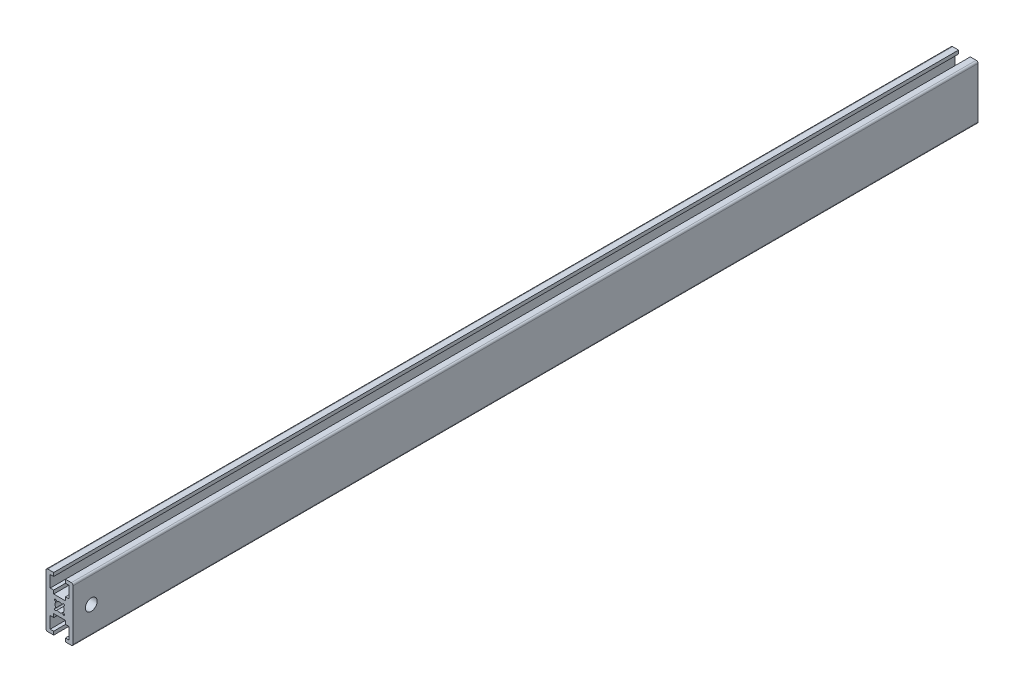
ISO-10303-21;
HEADER;
FILE_DESCRIPTION(('STEP AP214'),'2;1');
FILE_NAME('part.step','',(''),(''),'','','');
FILE_SCHEMA(('AUTOMOTIVE_DESIGN { 1 0 10303 214 1 1 1 1 }'));
ENDSEC;
DATA;
#1=APPLICATION_CONTEXT('core data for automotive mechanical design processes');
#2=APPLICATION_PROTOCOL_DEFINITION('international standard','automotive_design',2000,#1);
#3=PRODUCT_CONTEXT('',#1,'mechanical');
#4=PRODUCT('Part','Part','',(#3));
#5=PRODUCT_RELATED_PRODUCT_CATEGORY('part','',(#4));
#6=PRODUCT_DEFINITION_FORMATION('','',#4);
#7=PRODUCT_DEFINITION_CONTEXT('part definition',#1,'design');
#8=PRODUCT_DEFINITION('design','',#6,#7);
#9=PRODUCT_DEFINITION_SHAPE('','',#8);
#10=(LENGTH_UNIT() NAMED_UNIT(*) SI_UNIT(.MILLI.,.METRE.));
#11=(NAMED_UNIT(*) PLANE_ANGLE_UNIT() SI_UNIT($,.RADIAN.));
#12=(NAMED_UNIT(*) SI_UNIT($,.STERADIAN.) SOLID_ANGLE_UNIT());
#13=UNCERTAINTY_MEASURE_WITH_UNIT(LENGTH_MEASURE(1.E-05),#10,'distance_accuracy_value','');
#14=(GEOMETRIC_REPRESENTATION_CONTEXT(3) GLOBAL_UNCERTAINTY_ASSIGNED_CONTEXT((#13)) GLOBAL_UNIT_ASSIGNED_CONTEXT((#10,
#11,#12)) REPRESENTATION_CONTEXT('',''));
#15=CARTESIAN_POINT('',(0.,0.,0.));
#16=DIRECTION('',(0.,0.,1.));
#17=DIRECTION('',(1.,0.,0.));
#18=AXIS2_PLACEMENT_3D('',#15,#16,#17);
#19=CARTESIAN_POINT('',(0.,0.,250.));
#20=DIRECTION('',(0.,0.,-1.));
#21=DIRECTION('',(-1.,0.,0.));
#22=AXIS2_PLACEMENT_3D('',#19,#20,#21);
#23=CYLINDRICAL_SURFACE('',#22,2.5);
#24=CARTESIAN_POINT('',(0.,0.,250.));
#25=DIRECTION('',(0.,0.,-1.));
#26=DIRECTION('',(-1.,0.,0.));
#27=AXIS2_PLACEMENT_3D('',#24,#25,#26);
#28=CIRCLE('',#27,2.5);
#29=CARTESIAN_POINT('',(-2.08560419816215,-1.37849741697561,250.));
#30=VERTEX_POINT('',#29);
#31=CARTESIAN_POINT('',(-2.08560419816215,1.37849741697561,250.));
#32=VERTEX_POINT('',#31);
#33=EDGE_CURVE('E271',#30,#32,#28,.T.);
#34=ORIENTED_EDGE('',*,*,#33,.F.);
#35=DIRECTION('',(0.,0.,1.));
#36=VECTOR('',#35,1.);
#37=CARTESIAN_POINT('',(-2.08560419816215,-1.37849741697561,250.));
#38=LINE('',#37,#36);
#39=CARTESIAN_POINT('',(-2.08560419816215,-1.37849741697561,242.943169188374));
#40=VERTEX_POINT('',#39);
#41=EDGE_CURVE('E281',#40,#30,#38,.T.);
#42=ORIENTED_EDGE('',*,*,#41,.F.);
#43=CARTESIAN_POINT('',(-2.08560419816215,1.37849741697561,242.943169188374));
#44=CARTESIAN_POINT('',(-2.11783270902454,1.32972902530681,242.966010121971));
#45=CARTESIAN_POINT('',(-2.14852767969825,1.27957558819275,242.988021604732));
#46=CARTESIAN_POINT('',(-2.20663569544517,1.17654981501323,243.030071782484));
#47=CARTESIAN_POINT('',(-2.2340458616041,1.12367515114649,243.050108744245));
#48=CARTESIAN_POINT('',(-2.31120523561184,0.960629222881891,243.106919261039));
#49=CARTESIAN_POINT('',(-2.35555178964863,0.846531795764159,243.14015421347));
#50=CARTESIAN_POINT('',(-2.42692865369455,0.612195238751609,243.194048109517));
#51=CARTESIAN_POINT('',(-2.45421466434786,0.492077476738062,243.21489251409));
#52=CARTESIAN_POINT('',(-2.49071630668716,0.247961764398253,243.242842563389));
#53=CARTESIAN_POINT('',(-2.49999978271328,0.123980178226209,243.249999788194));
#54=CARTESIAN_POINT('',(-2.50000021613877,-0.123325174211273,243.250000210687));
#55=CARTESIAN_POINT('',(-2.49081500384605,-0.246648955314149,243.242918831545));
#56=CARTESIAN_POINT('',(-2.45469508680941,-0.489510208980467,243.215259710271));
#57=CARTESIAN_POINT('',(-2.42769385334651,-0.609031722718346,243.194631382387));
#58=CARTESIAN_POINT('',(-2.35666504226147,-0.843524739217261,243.140989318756));
#59=CARTESIAN_POINT('',(-2.31220783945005,-0.958293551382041,243.107663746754));
#60=CARTESIAN_POINT('',(-2.23475967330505,-1.12227261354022,243.050631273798));
#61=CARTESIAN_POINT('',(-2.20723137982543,-1.17544809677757,243.030504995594));
#62=CARTESIAN_POINT('',(-2.14885137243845,-1.27904636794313,242.988253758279));
#63=CARTESIAN_POINT('',(-2.11800264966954,-1.32947157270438,242.966130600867));
#64=CARTESIAN_POINT('',(-2.08560419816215,-1.3784974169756,242.943169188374));
#65=B_SPLINE_CURVE_WITH_KNOTS('',3,(#43,#44,#45,#46,#47,#48,#49,#50,#51,#52,#53,#54,#55,#56,#57,
#58,#59,#60,#61,#62,#63,#64),.UNSPECIFIED.,.F.,.F.,(4,2,2,2,2,2,2,2,2,2,4),(0.,
0.188202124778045,0.37656800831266,0.755206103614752,1.12802390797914,1.49943395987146,
1.86888180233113,2.23971710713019,2.62031747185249,2.80968066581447,2.99887468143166),.UNSPECIFIED.);
#66=CARTESIAN_POINT('',(-2.08560419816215,1.37849741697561,242.943169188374));
#67=VERTEX_POINT('',#66);
#68=EDGE_CURVE('E21',#67,#40,#65,.T.);
#69=ORIENTED_EDGE('',*,*,#68,.F.);
#70=DIRECTION('',(0.,0.,1.));
#71=VECTOR('',#70,1.);
#72=CARTESIAN_POINT('',(-2.08560419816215,1.37849741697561,250.));
#73=LINE('',#72,#71);
#74=EDGE_CURVE('E279',#32,#67,#73,.F.);
#75=ORIENTED_EDGE('',*,*,#74,.F.);
#76=EDGE_LOOP('',(#34,#42,#69,#75));
#77=FACE_BOUND('',#76,.T.);
#78=ADVANCED_FACE('F17',(#77),#23,.F.);
#79=CARTESIAN_POINT('',(0.,0.,250.));
#80=DIRECTION('',(0.,0.,-1.));
#81=DIRECTION('',(-1.,0.,0.));
#82=AXIS2_PLACEMENT_3D('',#79,#80,#81);
#83=CYLINDRICAL_SURFACE('',#82,2.5);
#84=CARTESIAN_POINT('',(-2.08560419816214,-1.37849741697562,237.056830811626));
#85=CARTESIAN_POINT('',(-2.11783270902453,-1.32972902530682,237.033989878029));
#86=CARTESIAN_POINT('',(-2.14852767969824,-1.27957558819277,237.011978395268));
#87=CARTESIAN_POINT('',(-2.20663569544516,-1.17654981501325,236.969928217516));
#88=CARTESIAN_POINT('',(-2.23404586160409,-1.12367515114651,236.949891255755));
#89=CARTESIAN_POINT('',(-2.31120523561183,-0.960629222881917,236.893080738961));
#90=CARTESIAN_POINT('',(-2.35555178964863,-0.846531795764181,236.85984578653));
#91=CARTESIAN_POINT('',(-2.42692865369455,-0.612195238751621,236.805951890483));
#92=CARTESIAN_POINT('',(-2.45421466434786,-0.492077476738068,236.78510748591));
#93=CARTESIAN_POINT('',(-2.49071630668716,-0.247961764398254,236.757157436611));
#94=CARTESIAN_POINT('',(-2.49999978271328,-0.123980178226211,236.750000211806));
#95=CARTESIAN_POINT('',(-2.50000021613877,0.123325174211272,236.749999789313));
#96=CARTESIAN_POINT('',(-2.49081500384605,0.246648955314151,236.757081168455));
#97=CARTESIAN_POINT('',(-2.4546950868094,0.48951020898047,236.784740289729));
#98=CARTESIAN_POINT('',(-2.42769385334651,0.609031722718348,236.805368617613));
#99=CARTESIAN_POINT('',(-2.35666504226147,0.843524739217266,236.859010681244));
#100=CARTESIAN_POINT('',(-2.31220783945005,0.958293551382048,236.892336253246));
#101=CARTESIAN_POINT('',(-2.23475967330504,1.12227261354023,236.949368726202));
#102=CARTESIAN_POINT('',(-2.20723137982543,1.17544809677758,236.969495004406));
#103=CARTESIAN_POINT('',(-2.14885137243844,1.27904636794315,237.011746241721));
#104=CARTESIAN_POINT('',(-2.11800264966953,1.3294715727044,237.033869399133));
#105=CARTESIAN_POINT('',(-2.08560419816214,1.37849741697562,237.056830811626));
#106=B_SPLINE_CURVE_WITH_KNOTS('',3,(#84,#85,#86,#87,#88,#89,#90,#91,#92,#93,#94,#95,#96,#97,
#98,#99,#100,#101,#102,#103,#104,#105),.UNSPECIFIED.,.F.,.F.,(4,2,2,2,2,2,2,2,2,2,4),(0.,
0.188202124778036,0.376568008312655,0.755206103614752,1.12802390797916,1.49943395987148,
1.86888180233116,2.23971710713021,2.62031747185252,2.80968066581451,2.99887468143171),.UNSPECIFIED.);
#107=CARTESIAN_POINT('',(-2.08560419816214,-1.37849741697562,237.056830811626));
#108=VERTEX_POINT('',#107);
#109=CARTESIAN_POINT('',(-2.08560419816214,1.37849741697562,237.056830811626));
#110=VERTEX_POINT('',#109);
#111=EDGE_CURVE('E298',#108,#110,#106,.T.);
#112=ORIENTED_EDGE('',*,*,#111,.F.);
#113=DIRECTION('',(0.,0.,1.));
#114=VECTOR('',#113,1.);
#115=CARTESIAN_POINT('',(-2.08560419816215,-1.37849741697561,250.));
#116=LINE('',#115,#114);
#117=CARTESIAN_POINT('',(-2.08560419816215,-1.37849741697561,-250.));
#118=VERTEX_POINT('',#117);
#119=EDGE_CURVE('E1154',#118,#108,#116,.T.);
#120=ORIENTED_EDGE('',*,*,#119,.F.);
#121=CARTESIAN_POINT('',(0.,0.,-250.));
#122=DIRECTION('',(0.,0.,-1.));
#123=DIRECTION('',(-1.,0.,0.));
#124=AXIS2_PLACEMENT_3D('',#121,#122,#123);
#125=CIRCLE('',#124,2.5);
#126=CARTESIAN_POINT('',(-2.08560419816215,1.37849741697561,-250.));
#127=VERTEX_POINT('',#126);
#128=EDGE_CURVE('E301',#127,#118,#125,.F.);
#129=ORIENTED_EDGE('',*,*,#128,.F.);
#130=DIRECTION('',(0.,0.,1.));
#131=VECTOR('',#130,1.);
#132=CARTESIAN_POINT('',(-2.08560419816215,1.37849741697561,250.));
#133=LINE('',#132,#131);
#134=EDGE_CURVE('E354',#110,#127,#133,.F.);
#135=ORIENTED_EDGE('',*,*,#134,.F.);
#136=EDGE_LOOP('',(#112,#120,#129,#135));
#137=FACE_BOUND('',#136,.T.);
#138=ADVANCED_FACE('F312',(#137),#83,.F.);
#139=CARTESIAN_POINT('',(-2.61629509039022,1.90918830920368,250.));
#140=DIRECTION('',(0.707106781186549,0.707106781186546,0.));
#141=DIRECTION('',(-0.707106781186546,0.707106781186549,0.));
#142=AXIS2_PLACEMENT_3D('',#139,#140,#141);
#143=PLANE('',#142);
#144=DIRECTION('',(-0.707106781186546,0.707106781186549,0.));
#145=VECTOR('',#144,1.);
#146=CARTESIAN_POINT('',(-2.61629509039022,1.90918830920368,250.));
#147=LINE('',#146,#145);
#148=CARTESIAN_POINT('',(-2.61629509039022,1.90918830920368,250.));
#149=VERTEX_POINT('',#148);
#150=EDGE_CURVE('E291',#149,#32,#147,.F.);
#151=ORIENTED_EDGE('',*,*,#150,.T.);
#152=ORIENTED_EDGE('',*,*,#74,.T.);
#153=CARTESIAN_POINT('',(-0.707106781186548,0.,240.));
#154=DIRECTION('',(0.707106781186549,0.707106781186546,0.));
#155=DIRECTION('',(0.707106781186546,-0.707106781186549,0.));
#156=AXIS2_PLACEMENT_3D('',#153,#154,#155);
#157=ELLIPSE('',#156,4.59619407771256,3.25000000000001);
#158=CARTESIAN_POINT('',(-2.61629509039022,1.90918830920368,242.630114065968));
#159=VERTEX_POINT('',#158);
#160=EDGE_CURVE('E289',#67,#159,#157,.F.);
#161=ORIENTED_EDGE('',*,*,#160,.T.);
#162=DIRECTION('',(0.,0.,-1.));
#163=VECTOR('',#162,1.);
#164=CARTESIAN_POINT('',(-2.61629509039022,1.90918830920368,250.));
#165=LINE('',#164,#163);
#166=EDGE_CURVE('E1152',#159,#149,#165,.F.);
#167=ORIENTED_EDGE('',*,*,#166,.T.);
#168=EDGE_LOOP('',(#151,#152,#161,#167));
#169=FACE_BOUND('',#168,.T.);
#170=ADVANCED_FACE('F287',(#169),#143,.T.);
#171=CARTESIAN_POINT('',(-2.61629509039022,-1.90918830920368,250.));
#172=DIRECTION('',(0.707106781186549,-0.707106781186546,0.));
#173=DIRECTION('',(0.707106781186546,0.707106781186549,0.));
#174=AXIS2_PLACEMENT_3D('',#171,#172,#173);
#175=PLANE('',#174);
#176=DIRECTION('',(0.707106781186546,0.707106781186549,0.));
#177=VECTOR('',#176,1.);
#178=CARTESIAN_POINT('',(-2.61629509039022,-1.90918830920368,250.));
#179=LINE('',#178,#177);
#180=CARTESIAN_POINT('',(-2.61629509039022,-1.90918830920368,250.));
#181=VERTEX_POINT('',#180);
#182=EDGE_CURVE('E355',#30,#181,#179,.F.);
#183=ORIENTED_EDGE('',*,*,#182,.T.);
#184=DIRECTION('',(0.,0.,-1.));
#185=VECTOR('',#184,1.);
#186=CARTESIAN_POINT('',(-2.61629509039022,-1.90918830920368,250.));
#187=LINE('',#186,#185);
#188=CARTESIAN_POINT('',(-2.61629509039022,-1.90918830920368,242.630114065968));
#189=VERTEX_POINT('',#188);
#190=EDGE_CURVE('E1150',#181,#189,#187,.T.);
#191=ORIENTED_EDGE('',*,*,#190,.T.);
#192=CARTESIAN_POINT('',(-0.707106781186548,0.,240.));
#193=DIRECTION('',(0.707106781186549,-0.707106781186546,0.));
#194=DIRECTION('',(0.707106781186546,0.707106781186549,0.));
#195=AXIS2_PLACEMENT_3D('',#192,#193,#194);
#196=ELLIPSE('',#195,4.59619407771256,3.25000000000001);
#197=EDGE_CURVE('E292',#189,#40,#196,.F.);
#198=ORIENTED_EDGE('',*,*,#197,.T.);
#199=ORIENTED_EDGE('',*,*,#41,.T.);
#200=EDGE_LOOP('',(#183,#191,#198,#199));
#201=FACE_BOUND('',#200,.T.);
#202=ADVANCED_FACE('F319',(#201),#175,.T.);
#203=CARTESIAN_POINT('',(-2.61629509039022,1.90918830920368,250.));
#204=DIRECTION('',(0.707106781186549,0.707106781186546,0.));
#205=DIRECTION('',(-0.707106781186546,0.707106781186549,0.));
#206=AXIS2_PLACEMENT_3D('',#203,#204,#205);
#207=PLANE('',#206);
#208=DIRECTION('',(-0.707106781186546,0.707106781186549,0.));
#209=VECTOR('',#208,1.);
#210=CARTESIAN_POINT('',(-2.61629509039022,1.90918830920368,-250.));
#211=LINE('',#210,#209);
#212=CARTESIAN_POINT('',(-2.61629509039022,1.90918830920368,-250.));
#213=VERTEX_POINT('',#212);
#214=EDGE_CURVE('E351',#127,#213,#211,.T.);
#215=ORIENTED_EDGE('',*,*,#214,.T.);
#216=DIRECTION('',(0.,0.,-1.));
#217=VECTOR('',#216,1.);
#218=CARTESIAN_POINT('',(-2.61629509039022,1.90918830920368,250.));
#219=LINE('',#218,#217);
#220=CARTESIAN_POINT('',(-2.61629509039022,1.90918830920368,237.369885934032));
#221=VERTEX_POINT('',#220);
#222=EDGE_CURVE('E1148',#213,#221,#219,.F.);
#223=ORIENTED_EDGE('',*,*,#222,.T.);
#224=CARTESIAN_POINT('',(-0.707106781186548,0.,240.));
#225=DIRECTION('',(0.707106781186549,0.707106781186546,0.));
#226=DIRECTION('',(0.707106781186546,-0.707106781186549,0.));
#227=AXIS2_PLACEMENT_3D('',#224,#225,#226);
#228=ELLIPSE('',#227,4.59619407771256,3.25000000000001);
#229=EDGE_CURVE('E352',#221,#110,#228,.F.);
#230=ORIENTED_EDGE('',*,*,#229,.T.);
#231=ORIENTED_EDGE('',*,*,#134,.T.);
#232=EDGE_LOOP('',(#215,#223,#230,#231));
#233=FACE_BOUND('',#232,.T.);
#234=ADVANCED_FACE('F322',(#233),#207,.T.);
#235=CARTESIAN_POINT('',(-2.61629509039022,-1.90918830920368,250.));
#236=DIRECTION('',(0.707106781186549,-0.707106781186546,0.));
#237=DIRECTION('',(0.707106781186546,0.707106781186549,0.));
#238=AXIS2_PLACEMENT_3D('',#235,#236,#237);
#239=PLANE('',#238);
#240=DIRECTION('',(0.707106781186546,0.707106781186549,0.));
#241=VECTOR('',#240,1.);
#242=CARTESIAN_POINT('',(-2.61629509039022,-1.90918830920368,-250.));
#243=LINE('',#242,#241);
#244=CARTESIAN_POINT('',(-2.61629509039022,-1.90918830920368,-250.));
#245=VERTEX_POINT('',#244);
#246=EDGE_CURVE('E350',#245,#118,#243,.T.);
#247=ORIENTED_EDGE('',*,*,#246,.T.);
#248=ORIENTED_EDGE('',*,*,#119,.T.);
#249=CARTESIAN_POINT('',(-0.707106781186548,0.,240.));
#250=DIRECTION('',(0.707106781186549,-0.707106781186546,0.));
#251=DIRECTION('',(0.707106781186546,0.707106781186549,0.));
#252=AXIS2_PLACEMENT_3D('',#249,#250,#251);
#253=ELLIPSE('',#252,4.59619407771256,3.25000000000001);
#254=CARTESIAN_POINT('',(-2.61629509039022,-1.90918830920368,237.369885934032));
#255=VERTEX_POINT('',#254);
#256=EDGE_CURVE('E348',#108,#255,#253,.F.);
#257=ORIENTED_EDGE('',*,*,#256,.T.);
#258=DIRECTION('',(0.,0.,-1.));
#259=VECTOR('',#258,1.);
#260=CARTESIAN_POINT('',(-2.61629509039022,-1.90918830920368,250.));
#261=LINE('',#260,#259);
#262=EDGE_CURVE('E346',#255,#245,#261,.T.);
#263=ORIENTED_EDGE('',*,*,#262,.T.);
#264=EDGE_LOOP('',(#247,#248,#257,#263));
#265=FACE_BOUND('',#264,.T.);
#266=ADVANCED_FACE('F326',(#265),#239,.T.);
#267=CARTESIAN_POINT('',(-2.26274169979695,2.26274169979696,250.));
#268=DIRECTION('',(0.,0.,-1.));
#269=DIRECTION('',(-1.,0.,0.));
#270=AXIS2_PLACEMENT_3D('',#267,#268,#269);
#271=CYLINDRICAL_SURFACE('',#270,0.5);
#272=CARTESIAN_POINT('',(-2.26274169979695,2.26274169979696,250.));
#273=DIRECTION('',(0.,0.,-1.));
#274=DIRECTION('',(-1.,0.,0.));
#275=AXIS2_PLACEMENT_3D('',#272,#273,#274);
#276=CIRCLE('',#275,0.5);
#277=CARTESIAN_POINT('',(-1.90918830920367,2.61629509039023,250.));
#278=VERTEX_POINT('',#277);
#279=EDGE_CURVE('E345',#149,#278,#276,.T.);
#280=ORIENTED_EDGE('',*,*,#279,.F.);
#281=ORIENTED_EDGE('',*,*,#166,.F.);
#282=CARTESIAN_POINT('',(-1.90918830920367,2.61629509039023,241.928081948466));
#283=CARTESIAN_POINT('',(-1.91987843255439,2.62697222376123,241.913597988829));
#284=CARTESIAN_POINT('',(-1.93118484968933,2.63732200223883,241.899297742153));
#285=CARTESIAN_POINT('',(-1.95523978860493,2.65731934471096,241.871215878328));
#286=CARTESIAN_POINT('',(-1.96799793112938,2.66696143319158,241.857438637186));
#287=CARTESIAN_POINT('',(-1.99534483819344,2.68556370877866,241.83044351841));
#288=CARTESIAN_POINT('',(-2.00997038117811,2.69450179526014,241.817247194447));
#289=CARTESIAN_POINT('',(-2.04092715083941,2.71119081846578,241.792252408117));
#290=CARTESIAN_POINT('',(-2.05725274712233,2.71894547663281,241.780449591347));
#291=CARTESIAN_POINT('',(-2.08860347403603,2.73168390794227,241.760827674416));
#292=CARTESIAN_POINT('',(-2.10331582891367,2.73691499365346,241.752675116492));
#293=CARTESIAN_POINT('',(-2.13391657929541,2.74612330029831,241.738211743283));
#294=CARTESIAN_POINT('',(-2.1497988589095,2.75010653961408,241.73189209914));
#295=CARTESIAN_POINT('',(-2.182847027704,2.75660757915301,241.721526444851));
#296=CARTESIAN_POINT('',(-2.20002737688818,2.75910482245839,241.7175123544));
#297=CARTESIAN_POINT('',(-2.2349894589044,2.76227807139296,241.712404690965));
#298=CARTESIAN_POINT('',(-2.25277072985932,2.7629554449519,241.711308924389));
#299=CARTESIAN_POINT('',(-2.28608393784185,2.76244071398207,241.712139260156));
#300=CARTESIAN_POINT('',(-2.30162942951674,2.76146345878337,241.713718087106));
#301=CARTESIAN_POINT('',(-2.33218553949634,2.75813475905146,241.719070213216));
#302=CARTESIAN_POINT('',(-2.34719569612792,2.75578215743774,241.72284536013));
#303=CARTESIAN_POINT('',(-2.38086269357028,2.74897875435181,241.733686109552));
#304=CARTESIAN_POINT('',(-2.39922006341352,2.74410503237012,241.741406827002));
#305=CARTESIAN_POINT('',(-2.43425062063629,2.73276884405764,241.759143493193));
#306=CARTESIAN_POINT('',(-2.45092003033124,2.72630292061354,241.769164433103));
#307=CARTESIAN_POINT('',(-2.49214296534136,2.70788155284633,241.797303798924));
#308=CARTESIAN_POINT('',(-2.51540651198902,2.69496378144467,241.816666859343));
#309=CARTESIAN_POINT('',(-2.55826686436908,2.66687346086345,241.857663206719));
#310=CARTESIAN_POINT('',(-2.57785301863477,2.6516945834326,241.879302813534));
#311=CARTESIAN_POINT('',(-2.62514864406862,2.60945320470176,241.937844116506));
#312=CARTESIAN_POINT('',(-2.65023788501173,2.5809128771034,241.975798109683));
#313=CARTESIAN_POINT('',(-2.69301606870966,2.52011488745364,242.052789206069));
#314=CARTESIAN_POINT('',(-2.71070143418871,2.48785543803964,242.091826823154));
#315=CARTESIAN_POINT('',(-2.73701329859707,2.42429305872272,242.165030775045));
#316=CARTESIAN_POINT('',(-2.7464815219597,2.39335325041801,242.199210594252));
#317=CARTESIAN_POINT('',(-2.75934517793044,2.32942945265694,242.266808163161));
#318=CARTESIAN_POINT('',(-2.76274278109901,2.2964461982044,242.300226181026));
#319=CARTESIAN_POINT('',(-2.76274072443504,2.23233938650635,242.362404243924));
#320=CARTESIAN_POINT('',(-2.75997441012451,2.20135023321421,242.391299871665));
#321=CARTESIAN_POINT('',(-2.74822194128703,2.13899737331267,242.447231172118));
#322=CARTESIAN_POINT('',(-2.73925515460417,2.10763513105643,242.474272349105));
#323=CARTESIAN_POINT('',(-2.71503189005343,2.04727073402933,242.524403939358));
#324=CARTESIAN_POINT('',(-2.70015636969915,2.01823486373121,242.54763087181));
#325=CARTESIAN_POINT('',(-2.66354392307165,1.96191140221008,242.59128312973));
#326=CARTESIAN_POINT('',(-2.64173715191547,1.93464516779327,242.611676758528));
#327=CARTESIAN_POINT('',(-2.61629509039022,1.90918830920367,242.630114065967));
#328=B_SPLINE_CURVE_WITH_KNOTS('',3,(#282,#283,#284,#285,#286,#287,#288,#289,#290,#291,#292,
#293,#294,#295,#296,#297,#298,#299,#300,#301,#302,#303,#304,#305,#306,#307,#308,#309,#310,#311,
#312,#313,#314,#315,#316,#317,#318,#319,#320,#321,#322,#323,#324,#325,#326,#327),.UNSPECIFIED.,
.F.,.F.,(4,2,2,2,2,2,2,2,2,2,2,2,2,2,2,2,2,2,2,2,2,2,4),(0.,0.0628086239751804,
0.126060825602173,0.190841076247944,0.255413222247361,0.308113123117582,0.360554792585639,
0.41370600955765,0.466817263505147,0.513546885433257,0.560315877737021,0.621479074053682,
0.682776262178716,0.780949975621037,0.879403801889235,1.03966994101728,1.20001342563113,
1.34080272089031,1.48154166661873,1.60849176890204,1.73504710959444,1.85450468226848,
1.97520634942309),.UNSPECIFIED.);
#329=CARTESIAN_POINT('',(-1.90918830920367,2.61629509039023,241.928081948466));
#330=VERTEX_POINT('',#329);
#331=EDGE_CURVE('E297',#330,#159,#328,.T.);
#332=ORIENTED_EDGE('',*,*,#331,.F.);
#333=DIRECTION('',(0.,0.,1.));
#334=VECTOR('',#333,1.);
#335=CARTESIAN_POINT('',(-1.90918830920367,2.61629509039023,250.));
#336=LINE('',#335,#334);
#337=EDGE_CURVE('E1140',#278,#330,#336,.F.);
#338=ORIENTED_EDGE('',*,*,#337,.F.);
#339=EDGE_LOOP('',(#280,#281,#332,#338));
#340=FACE_BOUND('',#339,.T.);
#341=ADVANCED_FACE('F330',(#340),#271,.F.);
#342=CARTESIAN_POINT('',(-2.26274169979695,-2.26274169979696,250.));
#343=DIRECTION('',(0.,0.,-1.));
#344=DIRECTION('',(-1.,0.,0.));
#345=AXIS2_PLACEMENT_3D('',#342,#343,#344);
#346=CYLINDRICAL_SURFACE('',#345,0.5);
#347=CARTESIAN_POINT('',(-2.26274169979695,-2.26274169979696,250.));
#348=DIRECTION('',(0.,0.,-1.));
#349=DIRECTION('',(-1.,0.,0.));
#350=AXIS2_PLACEMENT_3D('',#347,#348,#349);
#351=CIRCLE('',#350,0.5);
#352=CARTESIAN_POINT('',(-1.90918830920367,-2.61629509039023,250.));
#353=VERTEX_POINT('',#352);
#354=EDGE_CURVE('E1177',#353,#181,#351,.T.);
#355=ORIENTED_EDGE('',*,*,#354,.F.);
#356=DIRECTION('',(0.,0.,1.));
#357=VECTOR('',#356,1.);
#358=CARTESIAN_POINT('',(-1.90918830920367,-2.61629509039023,250.));
#359=LINE('',#358,#357);
#360=CARTESIAN_POINT('',(-1.90918830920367,-2.61629509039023,241.928081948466));
#361=VERTEX_POINT('',#360);
#362=EDGE_CURVE('E1121',#361,#353,#359,.T.);
#363=ORIENTED_EDGE('',*,*,#362,.F.);
#364=CARTESIAN_POINT('',(-2.61629509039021,-1.90918830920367,242.630114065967));
#365=CARTESIAN_POINT('',(-2.63874476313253,-1.93164468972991,242.613837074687));
#366=CARTESIAN_POINT('',(-2.65837850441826,-1.95553760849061,242.596032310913));
#367=CARTESIAN_POINT('',(-2.69215756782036,-2.00488989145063,242.55809367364));
#368=CARTESIAN_POINT('',(-2.7063479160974,-2.03033429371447,242.537980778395));
#369=CARTESIAN_POINT('',(-2.73358870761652,-2.0903494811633,242.488955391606));
#370=CARTESIAN_POINT('',(-2.74474150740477,-2.12517840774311,242.459319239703));
#371=CARTESIAN_POINT('',(-2.75933365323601,-2.19449391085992,242.397678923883));
#372=CARTESIAN_POINT('',(-2.76274083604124,-2.22897847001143,242.365665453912));
#373=CARTESIAN_POINT('',(-2.76274273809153,-2.30332745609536,242.293550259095));
#374=CARTESIAN_POINT('',(-2.75782174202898,-2.34287091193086,242.253121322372));
#375=CARTESIAN_POINT('',(-2.73934441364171,-2.41890180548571,242.171301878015));
#376=CARTESIAN_POINT('',(-2.72576956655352,-2.45538250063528,242.12990949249));
#377=CARTESIAN_POINT('',(-2.69014648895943,-2.52521661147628,242.046648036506));
#378=CARTESIAN_POINT('',(-2.66795226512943,-2.55850309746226,242.004783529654));
#379=CARTESIAN_POINT('',(-2.6280174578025,-2.60477032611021,241.943792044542));
#380=CARTESIAN_POINT('',(-2.61363264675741,-2.61955735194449,241.923799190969));
#381=CARTESIAN_POINT('',(-2.58243040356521,-2.64776358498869,241.884787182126));
#382=CARTESIAN_POINT('',(-2.56561643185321,-2.66118469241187,241.865766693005));
#383=CARTESIAN_POINT('',(-2.533362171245,-2.6835230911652,241.833439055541));
#384=CARTESIAN_POINT('',(-2.5184733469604,-2.69277196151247,241.819813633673));
#385=CARTESIAN_POINT('',(-2.48684344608,-2.71007106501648,241.793949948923));
#386=CARTESIAN_POINT('',(-2.47010066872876,-2.71812018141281,241.781712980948));
#387=CARTESIAN_POINT('',(-2.43436597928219,-2.73276679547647,241.759167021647));
#388=CARTESIAN_POINT('',(-2.41534566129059,-2.73934220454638,241.748887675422));
#389=CARTESIAN_POINT('',(-2.37532334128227,-2.75033859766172,241.731544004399));
#390=CARTESIAN_POINT('',(-2.35432935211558,-2.75476787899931,241.724467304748));
#391=CARTESIAN_POINT('',(-2.31800460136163,-2.75989928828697,241.71623750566));
#392=CARTESIAN_POINT('',(-2.30304494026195,-2.76134427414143,241.713907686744));
#393=CARTESIAN_POINT('',(-2.27287551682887,-2.76286636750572,241.711453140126));
#394=CARTESIAN_POINT('',(-2.25766589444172,-2.76294421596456,241.711327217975));
#395=CARTESIAN_POINT('',(-2.2274628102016,-2.761724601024,241.713294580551));
#396=CARTESIAN_POINT('',(-2.21246920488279,-2.76042809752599,241.715386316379));
#397=CARTESIAN_POINT('',(-2.18307957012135,-2.75657786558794,241.721566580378));
#398=CARTESIAN_POINT('',(-2.16868367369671,-2.75402385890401,241.725655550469));
#399=CARTESIAN_POINT('',(-2.13519629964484,-2.74661282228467,241.737435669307));
#400=CARTESIAN_POINT('',(-2.11649647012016,-2.74124457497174,241.745911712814));
#401=CARTESIAN_POINT('',(-2.08082637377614,-2.7288608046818,241.765205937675));
#402=CARTESIAN_POINT('',(-2.06386936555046,-2.72183382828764,241.776040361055));
#403=CARTESIAN_POINT('',(-2.01957351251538,-2.70074650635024,241.808052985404));
#404=CARTESIAN_POINT('',(-1.99404599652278,-2.68537769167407,241.830871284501));
#405=CARTESIAN_POINT('',(-1.95950739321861,-2.66053944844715,241.866611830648));
#406=CARTESIAN_POINT('',(-1.94872086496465,-2.652067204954,241.878634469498));
#407=CARTESIAN_POINT('',(-1.92820296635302,-2.63458010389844,241.903079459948));
#408=CARTESIAN_POINT('',(-1.91846784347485,-2.62556736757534,241.915500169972));
#409=CARTESIAN_POINT('',(-1.90918830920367,-2.61629509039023,241.928081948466));
#410=B_SPLINE_CURVE_WITH_KNOTS('',3,(#364,#365,#366,#367,#368,#369,#370,#371,#372,#373,#374,
#375,#376,#377,#378,#379,#380,#381,#382,#383,#384,#385,#386,#387,#388,#389,#390,#391,#392,#393,
#394,#395,#396,#397,#398,#399,#400,#401,#402,#403,#404,#405,#406,#407,#408,#409),.UNSPECIFIED.,
.F.,.F.,(4,2,2,2,2,2,2,2,2,2,2,2,2,2,2,2,2,2,2,2,2,2,4),(0.,0.106624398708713,0.212346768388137,
0.35271672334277,0.493668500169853,0.663102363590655,0.832899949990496,1.0057086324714,
1.09178221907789,1.17773437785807,1.24421824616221,1.31076361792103,1.37824809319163,
1.44546953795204,1.49089329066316,1.53629242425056,1.58165987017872,1.62703735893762,
1.69034087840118,1.75409499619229,1.86591511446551,1.92061053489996,1.97510380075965),.UNSPECIFIED.);
#411=EDGE_CURVE('E1179',#189,#361,#410,.T.);
#412=ORIENTED_EDGE('',*,*,#411,.F.);
#413=ORIENTED_EDGE('',*,*,#190,.F.);
#414=EDGE_LOOP('',(#355,#363,#412,#413));
#415=FACE_BOUND('',#414,.T.);
#416=ADVANCED_FACE('F335',(#415),#346,.F.);
#417=CARTESIAN_POINT('',(-2.26274169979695,2.26274169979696,250.));
#418=DIRECTION('',(0.,0.,-1.));
#419=DIRECTION('',(-1.,0.,0.));
#420=AXIS2_PLACEMENT_3D('',#417,#418,#419);
#421=CYLINDRICAL_SURFACE('',#420,0.5);
#422=CARTESIAN_POINT('',(-2.61629509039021,1.90918830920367,237.369885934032));
#423=CARTESIAN_POINT('',(-2.63874476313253,1.9316446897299,237.386162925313));
#424=CARTESIAN_POINT('',(-2.65837850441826,1.95553760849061,237.403967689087));
#425=CARTESIAN_POINT('',(-2.69215756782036,2.00488989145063,237.44190632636));
#426=CARTESIAN_POINT('',(-2.7063479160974,2.03033429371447,237.462019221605));
#427=CARTESIAN_POINT('',(-2.73358870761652,2.0903494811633,237.511044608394));
#428=CARTESIAN_POINT('',(-2.74474150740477,2.12517840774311,237.540680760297));
#429=CARTESIAN_POINT('',(-2.75933365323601,2.19449391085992,237.602321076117));
#430=CARTESIAN_POINT('',(-2.76274083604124,2.22897847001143,237.634334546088));
#431=CARTESIAN_POINT('',(-2.76274273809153,2.30332745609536,237.706449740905));
#432=CARTESIAN_POINT('',(-2.75782174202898,2.34287091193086,237.746878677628));
#433=CARTESIAN_POINT('',(-2.73934441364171,2.41890180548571,237.828698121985));
#434=CARTESIAN_POINT('',(-2.72576956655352,2.45538250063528,237.87009050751));
#435=CARTESIAN_POINT('',(-2.69014648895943,2.52521661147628,237.953351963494));
#436=CARTESIAN_POINT('',(-2.66795226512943,2.55850309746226,237.995216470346));
#437=CARTESIAN_POINT('',(-2.62801745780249,2.60477032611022,238.056207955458));
#438=CARTESIAN_POINT('',(-2.61363264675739,2.61955735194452,238.076200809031));
#439=CARTESIAN_POINT('',(-2.58243040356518,2.64776358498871,238.115212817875));
#440=CARTESIAN_POINT('',(-2.5656164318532,2.66118469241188,238.134233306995));
#441=CARTESIAN_POINT('',(-2.533362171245,2.6835230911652,238.166560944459));
#442=CARTESIAN_POINT('',(-2.5184733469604,2.69277196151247,238.180186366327));
#443=CARTESIAN_POINT('',(-2.48684344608,2.71007106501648,238.206050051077));
#444=CARTESIAN_POINT('',(-2.47010066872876,2.71812018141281,238.218287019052));
#445=CARTESIAN_POINT('',(-2.43436597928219,2.73276679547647,238.240832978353));
#446=CARTESIAN_POINT('',(-2.41534566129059,2.73934220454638,238.251112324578));
#447=CARTESIAN_POINT('',(-2.37532334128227,2.75033859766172,238.268455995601));
#448=CARTESIAN_POINT('',(-2.35432935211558,2.75476787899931,238.275532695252));
#449=CARTESIAN_POINT('',(-2.31800460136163,2.75989928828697,238.28376249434));
#450=CARTESIAN_POINT('',(-2.30304494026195,2.76134427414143,238.286092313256));
#451=CARTESIAN_POINT('',(-2.27287551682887,2.76286636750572,238.288546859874));
#452=CARTESIAN_POINT('',(-2.25766589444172,2.76294421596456,238.288672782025));
#453=CARTESIAN_POINT('',(-2.2274628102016,2.761724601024,238.286705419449));
#454=CARTESIAN_POINT('',(-2.21246920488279,2.76042809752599,238.284613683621));
#455=CARTESIAN_POINT('',(-2.18307957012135,2.75657786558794,238.278433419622));
#456=CARTESIAN_POINT('',(-2.16868367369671,2.75402385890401,238.274344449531));
#457=CARTESIAN_POINT('',(-2.13519629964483,2.74661282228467,238.262564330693));
#458=CARTESIAN_POINT('',(-2.11649647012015,2.74124457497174,238.254088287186));
#459=CARTESIAN_POINT('',(-2.08082637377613,2.7288608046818,238.234794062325));
#460=CARTESIAN_POINT('',(-2.06386936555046,2.72183382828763,238.223959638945));
#461=CARTESIAN_POINT('',(-2.01957351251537,2.70074650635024,238.191947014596));
#462=CARTESIAN_POINT('',(-1.99404599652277,2.68537769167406,238.169128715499));
#463=CARTESIAN_POINT('',(-1.95950739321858,2.66053944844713,238.133388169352));
#464=CARTESIAN_POINT('',(-1.94872086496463,2.65206720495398,238.121365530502));
#465=CARTESIAN_POINT('',(-1.92820296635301,2.63458010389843,238.096920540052));
#466=CARTESIAN_POINT('',(-1.91846784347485,2.62556736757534,238.084499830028));
#467=CARTESIAN_POINT('',(-1.90918830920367,2.61629509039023,238.071918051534));
#468=B_SPLINE_CURVE_WITH_KNOTS('',3,(#422,#423,#424,#425,#426,#427,#428,#429,#430,#431,#432,
#433,#434,#435,#436,#437,#438,#439,#440,#441,#442,#443,#444,#445,#446,#447,#448,#449,#450,#451,
#452,#453,#454,#455,#456,#457,#458,#459,#460,#461,#462,#463,#464,#465,#466,#467),.UNSPECIFIED.,
.F.,.F.,(4,2,2,2,2,2,2,2,2,2,2,2,2,2,2,2,2,2,2,2,2,2,4),(0.,0.106624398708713,0.212346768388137,
0.35271672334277,0.493668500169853,0.663102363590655,0.832899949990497,1.0057086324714,
1.09178221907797,1.17773437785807,1.24421824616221,1.31076361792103,1.37824809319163,
1.44546953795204,1.49089329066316,1.53629242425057,1.58165987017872,1.62703735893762,
1.6903408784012,1.75409499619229,1.86591511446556,1.9206105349,1.97510380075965),.UNSPECIFIED.);
#469=CARTESIAN_POINT('',(-1.90918830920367,2.61629509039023,238.071918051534));
#470=VERTEX_POINT('',#469);
#471=EDGE_CURVE('E1166',#221,#470,#468,.T.);
#472=ORIENTED_EDGE('',*,*,#471,.F.);
#473=ORIENTED_EDGE('',*,*,#222,.F.);
#474=CARTESIAN_POINT('',(-2.26274169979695,2.26274169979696,-250.));
#475=DIRECTION('',(0.,0.,-1.));
#476=DIRECTION('',(-1.,0.,0.));
#477=AXIS2_PLACEMENT_3D('',#474,#475,#476);
#478=CIRCLE('',#477,0.5);
#479=CARTESIAN_POINT('',(-1.90918830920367,2.61629509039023,-250.));
#480=VERTEX_POINT('',#479);
#481=EDGE_CURVE('E1164',#480,#213,#478,.F.);
#482=ORIENTED_EDGE('',*,*,#481,.F.);
#483=DIRECTION('',(0.,0.,1.));
#484=VECTOR('',#483,1.);
#485=CARTESIAN_POINT('',(-1.90918830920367,2.61629509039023,250.));
#486=LINE('',#485,#484);
#487=EDGE_CURVE('E1111',#470,#480,#486,.F.);
#488=ORIENTED_EDGE('',*,*,#487,.F.);
#489=EDGE_LOOP('',(#472,#473,#482,#488));
#490=FACE_BOUND('',#489,.T.);
#491=ADVANCED_FACE('F1162',(#490),#421,.F.);
#492=CARTESIAN_POINT('',(-2.26274169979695,-2.26274169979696,250.));
#493=DIRECTION('',(0.,0.,-1.));
#494=DIRECTION('',(-1.,0.,0.));
#495=AXIS2_PLACEMENT_3D('',#492,#493,#494);
#496=CYLINDRICAL_SURFACE('',#495,0.5);
#497=CARTESIAN_POINT('',(-1.90918830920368,-2.61629509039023,238.071918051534));
#498=CARTESIAN_POINT('',(-1.91987843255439,-2.62697222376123,238.086402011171));
#499=CARTESIAN_POINT('',(-1.93118484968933,-2.63732200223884,238.100702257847));
#500=CARTESIAN_POINT('',(-1.95523978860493,-2.65731934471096,238.128784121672));
#501=CARTESIAN_POINT('',(-1.96799793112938,-2.66696143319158,238.142561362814));
#502=CARTESIAN_POINT('',(-1.99534483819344,-2.68556370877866,238.16955648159));
#503=CARTESIAN_POINT('',(-2.00997038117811,-2.69450179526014,238.182752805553));
#504=CARTESIAN_POINT('',(-2.04092715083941,-2.71119081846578,238.207747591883));
#505=CARTESIAN_POINT('',(-2.05725274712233,-2.71894547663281,238.219550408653));
#506=CARTESIAN_POINT('',(-2.08860347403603,-2.73168390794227,238.239172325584));
#507=CARTESIAN_POINT('',(-2.10331582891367,-2.73691499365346,238.247324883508));
#508=CARTESIAN_POINT('',(-2.13391657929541,-2.74612330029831,238.261788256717));
#509=CARTESIAN_POINT('',(-2.1497988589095,-2.75010653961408,238.26810790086));
#510=CARTESIAN_POINT('',(-2.182847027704,-2.75660757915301,238.278473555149));
#511=CARTESIAN_POINT('',(-2.20002737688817,-2.75910482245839,238.2824876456));
#512=CARTESIAN_POINT('',(-2.23498945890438,-2.76227807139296,238.287595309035));
#513=CARTESIAN_POINT('',(-2.25277072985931,-2.7629554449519,238.288691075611));
#514=CARTESIAN_POINT('',(-2.28608393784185,-2.76244071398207,238.287860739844));
#515=CARTESIAN_POINT('',(-2.30162942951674,-2.76146345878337,238.286281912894));
#516=CARTESIAN_POINT('',(-2.33218553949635,-2.75813475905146,238.280929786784));
#517=CARTESIAN_POINT('',(-2.34719569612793,-2.75578215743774,238.27715463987));
#518=CARTESIAN_POINT('',(-2.38086269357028,-2.74897875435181,238.266313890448));
#519=CARTESIAN_POINT('',(-2.39922006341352,-2.74410503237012,238.258593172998));
#520=CARTESIAN_POINT('',(-2.4342506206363,-2.73276884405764,238.240856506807));
#521=CARTESIAN_POINT('',(-2.45092003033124,-2.72630292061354,238.230835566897));
#522=CARTESIAN_POINT('',(-2.49214296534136,-2.70788155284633,238.202696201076));
#523=CARTESIAN_POINT('',(-2.51540651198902,-2.69496378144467,238.183333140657));
#524=CARTESIAN_POINT('',(-2.55826686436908,-2.66687346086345,238.142336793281));
#525=CARTESIAN_POINT('',(-2.57785301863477,-2.6516945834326,238.120697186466));
#526=CARTESIAN_POINT('',(-2.62514864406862,-2.60945320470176,238.062155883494));
#527=CARTESIAN_POINT('',(-2.65023788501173,-2.58091287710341,238.024201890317));
#528=CARTESIAN_POINT('',(-2.69301606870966,-2.52011488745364,237.947210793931));
#529=CARTESIAN_POINT('',(-2.71070143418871,-2.48785543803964,237.908173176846));
#530=CARTESIAN_POINT('',(-2.73701329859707,-2.42429305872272,237.834969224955));
#531=CARTESIAN_POINT('',(-2.7464815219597,-2.39335325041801,237.800789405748));
#532=CARTESIAN_POINT('',(-2.75934517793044,-2.32942945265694,237.733191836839));
#533=CARTESIAN_POINT('',(-2.76274278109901,-2.2964461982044,237.699773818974));
#534=CARTESIAN_POINT('',(-2.76274072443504,-2.23233938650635,237.637595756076));
#535=CARTESIAN_POINT('',(-2.75997441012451,-2.20135023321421,237.608700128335));
#536=CARTESIAN_POINT('',(-2.74822194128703,-2.13899737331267,237.552768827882));
#537=CARTESIAN_POINT('',(-2.73925515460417,-2.10763513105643,237.525727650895));
#538=CARTESIAN_POINT('',(-2.71503189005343,-2.04727073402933,237.475596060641));
#539=CARTESIAN_POINT('',(-2.70015636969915,-2.01823486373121,237.45236912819));
#540=CARTESIAN_POINT('',(-2.66354392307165,-1.96191140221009,237.40871687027));
#541=CARTESIAN_POINT('',(-2.64173715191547,-1.93464516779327,237.388323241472));
#542=CARTESIAN_POINT('',(-2.61629509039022,-1.90918830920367,237.369885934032));
#543=B_SPLINE_CURVE_WITH_KNOTS('',3,(#497,#498,#499,#500,#501,#502,#503,#504,#505,#506,#507,
#508,#509,#510,#511,#512,#513,#514,#515,#516,#517,#518,#519,#520,#521,#522,#523,#524,#525,#526,
#527,#528,#529,#530,#531,#532,#533,#534,#535,#536,#537,#538,#539,#540,#541,#542),.UNSPECIFIED.,
.F.,.F.,(4,2,2,2,2,2,2,2,2,2,2,2,2,2,2,2,2,2,2,2,2,2,4),(0.,0.0628086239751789,
0.126060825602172,0.190841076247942,0.255413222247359,0.308113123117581,0.360554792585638,
0.413706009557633,0.466817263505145,0.513546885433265,0.560315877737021,0.621479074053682,
0.682776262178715,0.780949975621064,0.879403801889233,1.03966994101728,1.20001342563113,
1.34080272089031,1.48154166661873,1.60849176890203,1.73504710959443,1.85450468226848,
1.97520634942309),.UNSPECIFIED.);
#544=CARTESIAN_POINT('',(-1.90918830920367,-2.61629509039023,238.071918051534));
#545=VERTEX_POINT('',#544);
#546=EDGE_CURVE('E1198',#545,#255,#543,.T.);
#547=ORIENTED_EDGE('',*,*,#546,.F.);
#548=DIRECTION('',(0.,0.,1.));
#549=VECTOR('',#548,1.);
#550=CARTESIAN_POINT('',(-1.90918830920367,-2.61629509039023,250.));
#551=LINE('',#550,#549);
#552=CARTESIAN_POINT('',(-1.90918830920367,-2.61629509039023,-250.));
#553=VERTEX_POINT('',#552);
#554=EDGE_CURVE('E1098',#553,#545,#551,.T.);
#555=ORIENTED_EDGE('',*,*,#554,.F.);
#556=CARTESIAN_POINT('',(-2.26274169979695,-2.26274169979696,-250.));
#557=DIRECTION('',(0.,0.,-1.));
#558=DIRECTION('',(-1.,0.,0.));
#559=AXIS2_PLACEMENT_3D('',#556,#557,#558);
#560=CIRCLE('',#559,0.5);
#561=EDGE_CURVE('E1168',#245,#553,#560,.F.);
#562=ORIENTED_EDGE('',*,*,#561,.F.);
#563=ORIENTED_EDGE('',*,*,#262,.F.);
#564=EDGE_LOOP('',(#547,#555,#562,#563));
#565=FACE_BOUND('',#564,.T.);
#566=ADVANCED_FACE('F1207',(#565),#496,.F.);
#567=CARTESIAN_POINT('',(-1.90918830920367,2.61629509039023,250.));
#568=DIRECTION('',(-0.707106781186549,-0.707106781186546,0.));
#569=DIRECTION('',(0.707106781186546,-0.707106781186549,0.));
#570=AXIS2_PLACEMENT_3D('',#567,#568,#569);
#571=PLANE('',#570);
#572=DIRECTION('',(0.707106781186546,-0.707106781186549,0.));
#573=VECTOR('',#572,1.);
#574=CARTESIAN_POINT('',(-1.90918830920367,2.61629509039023,250.));
#575=LINE('',#574,#573);
#576=CARTESIAN_POINT('',(-1.3784974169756,2.08560419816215,250.));
#577=VERTEX_POINT('',#576);
#578=EDGE_CURVE('E1143',#577,#278,#575,.F.);
#579=ORIENTED_EDGE('',*,*,#578,.T.);
#580=ORIENTED_EDGE('',*,*,#337,.T.);
#581=CARTESIAN_POINT('',(0.707106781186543,0.,240.));
#582=DIRECTION('',(-0.707106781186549,-0.707106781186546,0.));
#583=DIRECTION('',(0.707106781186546,-0.707106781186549,0.));
#584=AXIS2_PLACEMENT_3D('',#581,#582,#583);
#585=ELLIPSE('',#584,4.59619407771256,3.25000000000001);
#586=CARTESIAN_POINT('',(-1.3784974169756,2.08560419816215,242.492539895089));
#587=VERTEX_POINT('',#586);
#588=EDGE_CURVE('E1145',#330,#587,#585,.F.);
#589=ORIENTED_EDGE('',*,*,#588,.T.);
#590=DIRECTION('',(0.,0.,-1.));
#591=VECTOR('',#590,1.);
#592=CARTESIAN_POINT('',(-1.3784974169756,2.08560419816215,250.));
#593=LINE('',#592,#591);
#594=EDGE_CURVE('E957',#587,#577,#593,.F.);
#595=ORIENTED_EDGE('',*,*,#594,.T.);
#596=EDGE_LOOP('',(#579,#580,#589,#595));
#597=FACE_BOUND('',#596,.T.);
#598=ADVANCED_FACE('F1194',(#597),#571,.T.);
#599=CARTESIAN_POINT('',(1.90918830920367,2.61629509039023,250.));
#600=DIRECTION('',(0.70710678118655,-0.707106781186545,0.));
#601=DIRECTION('',(0.707106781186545,0.70710678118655,0.));
#602=AXIS2_PLACEMENT_3D('',#599,#600,#601);
#603=PLANE('',#602);
#604=DIRECTION('',(0.707106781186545,0.70710678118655,0.));
#605=VECTOR('',#604,1.);
#606=CARTESIAN_POINT('',(1.90918830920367,2.61629509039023,250.));
#607=LINE('',#606,#605);
#608=CARTESIAN_POINT('',(1.90918830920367,2.61629509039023,250.));
#609=VERTEX_POINT('',#608);
#610=CARTESIAN_POINT('',(1.3784974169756,2.08560419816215,250.));
#611=VERTEX_POINT('',#610);
#612=EDGE_CURVE('E1137',#609,#611,#607,.F.);
#613=ORIENTED_EDGE('',*,*,#612,.T.);
#614=DIRECTION('',(0.,0.,-1.));
#615=VECTOR('',#614,1.);
#616=CARTESIAN_POINT('',(1.3784974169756,2.08560419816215,250.));
#617=LINE('',#616,#615);
#618=CARTESIAN_POINT('',(1.3784974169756,2.08560419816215,242.492539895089));
#619=VERTEX_POINT('',#618);
#620=EDGE_CURVE('E954',#611,#619,#617,.T.);
#621=ORIENTED_EDGE('',*,*,#620,.T.);
#622=CARTESIAN_POINT('',(-0.70710678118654,0.,240.));
#623=DIRECTION('',(0.70710678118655,-0.707106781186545,0.));
#624=DIRECTION('',(0.707106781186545,0.70710678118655,0.));
#625=AXIS2_PLACEMENT_3D('',#622,#623,#624);
#626=ELLIPSE('',#625,4.59619407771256,3.25000000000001);
#627=CARTESIAN_POINT('',(1.90918830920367,2.61629509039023,241.928081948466));
#628=VERTEX_POINT('',#627);
#629=EDGE_CURVE('E1139',#619,#628,#626,.F.);
#630=ORIENTED_EDGE('',*,*,#629,.T.);
#631=DIRECTION('',(0.,0.,-1.));
#632=VECTOR('',#631,1.);
#633=CARTESIAN_POINT('',(1.90918830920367,2.61629509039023,250.));
#634=LINE('',#633,#632);
#635=EDGE_CURVE('E1077',#628,#609,#634,.F.);
#636=ORIENTED_EDGE('',*,*,#635,.T.);
#637=EDGE_LOOP('',(#613,#621,#630,#636));
#638=FACE_BOUND('',#637,.T.);
#639=ADVANCED_FACE('F1253',(#638),#603,.T.);
#640=CARTESIAN_POINT('',(2.61629509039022,1.90918830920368,250.));
#641=DIRECTION('',(-0.707106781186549,0.707106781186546,0.));
#642=DIRECTION('',(-0.707106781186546,-0.707106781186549,0.));
#643=AXIS2_PLACEMENT_3D('',#640,#641,#642);
#644=PLANE('',#643);
#645=DIRECTION('',(-0.707106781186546,-0.707106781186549,0.));
#646=VECTOR('',#645,1.);
#647=CARTESIAN_POINT('',(2.61629509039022,1.90918830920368,250.));
#648=LINE('',#647,#646);
#649=CARTESIAN_POINT('',(2.08560419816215,1.37849741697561,250.));
#650=VERTEX_POINT('',#649);
#651=CARTESIAN_POINT('',(2.61629509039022,1.90918830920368,250.));
#652=VERTEX_POINT('',#651);
#653=EDGE_CURVE('E1134',#650,#652,#648,.F.);
#654=ORIENTED_EDGE('',*,*,#653,.T.);
#655=DIRECTION('',(0.,0.,-1.));
#656=VECTOR('',#655,1.);
#657=CARTESIAN_POINT('',(2.61629509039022,1.90918830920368,250.));
#658=LINE('',#657,#656);
#659=CARTESIAN_POINT('',(2.61629509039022,1.90918830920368,242.630114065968));
#660=VERTEX_POINT('',#659);
#661=EDGE_CURVE('E1073',#652,#660,#658,.T.);
#662=ORIENTED_EDGE('',*,*,#661,.T.);
#663=CARTESIAN_POINT('',(0.707106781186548,0.,240.));
#664=DIRECTION('',(-0.707106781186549,0.707106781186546,0.));
#665=DIRECTION('',(0.707106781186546,0.707106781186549,0.));
#666=AXIS2_PLACEMENT_3D('',#663,#664,#665);
#667=ELLIPSE('',#666,4.59619407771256,3.25000000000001);
#668=CARTESIAN_POINT('',(2.08560419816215,1.37849741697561,242.943169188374));
#669=VERTEX_POINT('',#668);
#670=EDGE_CURVE('E1136',#660,#669,#667,.F.);
#671=ORIENTED_EDGE('',*,*,#670,.T.);
#672=DIRECTION('',(0.,0.,-1.));
#673=VECTOR('',#672,1.);
#674=CARTESIAN_POINT('',(2.08560419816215,1.37849741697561,250.));
#675=LINE('',#674,#673);
#676=EDGE_CURVE('E951',#669,#650,#675,.F.);
#677=ORIENTED_EDGE('',*,*,#676,.T.);
#678=EDGE_LOOP('',(#654,#662,#671,#677));
#679=FACE_BOUND('',#678,.T.);
#680=ADVANCED_FACE('F1237',(#679),#644,.T.);
#681=CARTESIAN_POINT('',(2.61629509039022,-1.90918830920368,250.));
#682=DIRECTION('',(-0.707106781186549,-0.707106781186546,0.));
#683=DIRECTION('',(0.707106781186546,-0.707106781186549,0.));
#684=AXIS2_PLACEMENT_3D('',#681,#682,#683);
#685=PLANE('',#684);
#686=DIRECTION('',(0.707106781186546,-0.707106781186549,0.));
#687=VECTOR('',#686,1.);
#688=CARTESIAN_POINT('',(2.61629509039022,-1.90918830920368,250.));
#689=LINE('',#688,#687);
#690=CARTESIAN_POINT('',(2.61629509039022,-1.90918830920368,250.));
#691=VERTEX_POINT('',#690);
#692=CARTESIAN_POINT('',(2.08560419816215,-1.37849741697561,250.));
#693=VERTEX_POINT('',#692);
#694=EDGE_CURVE('E1131',#691,#693,#689,.F.);
#695=ORIENTED_EDGE('',*,*,#694,.T.);
#696=DIRECTION('',(0.,0.,-1.));
#697=VECTOR('',#696,1.);
#698=CARTESIAN_POINT('',(2.08560419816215,-1.37849741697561,250.));
#699=LINE('',#698,#697);
#700=CARTESIAN_POINT('',(2.08560419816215,-1.37849741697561,242.943169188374));
#701=VERTEX_POINT('',#700);
#702=EDGE_CURVE('E948',#693,#701,#699,.T.);
#703=ORIENTED_EDGE('',*,*,#702,.T.);
#704=CARTESIAN_POINT('',(0.707106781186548,0.,240.));
#705=DIRECTION('',(-0.707106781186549,-0.707106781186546,0.));
#706=DIRECTION('',(0.707106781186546,-0.707106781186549,0.));
#707=AXIS2_PLACEMENT_3D('',#704,#705,#706);
#708=ELLIPSE('',#707,4.59619407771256,3.25000000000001);
#709=CARTESIAN_POINT('',(2.61629509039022,-1.90918830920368,242.630114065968));
#710=VERTEX_POINT('',#709);
#711=EDGE_CURVE('E1133',#701,#710,#708,.F.);
#712=ORIENTED_EDGE('',*,*,#711,.T.);
#713=DIRECTION('',(0.,0.,-1.));
#714=VECTOR('',#713,1.);
#715=CARTESIAN_POINT('',(2.61629509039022,-1.90918830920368,250.));
#716=LINE('',#715,#714);
#717=EDGE_CURVE('E1070',#710,#691,#716,.F.);
#718=ORIENTED_EDGE('',*,*,#717,.T.);
#719=EDGE_LOOP('',(#695,#703,#712,#718));
#720=FACE_BOUND('',#719,.T.);
#721=ADVANCED_FACE('F1246',(#720),#685,.T.);
#722=CARTESIAN_POINT('',(1.90918830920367,-2.61629509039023,250.));
#723=DIRECTION('',(0.707106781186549,0.707106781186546,0.));
#724=DIRECTION('',(-0.707106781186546,0.707106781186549,0.));
#725=AXIS2_PLACEMENT_3D('',#722,#723,#724);
#726=PLANE('',#725);
#727=DIRECTION('',(-0.707106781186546,0.707106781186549,0.));
#728=VECTOR('',#727,1.);
#729=CARTESIAN_POINT('',(1.90918830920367,-2.61629509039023,250.));
#730=LINE('',#729,#728);
#731=CARTESIAN_POINT('',(1.3784974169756,-2.08560419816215,250.));
#732=VERTEX_POINT('',#731);
#733=CARTESIAN_POINT('',(1.90918830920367,-2.61629509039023,250.));
#734=VERTEX_POINT('',#733);
#735=EDGE_CURVE('E1128',#732,#734,#730,.F.);
#736=ORIENTED_EDGE('',*,*,#735,.T.);
#737=DIRECTION('',(0.,0.,-1.));
#738=VECTOR('',#737,1.);
#739=CARTESIAN_POINT('',(1.90918830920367,-2.61629509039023,250.));
#740=LINE('',#739,#738);
#741=CARTESIAN_POINT('',(1.90918830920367,-2.61629509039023,241.928081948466));
#742=VERTEX_POINT('',#741);
#743=EDGE_CURVE('E960',#734,#742,#740,.T.);
#744=ORIENTED_EDGE('',*,*,#743,.T.);
#745=CARTESIAN_POINT('',(-0.707106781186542,0.,240.));
#746=DIRECTION('',(0.707106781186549,0.707106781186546,0.));
#747=DIRECTION('',(0.707106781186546,-0.707106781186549,0.));
#748=AXIS2_PLACEMENT_3D('',#745,#746,#747);
#749=ELLIPSE('',#748,4.59619407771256,3.25000000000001);
#750=CARTESIAN_POINT('',(1.3784974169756,-2.08560419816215,242.492539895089));
#751=VERTEX_POINT('',#750);
#752=EDGE_CURVE('E1130',#742,#751,#749,.F.);
#753=ORIENTED_EDGE('',*,*,#752,.T.);
#754=DIRECTION('',(0.,0.,-1.));
#755=VECTOR('',#754,1.);
#756=CARTESIAN_POINT('',(1.3784974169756,-2.08560419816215,250.));
#757=LINE('',#756,#755);
#758=EDGE_CURVE('E945',#751,#732,#757,.F.);
#759=ORIENTED_EDGE('',*,*,#758,.T.);
#760=EDGE_LOOP('',(#736,#744,#753,#759));
#761=FACE_BOUND('',#760,.T.);
#762=ADVANCED_FACE('F1530',(#761),#726,.T.);
#763=CARTESIAN_POINT('',(-1.90918830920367,-2.61629509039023,250.));
#764=DIRECTION('',(-0.707106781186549,0.707106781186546,0.));
#765=DIRECTION('',(-0.707106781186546,-0.707106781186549,0.));
#766=AXIS2_PLACEMENT_3D('',#763,#764,#765);
#767=PLANE('',#766);
#768=DIRECTION('',(-0.707106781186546,-0.707106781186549,0.));
#769=VECTOR('',#768,1.);
#770=CARTESIAN_POINT('',(-1.90918830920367,-2.61629509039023,250.));
#771=LINE('',#770,#769);
#772=CARTESIAN_POINT('',(-1.3784974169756,-2.08560419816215,250.));
#773=VERTEX_POINT('',#772);
#774=EDGE_CURVE('E1124',#353,#773,#771,.F.);
#775=ORIENTED_EDGE('',*,*,#774,.T.);
#776=DIRECTION('',(0.,0.,-1.));
#777=VECTOR('',#776,1.);
#778=CARTESIAN_POINT('',(-1.3784974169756,-2.08560419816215,250.));
#779=LINE('',#778,#777);
#780=CARTESIAN_POINT('',(-1.3784974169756,-2.08560419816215,242.492539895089));
#781=VERTEX_POINT('',#780);
#782=EDGE_CURVE('E940',#773,#781,#779,.T.);
#783=ORIENTED_EDGE('',*,*,#782,.T.);
#784=CARTESIAN_POINT('',(0.707106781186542,0.,240.));
#785=DIRECTION('',(-0.707106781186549,0.707106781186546,0.));
#786=DIRECTION('',(0.707106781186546,0.707106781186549,0.));
#787=AXIS2_PLACEMENT_3D('',#784,#785,#786);
#788=ELLIPSE('',#787,4.59619407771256,3.25000000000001);
#789=EDGE_CURVE('E1125',#781,#361,#788,.F.);
#790=ORIENTED_EDGE('',*,*,#789,.T.);
#791=ORIENTED_EDGE('',*,*,#362,.T.);
#792=EDGE_LOOP('',(#775,#783,#790,#791));
#793=FACE_BOUND('',#792,.T.);
#794=ADVANCED_FACE('F1223',(#793),#767,.T.);
#795=CARTESIAN_POINT('',(6.5,-14.,250.));
#796=DIRECTION('',(0.,0.,-1.));
#797=DIRECTION('',(-1.,0.,0.));
#798=AXIS2_PLACEMENT_3D('',#795,#796,#797);
#799=CYLINDRICAL_SURFACE('',#798,1.);
#800=CARTESIAN_POINT('',(6.5,-14.,-250.));
#801=DIRECTION('',(0.,0.,-1.));
#802=DIRECTION('',(-1.,0.,0.));
#803=AXIS2_PLACEMENT_3D('',#800,#801,#802);
#804=CIRCLE('',#803,1.);
#805=CARTESIAN_POINT('',(6.5,-15.,-250.));
#806=VERTEX_POINT('',#805);
#807=CARTESIAN_POINT('',(7.5,-14.,-250.));
#808=VERTEX_POINT('',#807);
#809=EDGE_CURVE('E1415',#806,#808,#804,.F.);
#810=ORIENTED_EDGE('',*,*,#809,.T.);
#811=DIRECTION('',(0.,0.,1.));
#812=VECTOR('',#811,1.);
#813=CARTESIAN_POINT('',(7.5,-14.,250.));
#814=LINE('',#813,#812);
#815=CARTESIAN_POINT('',(7.5,-14.,250.));
#816=VERTEX_POINT('',#815);
#817=EDGE_CURVE('E830',#808,#816,#814,.T.);
#818=ORIENTED_EDGE('',*,*,#817,.T.);
#819=CARTESIAN_POINT('',(6.5,-14.,250.));
#820=DIRECTION('',(0.,0.,-1.));
#821=DIRECTION('',(-1.,0.,0.));
#822=AXIS2_PLACEMENT_3D('',#819,#820,#821);
#823=CIRCLE('',#822,1.);
#824=CARTESIAN_POINT('',(6.5,-15.,250.));
#825=VERTEX_POINT('',#824);
#826=EDGE_CURVE('E1127',#816,#825,#823,.T.);
#827=ORIENTED_EDGE('',*,*,#826,.T.);
#828=DIRECTION('',(0.,0.,1.));
#829=VECTOR('',#828,1.);
#830=CARTESIAN_POINT('',(6.5,-15.,250.));
#831=LINE('',#830,#829);
#832=EDGE_CURVE('E833',#825,#806,#831,.F.);
#833=ORIENTED_EDGE('',*,*,#832,.T.);
#834=EDGE_LOOP('',(#810,#818,#827,#833));
#835=FACE_BOUND('',#834,.T.);
#836=ADVANCED_FACE('F1467',(#835),#799,.T.);
#837=CARTESIAN_POINT('',(6.5,14.,250.));
#838=DIRECTION('',(0.,0.,-1.));
#839=DIRECTION('',(-1.,0.,0.));
#840=AXIS2_PLACEMENT_3D('',#837,#838,#839);
#841=CYLINDRICAL_SURFACE('',#840,1.);
#842=CARTESIAN_POINT('',(6.5,14.,-250.));
#843=DIRECTION('',(0.,0.,-1.));
#844=DIRECTION('',(-1.,0.,0.));
#845=AXIS2_PLACEMENT_3D('',#842,#843,#844);
#846=CIRCLE('',#845,1.);
#847=CARTESIAN_POINT('',(7.5,14.,-250.));
#848=VERTEX_POINT('',#847);
#849=CARTESIAN_POINT('',(6.5,15.,-250.));
#850=VERTEX_POINT('',#849);
#851=EDGE_CURVE('E1458',#848,#850,#846,.F.);
#852=ORIENTED_EDGE('',*,*,#851,.T.);
#853=DIRECTION('',(0.,0.,-1.));
#854=VECTOR('',#853,1.);
#855=CARTESIAN_POINT('',(6.5,15.,250.));
#856=LINE('',#855,#854);
#857=CARTESIAN_POINT('',(6.5,15.,250.));
#858=VERTEX_POINT('',#857);
#859=EDGE_CURVE('E824',#850,#858,#856,.F.);
#860=ORIENTED_EDGE('',*,*,#859,.T.);
#861=CARTESIAN_POINT('',(6.5,14.,250.));
#862=DIRECTION('',(0.,0.,-1.));
#863=DIRECTION('',(-1.,0.,0.));
#864=AXIS2_PLACEMENT_3D('',#861,#862,#863);
#865=CIRCLE('',#864,1.);
#866=CARTESIAN_POINT('',(7.5,14.,250.));
#867=VERTEX_POINT('',#866);
#868=EDGE_CURVE('E1460',#858,#867,#865,.T.);
#869=ORIENTED_EDGE('',*,*,#868,.T.);
#870=DIRECTION('',(0.,0.,1.));
#871=VECTOR('',#870,1.);
#872=CARTESIAN_POINT('',(7.5,14.,250.));
#873=LINE('',#872,#871);
#874=EDGE_CURVE('E829',#867,#848,#873,.F.);
#875=ORIENTED_EDGE('',*,*,#874,.T.);
#876=EDGE_LOOP('',(#852,#860,#869,#875));
#877=FACE_BOUND('',#876,.T.);
#878=ADVANCED_FACE('F1463',(#877),#841,.T.);
#879=CARTESIAN_POINT('',(1.90918830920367,2.61629509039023,250.));
#880=DIRECTION('',(0.70710678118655,-0.707106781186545,0.));
#881=DIRECTION('',(0.707106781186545,0.70710678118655,0.));
#882=AXIS2_PLACEMENT_3D('',#879,#880,#881);
#883=PLANE('',#882);
#884=DIRECTION('',(0.707106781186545,0.70710678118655,0.));
#885=VECTOR('',#884,1.);
#886=CARTESIAN_POINT('',(1.90918830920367,2.61629509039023,-250.));
#887=LINE('',#886,#885);
#888=CARTESIAN_POINT('',(1.3784974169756,2.08560419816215,-250.));
#889=VERTEX_POINT('',#888);
#890=CARTESIAN_POINT('',(1.90918830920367,2.61629509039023,-250.));
#891=VERTEX_POINT('',#890);
#892=EDGE_CURVE('E1118',#889,#891,#887,.T.);
#893=ORIENTED_EDGE('',*,*,#892,.T.);
#894=DIRECTION('',(0.,0.,-1.));
#895=VECTOR('',#894,1.);
#896=CARTESIAN_POINT('',(1.90918830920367,2.61629509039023,250.));
#897=LINE('',#896,#895);
#898=CARTESIAN_POINT('',(1.90918830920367,2.61629509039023,238.071918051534));
#899=VERTEX_POINT('',#898);
#900=EDGE_CURVE('E1080',#891,#899,#897,.F.);
#901=ORIENTED_EDGE('',*,*,#900,.T.);
#902=CARTESIAN_POINT('',(-0.70710678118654,0.,240.));
#903=DIRECTION('',(0.70710678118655,-0.707106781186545,0.));
#904=DIRECTION('',(0.707106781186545,0.70710678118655,0.));
#905=AXIS2_PLACEMENT_3D('',#902,#903,#904);
#906=ELLIPSE('',#905,4.59619407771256,3.25000000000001);
#907=CARTESIAN_POINT('',(1.3784974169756,2.08560419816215,237.507460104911));
#908=VERTEX_POINT('',#907);
#909=EDGE_CURVE('E1120',#899,#908,#906,.F.);
#910=ORIENTED_EDGE('',*,*,#909,.T.);
#911=DIRECTION('',(0.,0.,-1.));
#912=VECTOR('',#911,1.);
#913=CARTESIAN_POINT('',(1.3784974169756,2.08560419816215,250.));
#914=LINE('',#913,#912);
#915=EDGE_CURVE('E694',#908,#889,#914,.T.);
#916=ORIENTED_EDGE('',*,*,#915,.T.);
#917=EDGE_LOOP('',(#893,#901,#910,#916));
#918=FACE_BOUND('',#917,.T.);
#919=ADVANCED_FACE('F1520',(#918),#883,.T.);
#920=CARTESIAN_POINT('',(-1.90918830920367,2.61629509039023,250.));
#921=DIRECTION('',(-0.707106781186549,-0.707106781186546,0.));
#922=DIRECTION('',(0.707106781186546,-0.707106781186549,0.));
#923=AXIS2_PLACEMENT_3D('',#920,#921,#922);
#924=PLANE('',#923);
#925=DIRECTION('',(0.707106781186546,-0.707106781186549,0.));
#926=VECTOR('',#925,1.);
#927=CARTESIAN_POINT('',(-1.90918830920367,2.61629509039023,-250.));
#928=LINE('',#927,#926);
#929=CARTESIAN_POINT('',(-1.3784974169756,2.08560419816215,-250.));
#930=VERTEX_POINT('',#929);
#931=EDGE_CURVE('E1114',#480,#930,#928,.T.);
#932=ORIENTED_EDGE('',*,*,#931,.T.);
#933=DIRECTION('',(0.,0.,-1.));
#934=VECTOR('',#933,1.);
#935=CARTESIAN_POINT('',(-1.3784974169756,2.08560419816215,250.));
#936=LINE('',#935,#934);
#937=CARTESIAN_POINT('',(-1.3784974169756,2.08560419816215,237.507460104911));
#938=VERTEX_POINT('',#937);
#939=EDGE_CURVE('E691',#930,#938,#936,.F.);
#940=ORIENTED_EDGE('',*,*,#939,.T.);
#941=CARTESIAN_POINT('',(0.707106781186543,0.,240.));
#942=DIRECTION('',(-0.707106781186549,-0.707106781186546,0.));
#943=DIRECTION('',(0.707106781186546,-0.707106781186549,0.));
#944=AXIS2_PLACEMENT_3D('',#941,#942,#943);
#945=ELLIPSE('',#944,4.59619407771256,3.25000000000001);
#946=EDGE_CURVE('E1115',#938,#470,#945,.F.);
#947=ORIENTED_EDGE('',*,*,#946,.T.);
#948=ORIENTED_EDGE('',*,*,#487,.T.);
#949=EDGE_LOOP('',(#932,#940,#947,#948));
#950=FACE_BOUND('',#949,.T.);
#951=ADVANCED_FACE('F1267',(#950),#924,.T.);
#952=CARTESIAN_POINT('',(2.61629509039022,-1.90918830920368,250.));
#953=DIRECTION('',(-0.707106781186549,-0.707106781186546,0.));
#954=DIRECTION('',(0.707106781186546,-0.707106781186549,0.));
#955=AXIS2_PLACEMENT_3D('',#952,#953,#954);
#956=PLANE('',#955);
#957=DIRECTION('',(0.707106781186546,-0.707106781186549,0.));
#958=VECTOR('',#957,1.);
#959=CARTESIAN_POINT('',(2.61629509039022,-1.90918830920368,-250.));
#960=LINE('',#959,#958);
#961=CARTESIAN_POINT('',(2.08560419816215,-1.37849741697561,-250.));
#962=VERTEX_POINT('',#961);
#963=CARTESIAN_POINT('',(2.61629509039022,-1.90918830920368,-250.));
#964=VERTEX_POINT('',#963);
#965=EDGE_CURVE('E1108',#962,#964,#960,.T.);
#966=ORIENTED_EDGE('',*,*,#965,.T.);
#967=DIRECTION('',(0.,0.,-1.));
#968=VECTOR('',#967,1.);
#969=CARTESIAN_POINT('',(2.61629509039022,-1.90918830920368,250.));
#970=LINE('',#969,#968);
#971=CARTESIAN_POINT('',(2.61629509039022,-1.90918830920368,237.369885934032));
#972=VERTEX_POINT('',#971);
#973=EDGE_CURVE('E1087',#964,#972,#970,.F.);
#974=ORIENTED_EDGE('',*,*,#973,.T.);
#975=CARTESIAN_POINT('',(0.707106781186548,0.,240.));
#976=DIRECTION('',(-0.707106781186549,-0.707106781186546,0.));
#977=DIRECTION('',(0.707106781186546,-0.707106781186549,0.));
#978=AXIS2_PLACEMENT_3D('',#975,#976,#977);
#979=ELLIPSE('',#978,4.59619407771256,3.25000000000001);
#980=CARTESIAN_POINT('',(2.08560419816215,-1.37849741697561,237.056830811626));
#981=VERTEX_POINT('',#980);
#982=EDGE_CURVE('E1110',#972,#981,#979,.F.);
#983=ORIENTED_EDGE('',*,*,#982,.T.);
#984=DIRECTION('',(0.,0.,-1.));
#985=VECTOR('',#984,1.);
#986=CARTESIAN_POINT('',(2.08560419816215,-1.37849741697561,250.));
#987=LINE('',#986,#985);
#988=EDGE_CURVE('E688',#981,#962,#987,.T.);
#989=ORIENTED_EDGE('',*,*,#988,.T.);
#990=EDGE_LOOP('',(#966,#974,#983,#989));
#991=FACE_BOUND('',#990,.T.);
#992=ADVANCED_FACE('F1497',(#991),#956,.T.);
#993=CARTESIAN_POINT('',(2.61629509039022,1.90918830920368,250.));
#994=DIRECTION('',(-0.707106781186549,0.707106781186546,0.));
#995=DIRECTION('',(-0.707106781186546,-0.707106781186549,0.));
#996=AXIS2_PLACEMENT_3D('',#993,#994,#995);
#997=PLANE('',#996);
#998=DIRECTION('',(-0.707106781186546,-0.707106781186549,0.));
#999=VECTOR('',#998,1.);
#1000=CARTESIAN_POINT('',(2.61629509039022,1.90918830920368,-250.));
#1001=LINE('',#1000,#999);
#1002=CARTESIAN_POINT('',(2.61629509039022,1.90918830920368,-250.));
#1003=VERTEX_POINT('',#1002);
#1004=CARTESIAN_POINT('',(2.08560419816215,1.37849741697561,-250.));
#1005=VERTEX_POINT('',#1004);
#1006=EDGE_CURVE('E1104',#1003,#1005,#1001,.T.);
#1007=ORIENTED_EDGE('',*,*,#1006,.T.);
#1008=DIRECTION('',(0.,0.,-1.));
#1009=VECTOR('',#1008,1.);
#1010=CARTESIAN_POINT('',(2.08560419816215,1.37849741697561,250.));
#1011=LINE('',#1010,#1009);
#1012=CARTESIAN_POINT('',(2.08560419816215,1.37849741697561,237.056830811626));
#1013=VERTEX_POINT('',#1012);
#1014=EDGE_CURVE('E685',#1005,#1013,#1011,.F.);
#1015=ORIENTED_EDGE('',*,*,#1014,.T.);
#1016=CARTESIAN_POINT('',(0.707106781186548,0.,240.));
#1017=DIRECTION('',(-0.707106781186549,0.707106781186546,0.));
#1018=DIRECTION('',(0.707106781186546,0.707106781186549,0.));
#1019=AXIS2_PLACEMENT_3D('',#1016,#1017,#1018);
#1020=ELLIPSE('',#1019,4.59619407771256,3.25000000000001);
#1021=CARTESIAN_POINT('',(2.61629509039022,1.90918830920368,237.369885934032));
#1022=VERTEX_POINT('',#1021);
#1023=EDGE_CURVE('E1107',#1013,#1022,#1020,.F.);
#1024=ORIENTED_EDGE('',*,*,#1023,.T.);
#1025=DIRECTION('',(0.,0.,-1.));
#1026=VECTOR('',#1025,1.);
#1027=CARTESIAN_POINT('',(2.61629509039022,1.90918830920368,250.));
#1028=LINE('',#1027,#1026);
#1029=EDGE_CURVE('E1084',#1022,#1003,#1028,.T.);
#1030=ORIENTED_EDGE('',*,*,#1029,.T.);
#1031=EDGE_LOOP('',(#1007,#1015,#1024,#1030));
#1032=FACE_BOUND('',#1031,.T.);
#1033=ADVANCED_FACE('F1507',(#1032),#997,.T.);
#1034=CARTESIAN_POINT('',(-1.90918830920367,-2.61629509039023,250.));
#1035=DIRECTION('',(-0.707106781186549,0.707106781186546,0.));
#1036=DIRECTION('',(-0.707106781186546,-0.707106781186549,0.));
#1037=AXIS2_PLACEMENT_3D('',#1034,#1035,#1036);
#1038=PLANE('',#1037);
#1039=DIRECTION('',(-0.707106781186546,-0.707106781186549,0.));
#1040=VECTOR('',#1039,1.);
#1041=CARTESIAN_POINT('',(-1.90918830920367,-2.61629509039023,-250.));
#1042=LINE('',#1041,#1040);
#1043=CARTESIAN_POINT('',(-1.3784974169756,-2.08560419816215,-250.));
#1044=VERTEX_POINT('',#1043);
#1045=EDGE_CURVE('E1101',#1044,#553,#1042,.T.);
#1046=ORIENTED_EDGE('',*,*,#1045,.T.);
#1047=ORIENTED_EDGE('',*,*,#554,.T.);
#1048=CARTESIAN_POINT('',(0.707106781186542,0.,240.));
#1049=DIRECTION('',(-0.707106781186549,0.707106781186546,0.));
#1050=DIRECTION('',(0.707106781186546,0.707106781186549,0.));
#1051=AXIS2_PLACEMENT_3D('',#1048,#1049,#1050);
#1052=ELLIPSE('',#1051,4.59619407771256,3.25000000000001);
#1053=CARTESIAN_POINT('',(-1.3784974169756,-2.08560419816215,237.507460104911));
#1054=VERTEX_POINT('',#1053);
#1055=EDGE_CURVE('E1103',#545,#1054,#1052,.F.);
#1056=ORIENTED_EDGE('',*,*,#1055,.T.);
#1057=DIRECTION('',(0.,0.,-1.));
#1058=VECTOR('',#1057,1.);
#1059=CARTESIAN_POINT('',(-1.3784974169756,-2.08560419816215,250.));
#1060=LINE('',#1059,#1058);
#1061=EDGE_CURVE('E682',#1054,#1044,#1060,.T.);
#1062=ORIENTED_EDGE('',*,*,#1061,.T.);
#1063=EDGE_LOOP('',(#1046,#1047,#1056,#1062));
#1064=FACE_BOUND('',#1063,.T.);
#1065=ADVANCED_FACE('F1504',(#1064),#1038,.T.);
#1066=CARTESIAN_POINT('',(1.90918830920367,-2.61629509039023,250.));
#1067=DIRECTION('',(0.707106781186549,0.707106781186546,0.));
#1068=DIRECTION('',(-0.707106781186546,0.707106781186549,0.));
#1069=AXIS2_PLACEMENT_3D('',#1066,#1067,#1068);
#1070=PLANE('',#1069);
#1071=DIRECTION('',(-0.707106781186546,0.707106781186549,0.));
#1072=VECTOR('',#1071,1.);
#1073=CARTESIAN_POINT('',(1.90918830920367,-2.61629509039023,-250.));
#1074=LINE('',#1073,#1072);
#1075=CARTESIAN_POINT('',(1.90918830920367,-2.61629509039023,-250.));
#1076=VERTEX_POINT('',#1075);
#1077=CARTESIAN_POINT('',(1.3784974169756,-2.08560419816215,-250.));
#1078=VERTEX_POINT('',#1077);
#1079=EDGE_CURVE('E1094',#1076,#1078,#1074,.T.);
#1080=ORIENTED_EDGE('',*,*,#1079,.T.);
#1081=DIRECTION('',(0.,0.,-1.));
#1082=VECTOR('',#1081,1.);
#1083=CARTESIAN_POINT('',(1.3784974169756,-2.08560419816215,250.));
#1084=LINE('',#1083,#1082);
#1085=CARTESIAN_POINT('',(1.3784974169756,-2.08560419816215,237.507460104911));
#1086=VERTEX_POINT('',#1085);
#1087=EDGE_CURVE('E678',#1078,#1086,#1084,.F.);
#1088=ORIENTED_EDGE('',*,*,#1087,.T.);
#1089=CARTESIAN_POINT('',(-0.707106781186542,0.,240.));
#1090=DIRECTION('',(0.707106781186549,0.707106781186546,0.));
#1091=DIRECTION('',(0.707106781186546,-0.707106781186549,0.));
#1092=AXIS2_PLACEMENT_3D('',#1089,#1090,#1091);
#1093=ELLIPSE('',#1092,4.59619407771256,3.25000000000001);
#1094=CARTESIAN_POINT('',(1.90918830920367,-2.61629509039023,238.071918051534));
#1095=VERTEX_POINT('',#1094);
#1096=EDGE_CURVE('E1097',#1086,#1095,#1093,.F.);
#1097=ORIENTED_EDGE('',*,*,#1096,.T.);
#1098=DIRECTION('',(0.,0.,-1.));
#1099=VECTOR('',#1098,1.);
#1100=CARTESIAN_POINT('',(1.90918830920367,-2.61629509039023,250.));
#1101=LINE('',#1100,#1099);
#1102=EDGE_CURVE('E1091',#1095,#1076,#1101,.T.);
#1103=ORIENTED_EDGE('',*,*,#1102,.T.);
#1104=EDGE_LOOP('',(#1080,#1088,#1097,#1103));
#1105=FACE_BOUND('',#1104,.T.);
#1106=ADVANCED_FACE('F1501',(#1105),#1070,.T.);
#1107=CARTESIAN_POINT('',(2.26274169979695,-2.26274169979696,250.));
#1108=DIRECTION('',(0.,0.,-1.));
#1109=DIRECTION('',(-1.,0.,0.));
#1110=AXIS2_PLACEMENT_3D('',#1107,#1108,#1109);
#1111=CYLINDRICAL_SURFACE('',#1110,0.5);
#1112=ORIENTED_EDGE('',*,*,#973,.F.);
#1113=CARTESIAN_POINT('',(2.26274169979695,-2.26274169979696,-250.));
#1114=DIRECTION('',(0.,0.,-1.));
#1115=DIRECTION('',(-1.,0.,0.));
#1116=AXIS2_PLACEMENT_3D('',#1113,#1114,#1115);
#1117=CIRCLE('',#1116,0.5);
#1118=EDGE_CURVE('E1090',#1076,#964,#1117,.F.);
#1119=ORIENTED_EDGE('',*,*,#1118,.F.);
#1120=ORIENTED_EDGE('',*,*,#1102,.F.);
#1121=CARTESIAN_POINT('',(1.90918830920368,-2.61629509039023,238.071918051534));
#1122=CARTESIAN_POINT('',(1.91987843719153,-2.62697222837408,238.086402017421));
#1123=CARTESIAN_POINT('',(1.93118485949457,-2.63732201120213,238.100702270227));
#1124=CARTESIAN_POINT('',(1.95523981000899,-2.65731936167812,238.128784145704));
#1125=CARTESIAN_POINT('',(1.96799795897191,-2.66696145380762,238.142561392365));
#1126=CARTESIAN_POINT('',(1.9953448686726,-2.68556372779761,238.169556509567));
#1127=CARTESIAN_POINT('',(2.00997040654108,-2.69450180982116,238.182752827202));
#1128=CARTESIAN_POINT('',(2.04092716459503,-2.71119082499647,238.207747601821));
#1129=CARTESIAN_POINT('',(2.05725275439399,-2.71894547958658,238.219550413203));
#1130=CARTESIAN_POINT('',(2.0886034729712,-2.7316839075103,238.239172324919));
#1131=CARTESIAN_POINT('',(2.10331582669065,-2.73691499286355,238.247324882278));
#1132=CARTESIAN_POINT('',(2.13391657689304,-2.7461232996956,238.26178825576));
#1133=CARTESIAN_POINT('',(2.14979885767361,-2.75010653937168,238.268107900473));
#1134=CARTESIAN_POINT('',(2.18284702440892,-2.75660757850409,238.278473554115));
#1135=CARTESIAN_POINT('',(2.20002737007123,-2.75910482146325,238.282487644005));
#1136=CARTESIAN_POINT('',(2.23498945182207,-2.76227807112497,238.287595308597));
#1137=CARTESIAN_POINT('',(2.25277072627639,-2.76295544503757,238.288691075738));
#1138=CARTESIAN_POINT('',(2.28608396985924,-2.76244071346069,238.287860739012));
#1139=CARTESIAN_POINT('',(2.30162949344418,-2.76146345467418,238.286281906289));
#1140=CARTESIAN_POINT('',(2.33218560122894,-2.75813474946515,238.280929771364));
#1141=CARTESIAN_POINT('',(2.34719572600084,-2.75578215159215,238.2771546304));
#1142=CARTESIAN_POINT('',(2.38086245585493,-2.74897880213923,238.266313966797));
#1143=CARTESIAN_POINT('',(2.39921960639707,-2.74410515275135,238.258593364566));
#1144=CARTESIAN_POINT('',(2.43425020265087,-2.73276900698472,238.240856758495));
#1145=CARTESIAN_POINT('',(2.45091982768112,-2.72630301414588,238.230835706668));
#1146=CARTESIAN_POINT('',(2.49214479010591,-2.7078807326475,238.20269495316));
#1147=CARTESIAN_POINT('',(2.51540987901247,-2.69496189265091,238.183330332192));
#1148=CARTESIAN_POINT('',(2.55826964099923,-2.66687132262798,238.142333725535));
#1149=CARTESIAN_POINT('',(2.5778541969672,-2.65169358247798,238.120695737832));
#1150=CARTESIAN_POINT('',(2.62513764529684,-2.60946294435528,238.062169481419));
#1151=CARTESIAN_POINT('',(2.65021960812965,-2.5809334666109,238.0242296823));
#1152=CARTESIAN_POINT('',(2.69300161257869,-2.52014079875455,237.947241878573));
#1153=CARTESIAN_POINT('',(2.71069241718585,-2.48787300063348,237.908192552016));
#1154=CARTESIAN_POINT('',(2.73921306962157,-2.41898336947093,237.828855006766));
#1155=CARTESIAN_POINT('',(2.74978601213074,-2.38224995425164,237.788570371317));
#1156=CARTESIAN_POINT('',(2.76235152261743,-2.30606349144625,237.709239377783));
#1157=CARTESIAN_POINT('',(2.76435277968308,-2.26661323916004,237.670191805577));
#1158=CARTESIAN_POINT('',(2.75920313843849,-2.196021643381,237.603808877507));
#1159=CARTESIAN_POINT('',(2.75417811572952,-2.16521764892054,237.575951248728));
#1160=CARTESIAN_POINT('',(2.73780813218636,-2.1036098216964,237.522302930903));
#1161=CARTESIAN_POINT('',(2.72648658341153,-2.07280640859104,237.496504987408));
#1162=CARTESIAN_POINT('',(2.70017652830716,-2.01916429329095,237.453162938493));
#1163=CARTESIAN_POINT('',(2.68658592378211,-1.99609274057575,237.43506761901));
#1164=CARTESIAN_POINT('',(2.65489287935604,-1.95133222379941,237.400841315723));
#1165=CARTESIAN_POINT('',(2.63675888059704,-1.929654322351,237.384725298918));
#1166=CARTESIAN_POINT('',(2.6162950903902,-1.90918830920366,237.369885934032));
#1167=B_SPLINE_CURVE_WITH_KNOTS('',3,(#1121,#1122,#1123,#1124,#1125,#1126,#1127,#1128,#1129,
#1130,#1131,#1132,#1133,#1134,#1135,#1136,#1137,#1138,#1139,#1140,#1141,#1142,#1143,#1144,#1145,
#1146,#1147,#1148,#1149,#1150,#1151,#1152,#1153,#1154,#1155,#1156,#1157,#1158,#1159,#1160,#1161,
#1162,#1163,#1164,#1165,#1166),.UNSPECIFIED.,.F.,.F.,(4,2,2,2,2,2,2,2,2,2,2,2,2,2,2,2,2,2,2,2,2,
2,4),(0.,0.0628086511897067,0.126060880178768,0.190841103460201,0.255413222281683,
0.308113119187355,0.360554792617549,0.413705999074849,0.466817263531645,0.513546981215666,
0.560315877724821,0.621478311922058,0.68277626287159,0.780957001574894,0.879403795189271,
1.03960881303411,1.20001345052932,1.36593509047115,1.53168849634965,1.65675679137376,
1.78136313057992,1.87793755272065,1.97520234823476),.UNSPECIFIED.);
#1168=EDGE_CURVE('E484',#1095,#972,#1167,.T.);
#1169=ORIENTED_EDGE('',*,*,#1168,.T.);
#1170=EDGE_LOOP('',(#1112,#1119,#1120,#1169));
#1171=FACE_BOUND('',#1170,.T.);
#1172=ADVANCED_FACE('F460',(#1171),#1111,.F.);
#1173=CARTESIAN_POINT('',(2.26274169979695,2.26274169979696,250.));
#1174=DIRECTION('',(0.,0.,-1.));
#1175=DIRECTION('',(-1.,0.,0.));
#1176=AXIS2_PLACEMENT_3D('',#1173,#1174,#1175);
#1177=CYLINDRICAL_SURFACE('',#1176,0.5);
#1178=ORIENTED_EDGE('',*,*,#900,.F.);
#1179=CARTESIAN_POINT('',(2.26274169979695,2.26274169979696,-250.));
#1180=DIRECTION('',(0.,0.,-1.));
#1181=DIRECTION('',(-1.,0.,0.));
#1182=AXIS2_PLACEMENT_3D('',#1179,#1180,#1181);
#1183=CIRCLE('',#1182,0.5);
#1184=EDGE_CURVE('E1083',#1003,#891,#1183,.F.);
#1185=ORIENTED_EDGE('',*,*,#1184,.F.);
#1186=ORIENTED_EDGE('',*,*,#1029,.F.);
#1187=CARTESIAN_POINT('',(2.61629509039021,1.90918830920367,237.369885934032));
#1188=CARTESIAN_POINT('',(2.63874331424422,1.93164251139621,237.38616078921));
#1189=CARTESIAN_POINT('',(2.65837665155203,1.95553504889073,237.403965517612));
#1190=CARTESIAN_POINT('',(2.69215668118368,2.00488845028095,237.441905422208));
#1191=CARTESIAN_POINT('',(2.70634797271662,2.03033449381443,237.462019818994));
#1192=CARTESIAN_POINT('',(2.73259849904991,2.08816782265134,237.509261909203));
#1193=CARTESIAN_POINT('',(2.74330062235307,2.12073864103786,237.536905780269));
#1194=CARTESIAN_POINT('',(2.75788764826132,2.18565567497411,237.594319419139));
#1195=CARTESIAN_POINT('',(2.76174728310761,2.21800062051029,237.624096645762));
#1196=CARTESIAN_POINT('',(2.7636270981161,2.29029070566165,237.693441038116));
#1197=CARTESIAN_POINT('',(2.75974075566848,2.32986853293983,237.73344123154));
#1198=CARTESIAN_POINT('',(2.74334135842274,2.4060923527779,237.81451715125));
#1199=CARTESIAN_POINT('',(2.73080956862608,2.44273178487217,237.855595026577));
#1200=CARTESIAN_POINT('',(2.69743596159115,2.51289222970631,237.938243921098));
#1201=CARTESIAN_POINT('',(2.67647636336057,2.54636036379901,237.979813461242));
#1202=CARTESIAN_POINT('',(2.6386109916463,2.59307434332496,238.040631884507));
#1203=CARTESIAN_POINT('',(2.62494645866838,2.60804211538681,238.060616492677));
#1204=CARTESIAN_POINT('',(2.59528961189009,2.63669000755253,238.099750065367));
#1205=CARTESIAN_POINT('',(2.5793000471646,2.65037161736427,238.118899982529));
#1206=CARTESIAN_POINT('',(2.5477505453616,2.67394301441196,238.152603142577));
#1207=CARTESIAN_POINT('',(2.53260733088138,2.68407693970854,238.167373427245));
#1208=CARTESIAN_POINT('',(2.50031260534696,2.70309559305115,238.195543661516));
#1209=CARTESIAN_POINT('',(2.48315868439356,2.71197879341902,238.20894192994));
#1210=CARTESIAN_POINT('',(2.44638179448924,2.72823843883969,238.233806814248));
#1211=CARTESIAN_POINT('',(2.42672601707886,2.73559061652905,238.245241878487));
#1212=CARTESIAN_POINT('',(2.38515626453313,2.74800328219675,238.264744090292));
#1213=CARTESIAN_POINT('',(2.36325281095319,2.75307389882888,238.272826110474));
#1214=CARTESIAN_POINT('',(2.3259292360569,2.75895379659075,238.282241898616));
#1215=CARTESIAN_POINT('',(2.31099481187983,2.76063873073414,238.284955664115));
#1216=CARTESIAN_POINT('',(2.28079915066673,2.76264370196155,238.288187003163));
#1217=CARTESIAN_POINT('',(2.26553815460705,2.76296471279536,238.288706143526));
#1218=CARTESIAN_POINT('',(2.2351457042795,2.76221113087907,238.287490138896));
#1219=CARTESIAN_POINT('',(2.22001424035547,2.76113664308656,238.285755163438));
#1220=CARTESIAN_POINT('',(2.19028875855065,2.75769134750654,238.280218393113));
#1221=CARTESIAN_POINT('',(2.17569520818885,2.75531943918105,238.276414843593));
#1222=CARTESIAN_POINT('',(2.14231796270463,2.74841861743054,238.265425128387));
#1223=CARTESIAN_POINT('',(2.1238700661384,2.74342412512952,238.257519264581));
#1224=CARTESIAN_POINT('',(2.08868083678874,2.73183464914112,238.239404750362));
#1225=CARTESIAN_POINT('',(2.07194445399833,2.72523519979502,238.229189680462));
#1226=CARTESIAN_POINT('',(2.03047448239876,2.70641073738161,238.200476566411));
#1227=CARTESIAN_POINT('',(2.00706937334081,2.69320572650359,238.180719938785));
#1228=CARTESIAN_POINT('',(1.96402972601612,2.66453847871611,238.138984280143));
#1229=CARTESIAN_POINT('',(1.94439761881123,2.64907479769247,238.117003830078));
#1230=CARTESIAN_POINT('',(1.92049294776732,2.62733476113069,238.086966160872));
#1231=CARTESIAN_POINT('',(1.91475645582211,2.621859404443,238.079467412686));
#1232=CARTESIAN_POINT('',(1.90918830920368,2.61629509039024,238.071918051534));
#1233=B_SPLINE_CURVE_WITH_KNOTS('',3,(#1187,#1188,#1189,#1190,#1191,#1192,#1193,#1194,#1195,
#1196,#1197,#1198,#1199,#1200,#1201,#1202,#1203,#1204,#1205,#1206,#1207,#1208,#1209,#1210,#1211,
#1212,#1213,#1214,#1215,#1216,#1217,#1218,#1219,#1220,#1221,#1222,#1223,#1224,#1225,#1226,#1227,
#1228,#1229,#1230,#1231,#1232),.UNSPECIFIED.,.F.,.F.,(4,2,2,2,2,2,2,2,2,2,2,2,2,2,2,2,2,2,2,2,2,
2,4),(0.,0.106620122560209,0.212346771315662,0.343777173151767,0.475691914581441,
0.644028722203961,0.812731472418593,0.983878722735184,1.06916691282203,1.15435506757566,
1.22459862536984,1.29492725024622,1.36629759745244,1.43734790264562,1.48296609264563,
1.52855170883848,1.57413389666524,1.6197548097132,1.68145323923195,1.74332534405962,
1.84283542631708,1.94240941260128,1.97514075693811),.UNSPECIFIED.);
#1234=EDGE_CURVE('E465',#1022,#899,#1233,.T.);
#1235=ORIENTED_EDGE('',*,*,#1234,.T.);
#1236=EDGE_LOOP('',(#1178,#1185,#1186,#1235));
#1237=FACE_BOUND('',#1236,.T.);
#1238=ADVANCED_FACE('F454',(#1237),#1177,.F.);
#1239=CARTESIAN_POINT('',(2.26274169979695,2.26274169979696,250.));
#1240=DIRECTION('',(0.,0.,-1.));
#1241=DIRECTION('',(-1.,0.,0.));
#1242=AXIS2_PLACEMENT_3D('',#1239,#1240,#1241);
#1243=CYLINDRICAL_SURFACE('',#1242,0.5);
#1244=ORIENTED_EDGE('',*,*,#661,.F.);
#1245=CARTESIAN_POINT('',(2.26274169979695,2.26274169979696,250.));
#1246=DIRECTION('',(0.,0.,-1.));
#1247=DIRECTION('',(-1.,0.,0.));
#1248=AXIS2_PLACEMENT_3D('',#1245,#1246,#1247);
#1249=CIRCLE('',#1248,0.5);
#1250=EDGE_CURVE('E1076',#609,#652,#1249,.T.);
#1251=ORIENTED_EDGE('',*,*,#1250,.F.);
#1252=ORIENTED_EDGE('',*,*,#635,.F.);
#1253=CARTESIAN_POINT('',(1.90918830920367,2.61629509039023,241.928081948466));
#1254=CARTESIAN_POINT('',(1.91987843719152,2.62697222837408,241.913597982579));
#1255=CARTESIAN_POINT('',(1.93118485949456,2.63732201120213,241.899297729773));
#1256=CARTESIAN_POINT('',(1.95523981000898,2.65731936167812,241.871215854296));
#1257=CARTESIAN_POINT('',(1.96799795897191,2.66696145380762,241.857438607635));
#1258=CARTESIAN_POINT('',(1.9953448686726,2.68556372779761,241.830443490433));
#1259=CARTESIAN_POINT('',(2.00997040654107,2.69450180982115,241.817247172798));
#1260=CARTESIAN_POINT('',(2.04092716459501,2.71119082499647,241.792252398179));
#1261=CARTESIAN_POINT('',(2.05725275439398,2.71894547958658,241.780449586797));
#1262=CARTESIAN_POINT('',(2.0886034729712,2.7316839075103,241.760827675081));
#1263=CARTESIAN_POINT('',(2.10331582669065,2.73691499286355,241.752675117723));
#1264=CARTESIAN_POINT('',(2.13391657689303,2.7461232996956,241.73821174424));
#1265=CARTESIAN_POINT('',(2.1497988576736,2.75010653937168,241.731892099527));
#1266=CARTESIAN_POINT('',(2.18284702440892,2.75660757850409,241.721526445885));
#1267=CARTESIAN_POINT('',(2.20002737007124,2.75910482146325,241.717512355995));
#1268=CARTESIAN_POINT('',(2.23498945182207,2.76227807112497,241.712404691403));
#1269=CARTESIAN_POINT('',(2.25277072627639,2.76295544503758,241.711308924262));
#1270=CARTESIAN_POINT('',(2.28608396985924,2.76244071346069,241.712139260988));
#1271=CARTESIAN_POINT('',(2.30162949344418,2.76146345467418,241.713718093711));
#1272=CARTESIAN_POINT('',(2.33218560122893,2.75813474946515,241.719070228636));
#1273=CARTESIAN_POINT('',(2.34719572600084,2.75578215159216,241.7228453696));
#1274=CARTESIAN_POINT('',(2.38086245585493,2.74897880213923,241.733686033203));
#1275=CARTESIAN_POINT('',(2.39921960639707,2.74410515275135,241.741406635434));
#1276=CARTESIAN_POINT('',(2.43425020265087,2.73276900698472,241.759143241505));
#1277=CARTESIAN_POINT('',(2.45091982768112,2.72630301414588,241.769164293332));
#1278=CARTESIAN_POINT('',(2.49214479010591,2.70788073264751,241.79730504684));
#1279=CARTESIAN_POINT('',(2.51540987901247,2.69496189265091,241.816669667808));
#1280=CARTESIAN_POINT('',(2.55826964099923,2.66687132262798,241.857666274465));
#1281=CARTESIAN_POINT('',(2.5778541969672,2.65169358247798,241.879304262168));
#1282=CARTESIAN_POINT('',(2.62513764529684,2.60946294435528,241.937830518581));
#1283=CARTESIAN_POINT('',(2.65021960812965,2.5809334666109,241.9757703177));
#1284=CARTESIAN_POINT('',(2.69300161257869,2.52014079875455,242.052758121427));
#1285=CARTESIAN_POINT('',(2.71069241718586,2.48787300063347,242.091807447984));
#1286=CARTESIAN_POINT('',(2.73921306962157,2.41898336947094,242.171144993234));
#1287=CARTESIAN_POINT('',(2.74978601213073,2.38224995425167,242.211429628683));
#1288=CARTESIAN_POINT('',(2.76235152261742,2.30606349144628,242.290760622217));
#1289=CARTESIAN_POINT('',(2.76435277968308,2.26661323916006,242.329808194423));
#1290=CARTESIAN_POINT('',(2.75920313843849,2.19602164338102,242.396191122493));
#1291=CARTESIAN_POINT('',(2.75417811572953,2.16521764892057,242.424048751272));
#1292=CARTESIAN_POINT('',(2.73780813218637,2.10360982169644,242.477697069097));
#1293=CARTESIAN_POINT('',(2.72648658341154,2.07280640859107,242.503495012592));
#1294=CARTESIAN_POINT('',(2.70017652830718,2.01916429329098,242.546837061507));
#1295=CARTESIAN_POINT('',(2.68658592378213,1.99609274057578,242.56493238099));
#1296=CARTESIAN_POINT('',(2.65489287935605,1.95133222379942,242.599158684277));
#1297=CARTESIAN_POINT('',(2.63675888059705,1.92965432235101,242.615274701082));
#1298=CARTESIAN_POINT('',(2.6162950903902,1.90918830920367,242.630114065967));
#1299=B_SPLINE_CURVE_WITH_KNOTS('',3,(#1253,#1254,#1255,#1256,#1257,#1258,#1259,#1260,#1261,
#1262,#1263,#1264,#1265,#1266,#1267,#1268,#1269,#1270,#1271,#1272,#1273,#1274,#1275,#1276,#1277,
#1278,#1279,#1280,#1281,#1282,#1283,#1284,#1285,#1286,#1287,#1288,#1289,#1290,#1291,#1292,#1293,
#1294,#1295,#1296,#1297,#1298),.UNSPECIFIED.,.F.,.F.,(4,2,2,2,2,2,2,2,2,2,2,2,2,2,2,2,2,2,2,2,2,
2,4),(0.,0.0628086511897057,0.126060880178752,0.190841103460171,0.255413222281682,
0.308113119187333,0.360554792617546,0.41370599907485,0.466817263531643,0.513546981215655,
0.560315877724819,0.621478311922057,0.682776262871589,0.780957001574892,0.879403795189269,
1.03960881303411,1.2000134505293,1.36593509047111,1.53168849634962,1.65675679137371,
1.78136313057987,1.87793755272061,1.97520234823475),.UNSPECIFIED.);
#1300=EDGE_CURVE('E437',#628,#660,#1299,.T.);
#1301=ORIENTED_EDGE('',*,*,#1300,.T.);
#1302=EDGE_LOOP('',(#1244,#1251,#1252,#1301));
#1303=FACE_BOUND('',#1302,.T.);
#1304=ADVANCED_FACE('F449',(#1303),#1243,.F.);
#1305=CARTESIAN_POINT('',(2.26274169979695,-2.26274169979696,250.));
#1306=DIRECTION('',(0.,0.,-1.));
#1307=DIRECTION('',(-1.,0.,0.));
#1308=AXIS2_PLACEMENT_3D('',#1305,#1306,#1307);
#1309=CYLINDRICAL_SURFACE('',#1308,0.5);
#1310=ORIENTED_EDGE('',*,*,#743,.F.);
#1311=CARTESIAN_POINT('',(2.26274169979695,-2.26274169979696,250.));
#1312=DIRECTION('',(0.,0.,-1.));
#1313=DIRECTION('',(-1.,0.,0.));
#1314=AXIS2_PLACEMENT_3D('',#1311,#1312,#1313);
#1315=CIRCLE('',#1314,0.5);
#1316=EDGE_CURVE('E1069',#691,#734,#1315,.T.);
#1317=ORIENTED_EDGE('',*,*,#1316,.F.);
#1318=ORIENTED_EDGE('',*,*,#717,.F.);
#1319=CARTESIAN_POINT('',(2.61629509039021,-1.90918830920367,242.630114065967));
#1320=CARTESIAN_POINT('',(2.63874331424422,-1.93164251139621,242.61383921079));
#1321=CARTESIAN_POINT('',(2.65837665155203,-1.95553504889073,242.596034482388));
#1322=CARTESIAN_POINT('',(2.69215668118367,-2.00488845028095,242.558094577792));
#1323=CARTESIAN_POINT('',(2.70634797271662,-2.03033449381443,242.537980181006));
#1324=CARTESIAN_POINT('',(2.73259849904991,-2.08816782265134,242.490738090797));
#1325=CARTESIAN_POINT('',(2.74330062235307,-2.12073864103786,242.463094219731));
#1326=CARTESIAN_POINT('',(2.75788764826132,-2.18565567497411,242.405680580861));
#1327=CARTESIAN_POINT('',(2.76174728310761,-2.21800062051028,242.375903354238));
#1328=CARTESIAN_POINT('',(2.76362709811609,-2.29029070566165,242.306558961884));
#1329=CARTESIAN_POINT('',(2.75974075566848,-2.32986853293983,242.26655876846));
#1330=CARTESIAN_POINT('',(2.74334135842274,-2.4060923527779,242.18548284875));
#1331=CARTESIAN_POINT('',(2.73080956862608,-2.44273178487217,242.144404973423));
#1332=CARTESIAN_POINT('',(2.69743596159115,-2.51289222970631,242.061756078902));
#1333=CARTESIAN_POINT('',(2.67647636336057,-2.54636036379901,242.020186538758));
#1334=CARTESIAN_POINT('',(2.6386109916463,-2.59307434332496,241.959368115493));
#1335=CARTESIAN_POINT('',(2.62494645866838,-2.60804211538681,241.939383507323));
#1336=CARTESIAN_POINT('',(2.59528961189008,-2.63669000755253,241.900249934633));
#1337=CARTESIAN_POINT('',(2.5793000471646,-2.65037161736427,241.881100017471));
#1338=CARTESIAN_POINT('',(2.5477505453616,-2.67394301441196,241.847396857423));
#1339=CARTESIAN_POINT('',(2.53260733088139,-2.68407693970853,241.832626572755));
#1340=CARTESIAN_POINT('',(2.50031260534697,-2.70309559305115,241.804456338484));
#1341=CARTESIAN_POINT('',(2.48315868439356,-2.71197879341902,241.79105807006));
#1342=CARTESIAN_POINT('',(2.44638179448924,-2.72823843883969,241.766193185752));
#1343=CARTESIAN_POINT('',(2.42672601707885,-2.73559061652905,241.754758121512));
#1344=CARTESIAN_POINT('',(2.38515626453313,-2.74800328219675,241.735255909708));
#1345=CARTESIAN_POINT('',(2.36325281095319,-2.75307389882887,241.727173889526));
#1346=CARTESIAN_POINT('',(2.3259292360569,-2.75895379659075,241.717758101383));
#1347=CARTESIAN_POINT('',(2.31099481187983,-2.76063873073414,241.715044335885));
#1348=CARTESIAN_POINT('',(2.28079915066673,-2.76264370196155,241.711812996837));
#1349=CARTESIAN_POINT('',(2.26553815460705,-2.76296471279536,241.711293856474));
#1350=CARTESIAN_POINT('',(2.2351457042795,-2.76221113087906,241.712509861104));
#1351=CARTESIAN_POINT('',(2.22001424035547,-2.76113664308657,241.714244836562));
#1352=CARTESIAN_POINT('',(2.19028875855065,-2.75769134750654,241.719781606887));
#1353=CARTESIAN_POINT('',(2.17569520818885,-2.75531943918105,241.723585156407));
#1354=CARTESIAN_POINT('',(2.14231796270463,-2.74841861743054,241.734574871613));
#1355=CARTESIAN_POINT('',(2.1238700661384,-2.74342412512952,241.742480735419));
#1356=CARTESIAN_POINT('',(2.08868083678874,-2.73183464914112,241.760595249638));
#1357=CARTESIAN_POINT('',(2.07194445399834,-2.72523519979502,241.770810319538));
#1358=CARTESIAN_POINT('',(2.03047448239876,-2.70641073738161,241.799523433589));
#1359=CARTESIAN_POINT('',(2.00706937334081,-2.69320572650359,241.819280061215));
#1360=CARTESIAN_POINT('',(1.96402972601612,-2.66453847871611,241.861015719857));
#1361=CARTESIAN_POINT('',(1.94439761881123,-2.64907479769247,241.882996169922));
#1362=CARTESIAN_POINT('',(1.92049294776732,-2.62733476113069,241.913033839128));
#1363=CARTESIAN_POINT('',(1.91475645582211,-2.621859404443,241.920532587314));
#1364=CARTESIAN_POINT('',(1.90918830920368,-2.61629509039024,241.928081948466));
#1365=B_SPLINE_CURVE_WITH_KNOTS('',3,(#1319,#1320,#1321,#1322,#1323,#1324,#1325,#1326,#1327,
#1328,#1329,#1330,#1331,#1332,#1333,#1334,#1335,#1336,#1337,#1338,#1339,#1340,#1341,#1342,#1343,
#1344,#1345,#1346,#1347,#1348,#1349,#1350,#1351,#1352,#1353,#1354,#1355,#1356,#1357,#1358,#1359,
#1360,#1361,#1362,#1363,#1364),.UNSPECIFIED.,.F.,.F.,(4,2,2,2,2,2,2,2,2,2,2,2,2,2,2,2,2,2,2,2,2,
2,4),(0.,0.106620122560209,0.212346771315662,0.34377717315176,0.47569191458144,
0.644028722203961,0.812731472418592,0.983878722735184,1.06916691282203,1.15435506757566,
1.22459862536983,1.29492725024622,1.36629759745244,1.43734790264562,1.48296609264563,
1.52855170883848,1.57413389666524,1.61975480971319,1.68145323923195,1.74332534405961,
1.84283542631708,1.94240941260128,1.9751407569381),.UNSPECIFIED.);
#1366=EDGE_CURVE('E410',#710,#742,#1365,.T.);
#1367=ORIENTED_EDGE('',*,*,#1366,.T.);
#1368=EDGE_LOOP('',(#1310,#1317,#1318,#1367));
#1369=FACE_BOUND('',#1368,.T.);
#1370=ADVANCED_FACE('F453',(#1369),#1309,.F.);
#1371=CARTESIAN_POINT('',(0.,0.,250.));
#1372=DIRECTION('',(0.,0.,-1.));
#1373=DIRECTION('',(-1.,0.,0.));
#1374=AXIS2_PLACEMENT_3D('',#1371,#1372,#1373);
#1375=CYLINDRICAL_SURFACE('',#1374,2.5);
#1376=ORIENTED_EDGE('',*,*,#620,.F.);
#1377=CARTESIAN_POINT('',(0.,0.,250.));
#1378=DIRECTION('',(0.,0.,-1.));
#1379=DIRECTION('',(-1.,0.,0.));
#1380=AXIS2_PLACEMENT_3D('',#1377,#1378,#1379);
#1381=CIRCLE('',#1380,2.5);
#1382=EDGE_CURVE('E396',#577,#611,#1381,.T.);
#1383=ORIENTED_EDGE('',*,*,#1382,.F.);
#1384=ORIENTED_EDGE('',*,*,#594,.F.);
#1385=CARTESIAN_POINT('',(-1.3784974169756,2.08560419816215,242.492539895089));
#1386=CARTESIAN_POINT('',(-1.33058863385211,2.11725685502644,242.466058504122));
#1387=CARTESIAN_POINT('',(-1.28151296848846,2.14733487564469,242.439860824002));
#1388=CARTESIAN_POINT('',(-1.18088262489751,2.20428643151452,242.388533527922));
#1389=CARTESIAN_POINT('',(-1.12932418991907,2.23115488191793,242.363405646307));
#1390=CARTESIAN_POINT('',(-0.969598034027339,2.30735987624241,242.289888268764));
#1391=CARTESIAN_POINT('',(-0.857591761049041,2.35148600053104,242.244065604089));
#1392=CARTESIAN_POINT('',(-0.649471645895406,2.41605731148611,242.174152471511));
#1393=CARTESIAN_POINT('',(-0.555181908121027,2.43956319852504,242.147503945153));
#1394=CARTESIAN_POINT('',(-0.362434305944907,2.47551372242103,242.105967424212));
#1395=CARTESIAN_POINT('',(-0.264003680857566,2.48802150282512,242.091012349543));
#1396=CARTESIAN_POINT('',(-0.0643310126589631,2.501186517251,242.075257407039));
#1397=CARTESIAN_POINT('',(0.0369275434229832,2.50174494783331,242.074575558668));
#1398=CARTESIAN_POINT('',(0.237947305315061,2.4906937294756,242.087822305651));
#1399=CARTESIAN_POINT('',(0.337704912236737,2.47905847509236,242.101781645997));
#1400=CARTESIAN_POINT('',(0.549291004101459,2.44166620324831,242.145156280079));
#1401=CARTESIAN_POINT('',(0.660272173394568,2.41383715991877,242.176803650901));
#1402=CARTESIAN_POINT('',(0.874253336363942,2.34486347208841,242.250923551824));
#1403=CARTESIAN_POINT('',(0.977234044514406,2.30368781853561,242.29342124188));
#1404=CARTESIAN_POINT('',(1.12895700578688,2.23134547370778,242.363226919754));
#1405=CARTESIAN_POINT('',(1.18074189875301,2.20436724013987,242.388461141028));
#1406=CARTESIAN_POINT('',(1.28156678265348,2.14730326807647,242.439888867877));
#1407=CARTESIAN_POINT('',(1.33062192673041,2.11723803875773,242.46607537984));
#1408=CARTESIAN_POINT('',(1.3784974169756,2.08560419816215,242.492539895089));
#1409=B_SPLINE_CURVE_WITH_KNOTS('',3,(#1385,#1386,#1387,#1388,#1389,#1390,#1391,#1392,#1393,
#1394,#1395,#1396,#1397,#1398,#1399,#1400,#1401,#1402,#1403,#1404,#1405,#1406,#1407,#1408),
.UNSPECIFIED.,.F.,.F.,(4,2,2,2,2,2,2,2,2,2,2,4),(0.,0.189613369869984,0.379523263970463,
0.764158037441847,1.06534471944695,1.36479068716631,1.66671168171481,1.96926795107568,
2.32348472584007,2.67853044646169,2.86924274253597,3.05876123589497),.UNSPECIFIED.);
#1410=EDGE_CURVE('E444',#587,#619,#1409,.T.);
#1411=ORIENTED_EDGE('',*,*,#1410,.T.);
#1412=EDGE_LOOP('',(#1376,#1383,#1384,#1411));
#1413=FACE_BOUND('',#1412,.T.);
#1414=ADVANCED_FACE('F428',(#1413),#1375,.F.);
#1415=CARTESIAN_POINT('',(0.,0.,250.));
#1416=DIRECTION('',(0.,0.,-1.));
#1417=DIRECTION('',(-1.,0.,0.));
#1418=AXIS2_PLACEMENT_3D('',#1415,#1416,#1417);
#1419=CYLINDRICAL_SURFACE('',#1418,2.5);
#1420=ORIENTED_EDGE('',*,*,#702,.F.);
#1421=CARTESIAN_POINT('',(0.,0.,250.));
#1422=DIRECTION('',(0.,0.,-1.));
#1423=DIRECTION('',(-1.,0.,0.));
#1424=AXIS2_PLACEMENT_3D('',#1421,#1422,#1423);
#1425=CIRCLE('',#1424,2.5);
#1426=EDGE_CURVE('E393',#650,#693,#1425,.T.);
#1427=ORIENTED_EDGE('',*,*,#1426,.F.);
#1428=ORIENTED_EDGE('',*,*,#676,.F.);
#1429=CARTESIAN_POINT('',(2.08560419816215,1.37849741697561,242.943169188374));
#1430=CARTESIAN_POINT('',(2.11784403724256,1.32971206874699,242.966018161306));
#1431=CARTESIAN_POINT('',(2.14854938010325,1.27954021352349,242.988037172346));
#1432=CARTESIAN_POINT('',(2.20667517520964,1.17647670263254,243.030100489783));
#1433=CARTESIAN_POINT('',(2.23409280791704,1.12358276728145,243.050143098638));
#1434=CARTESIAN_POINT('',(2.31123550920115,0.960551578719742,243.106941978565));
#1435=CARTESIAN_POINT('',(2.35556335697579,0.846494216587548,243.140163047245));
#1436=CARTESIAN_POINT('',(2.42765827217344,0.609799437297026,243.194598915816));
#1437=CARTESIAN_POINT('',(2.45533736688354,0.487120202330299,243.215749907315));
#1438=CARTESIAN_POINT('',(2.49184748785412,0.237698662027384,243.243711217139));
#1439=CARTESIAN_POINT('',(2.50073736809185,0.110970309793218,243.250566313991));
#1440=CARTESIAN_POINT('',(2.49923746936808,-0.130546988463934,243.249414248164));
#1441=CARTESIAN_POINT('',(2.49055101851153,-0.245358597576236,243.24272012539));
#1442=CARTESIAN_POINT('',(2.45778468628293,-0.471561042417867,243.2176224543));
#1443=CARTESIAN_POINT('',(2.43368612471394,-0.582947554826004,243.199204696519));
#1444=CARTESIAN_POINT('',(2.37165823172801,-0.798597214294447,243.152278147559));
#1445=CARTESIAN_POINT('',(2.33382661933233,-0.902904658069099,243.123840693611));
#1446=CARTESIAN_POINT('',(2.24601643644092,-1.10334497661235,243.058793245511));
#1447=CARTESIAN_POINT('',(2.19605230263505,-1.19948738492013,243.022192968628));
#1448=CARTESIAN_POINT('',(2.12297131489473,-1.32067987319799,242.969740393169));
#1449=CARTESIAN_POINT('',(2.10454826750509,-1.34983889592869,242.956595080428));
#1450=CARTESIAN_POINT('',(2.08560419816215,-1.37849741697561,242.943169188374));
#1451=B_SPLINE_CURVE_WITH_KNOTS('',3,(#1429,#1430,#1431,#1432,#1433,#1434,#1435,#1436,#1437,
#1438,#1439,#1440,#1441,#1442,#1443,#1444,#1445,#1446,#1447,#1448,#1449,#1450),.UNSPECIFIED.,
.F.,.F.,(4,2,2,2,2,2,2,2,2,2,4),(0.,0.188268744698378,0.376697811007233,0.755206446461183,
1.13569795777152,1.51499586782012,1.85929423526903,2.20401070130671,2.54632089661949,
2.88822575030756,2.99891762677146),.UNSPECIFIED.);
#1452=EDGE_CURVE('E431',#669,#701,#1451,.T.);
#1453=ORIENTED_EDGE('',*,*,#1452,.T.);
#1454=EDGE_LOOP('',(#1420,#1427,#1428,#1453));
#1455=FACE_BOUND('',#1454,.T.);
#1456=ADVANCED_FACE('F422',(#1455),#1419,.F.);
#1457=CARTESIAN_POINT('',(0.,0.,250.));
#1458=DIRECTION('',(0.,0.,-1.));
#1459=DIRECTION('',(-1.,0.,0.));
#1460=AXIS2_PLACEMENT_3D('',#1457,#1458,#1459);
#1461=CYLINDRICAL_SURFACE('',#1460,2.5);
#1462=ORIENTED_EDGE('',*,*,#782,.F.);
#1463=CARTESIAN_POINT('',(0.,0.,250.));
#1464=DIRECTION('',(0.,0.,-1.));
#1465=DIRECTION('',(-1.,0.,0.));
#1466=AXIS2_PLACEMENT_3D('',#1463,#1464,#1465);
#1467=CIRCLE('',#1466,2.5);
#1468=EDGE_CURVE('E390',#732,#773,#1467,.T.);
#1469=ORIENTED_EDGE('',*,*,#1468,.F.);
#1470=ORIENTED_EDGE('',*,*,#758,.F.);
#1471=CARTESIAN_POINT('',(1.3784974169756,-2.08560419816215,242.492539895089));
#1472=CARTESIAN_POINT('',(1.33058863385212,-2.11725685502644,242.466058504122));
#1473=CARTESIAN_POINT('',(1.28151296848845,-2.14733487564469,242.439860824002));
#1474=CARTESIAN_POINT('',(1.1808826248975,-2.20428643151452,242.388533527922));
#1475=CARTESIAN_POINT('',(1.12932418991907,-2.23115488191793,242.363405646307));
#1476=CARTESIAN_POINT('',(0.969598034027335,-2.30735987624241,242.289888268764));
#1477=CARTESIAN_POINT('',(0.85759176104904,-2.35148600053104,242.244065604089));
#1478=CARTESIAN_POINT('',(0.649471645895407,-2.41605731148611,242.174152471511));
#1479=CARTESIAN_POINT('',(0.555181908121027,-2.43956319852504,242.147503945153));
#1480=CARTESIAN_POINT('',(0.362434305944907,-2.47551372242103,242.105967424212));
#1481=CARTESIAN_POINT('',(0.264003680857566,-2.48802150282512,242.091012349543));
#1482=CARTESIAN_POINT('',(0.0643310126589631,-2.501186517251,242.075257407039));
#1483=CARTESIAN_POINT('',(-0.0369275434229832,-2.50174494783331,242.074575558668));
#1484=CARTESIAN_POINT('',(-0.237947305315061,-2.4906937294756,242.087822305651));
#1485=CARTESIAN_POINT('',(-0.337704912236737,-2.47905847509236,242.101781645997));
#1486=CARTESIAN_POINT('',(-0.549291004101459,-2.44166620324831,242.145156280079));
#1487=CARTESIAN_POINT('',(-0.660272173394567,-2.41383715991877,242.176803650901));
#1488=CARTESIAN_POINT('',(-0.874253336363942,-2.34486347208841,242.250923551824));
#1489=CARTESIAN_POINT('',(-0.977234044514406,-2.30368781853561,242.29342124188));
#1490=CARTESIAN_POINT('',(-1.12895700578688,-2.23134547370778,242.363226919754));
#1491=CARTESIAN_POINT('',(-1.18074189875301,-2.20436724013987,242.388461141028));
#1492=CARTESIAN_POINT('',(-1.28156678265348,-2.14730326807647,242.439888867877));
#1493=CARTESIAN_POINT('',(-1.33062192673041,-2.11723803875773,242.46607537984));
#1494=CARTESIAN_POINT('',(-1.3784974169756,-2.08560419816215,242.492539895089));
#1495=B_SPLINE_CURVE_WITH_KNOTS('',3,(#1471,#1472,#1473,#1474,#1475,#1476,#1477,#1478,#1479,
#1480,#1481,#1482,#1483,#1484,#1485,#1486,#1487,#1488,#1489,#1490,#1491,#1492,#1493,#1494),
.UNSPECIFIED.,.F.,.F.,(4,2,2,2,2,2,2,2,2,2,2,4),(0.,0.189613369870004,0.379523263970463,
0.764158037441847,1.06534471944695,1.36479068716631,1.66671168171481,1.96926795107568,
2.32348472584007,2.67853044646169,2.86924274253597,3.05876123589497),.UNSPECIFIED.);
#1496=EDGE_CURVE('E402',#751,#781,#1495,.T.);
#1497=ORIENTED_EDGE('',*,*,#1496,.T.);
#1498=EDGE_LOOP('',(#1462,#1469,#1470,#1497));
#1499=FACE_BOUND('',#1498,.T.);
#1500=ADVANCED_FACE('F416',(#1499),#1461,.F.);
#1501=CARTESIAN_POINT('',(-3.25,-15.,250.));
#1502=DIRECTION('',(-1.,0.,0.));
#1503=DIRECTION('',(0.,-1.,0.));
#1504=AXIS2_PLACEMENT_3D('',#1501,#1502,#1503);
#1505=PLANE('',#1504);
#1506=DIRECTION('',(0.,0.,1.));
#1507=VECTOR('',#1506,1.);
#1508=CARTESIAN_POINT('',(-3.25,-13.087580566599,250.));
#1509=LINE('',#1508,#1507);
#1510=CARTESIAN_POINT('',(-3.25,-13.087580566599,-250.));
#1511=VERTEX_POINT('',#1510);
#1512=CARTESIAN_POINT('',(-3.25,-13.087580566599,250.));
#1513=VERTEX_POINT('',#1512);
#1514=EDGE_CURVE('E931',#1511,#1513,#1509,.T.);
#1515=ORIENTED_EDGE('',*,*,#1514,.T.);
#1516=DIRECTION('',(0.,1.,0.));
#1517=VECTOR('',#1516,1.);
#1518=CARTESIAN_POINT('',(-3.25,-4.67516113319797,250.));
#1519=LINE('',#1518,#1517);
#1520=CARTESIAN_POINT('',(-3.25,-15.,250.));
#1521=VERTEX_POINT('',#1520);
#1522=EDGE_CURVE('E675',#1521,#1513,#1519,.T.);
#1523=ORIENTED_EDGE('',*,*,#1522,.F.);
#1524=DIRECTION('',(0.,0.,1.));
#1525=VECTOR('',#1524,1.);
#1526=CARTESIAN_POINT('',(-3.25,-15.,250.));
#1527=LINE('',#1526,#1525);
#1528=CARTESIAN_POINT('',(-3.25,-15.,-250.));
#1529=VERTEX_POINT('',#1528);
#1530=EDGE_CURVE('E697',#1521,#1529,#1527,.F.);
#1531=ORIENTED_EDGE('',*,*,#1530,.T.);
#1532=DIRECTION('',(0.,1.,0.));
#1533=VECTOR('',#1532,1.);
#1534=CARTESIAN_POINT('',(-3.25,-4.67516113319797,-250.));
#1535=LINE('',#1534,#1533);
#1536=EDGE_CURVE('E703',#1529,#1511,#1535,.T.);
#1537=ORIENTED_EDGE('',*,*,#1536,.T.);
#1538=EDGE_LOOP('',(#1515,#1523,#1531,#1537));
#1539=FACE_BOUND('',#1538,.T.);
#1540=ADVANCED_FACE('F421',(#1539),#1505,.F.);
#1541=CARTESIAN_POINT('',(-3.25,-13.087580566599,250.));
#1542=DIRECTION('',(0.,-1.,0.));
#1543=DIRECTION('',(1.,0.,0.));
#1544=AXIS2_PLACEMENT_3D('',#1541,#1542,#1543);
#1545=PLANE('',#1544);
#1546=DIRECTION('',(0.,0.,1.));
#1547=VECTOR('',#1546,1.);
#1548=CARTESIAN_POINT('',(-5.16241943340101,-13.087580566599,250.));
#1549=LINE('',#1548,#1547);
#1550=CARTESIAN_POINT('',(-5.16241943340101,-13.087580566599,-250.));
#1551=VERTEX_POINT('',#1550);
#1552=CARTESIAN_POINT('',(-5.16241943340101,-13.087580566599,250.));
#1553=VERTEX_POINT('',#1552);
#1554=EDGE_CURVE('E923',#1551,#1553,#1549,.T.);
#1555=ORIENTED_EDGE('',*,*,#1554,.T.);
#1556=DIRECTION('',(1.,0.,0.));
#1557=VECTOR('',#1556,1.);
#1558=CARTESIAN_POINT('',(-7.5,-13.087580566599,250.));
#1559=LINE('',#1558,#1557);
#1560=EDGE_CURVE('E1056',#1513,#1553,#1559,.F.);
#1561=ORIENTED_EDGE('',*,*,#1560,.F.);
#1562=ORIENTED_EDGE('',*,*,#1514,.F.);
#1563=DIRECTION('',(1.,0.,0.));
#1564=VECTOR('',#1563,1.);
#1565=CARTESIAN_POINT('',(-7.5,-13.087580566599,-250.));
#1566=LINE('',#1565,#1564);
#1567=EDGE_CURVE('E706',#1511,#1551,#1566,.F.);
#1568=ORIENTED_EDGE('',*,*,#1567,.T.);
#1569=EDGE_LOOP('',(#1555,#1561,#1562,#1568));
#1570=FACE_BOUND('',#1569,.T.);
#1571=ADVANCED_FACE('F598',(#1570),#1545,.F.);
#1572=CARTESIAN_POINT('',(-5.16241943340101,-13.087580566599,250.));
#1573=DIRECTION('',(-1.,0.,0.));
#1574=DIRECTION('',(0.,0.,1.));
#1575=AXIS2_PLACEMENT_3D('',#1572,#1573,#1574);
#1576=PLANE('',#1575);
#1577=DIRECTION('',(0.,0.,1.));
#1578=VECTOR('',#1577,1.);
#1579=CARTESIAN_POINT('',(-5.16241943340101,-6.58758056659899,250.));
#1580=LINE('',#1579,#1578);
#1581=CARTESIAN_POINT('',(-5.16241943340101,-6.58758056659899,-250.));
#1582=VERTEX_POINT('',#1581);
#1583=CARTESIAN_POINT('',(-5.16241943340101,-6.58758056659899,250.));
#1584=VERTEX_POINT('',#1583);
#1585=EDGE_CURVE('E913',#1582,#1584,#1580,.T.);
#1586=ORIENTED_EDGE('',*,*,#1585,.T.);
#1587=DIRECTION('',(0.,1.,0.));
#1588=VECTOR('',#1587,1.);
#1589=CARTESIAN_POINT('',(-5.16241943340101,-4.67516113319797,250.));
#1590=LINE('',#1589,#1588);
#1591=EDGE_CURVE('E1051',#1553,#1584,#1590,.T.);
#1592=ORIENTED_EDGE('',*,*,#1591,.F.);
#1593=ORIENTED_EDGE('',*,*,#1554,.F.);
#1594=DIRECTION('',(0.,1.,0.));
#1595=VECTOR('',#1594,1.);
#1596=CARTESIAN_POINT('',(-5.16241943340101,-4.67516113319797,-250.));
#1597=LINE('',#1596,#1595);
#1598=EDGE_CURVE('E918',#1551,#1582,#1597,.T.);
#1599=ORIENTED_EDGE('',*,*,#1598,.T.);
#1600=EDGE_LOOP('',(#1586,#1592,#1593,#1599));
#1601=FACE_BOUND('',#1600,.T.);
#1602=ADVANCED_FACE('F595',(#1601),#1576,.F.);
#1603=CARTESIAN_POINT('',(-5.16241943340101,-6.58758056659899,250.));
#1604=DIRECTION('',(0.,1.,0.));
#1605=DIRECTION('',(-1.,0.,0.));
#1606=AXIS2_PLACEMENT_3D('',#1603,#1604,#1605);
#1607=PLANE('',#1606);
#1608=DIRECTION('',(0.,0.,1.));
#1609=VECTOR('',#1608,1.);
#1610=CARTESIAN_POINT('',(-3.25,-6.58758056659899,250.));
#1611=LINE('',#1610,#1609);
#1612=CARTESIAN_POINT('',(-3.25,-6.58758056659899,-250.));
#1613=VERTEX_POINT('',#1612);
#1614=CARTESIAN_POINT('',(-3.25,-6.58758056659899,250.));
#1615=VERTEX_POINT('',#1614);
#1616=EDGE_CURVE('E903',#1613,#1615,#1611,.T.);
#1617=ORIENTED_EDGE('',*,*,#1616,.T.);
#1618=DIRECTION('',(1.,0.,0.));
#1619=VECTOR('',#1618,1.);
#1620=CARTESIAN_POINT('',(-7.5,-6.58758056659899,250.));
#1621=LINE('',#1620,#1619);
#1622=EDGE_CURVE('E1046',#1584,#1615,#1621,.T.);
#1623=ORIENTED_EDGE('',*,*,#1622,.F.);
#1624=ORIENTED_EDGE('',*,*,#1585,.F.);
#1625=DIRECTION('',(1.,0.,0.));
#1626=VECTOR('',#1625,1.);
#1627=CARTESIAN_POINT('',(-7.5,-6.58758056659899,-250.));
#1628=LINE('',#1627,#1626);
#1629=EDGE_CURVE('E908',#1582,#1613,#1628,.T.);
#1630=ORIENTED_EDGE('',*,*,#1629,.T.);
#1631=EDGE_LOOP('',(#1617,#1623,#1624,#1630));
#1632=FACE_BOUND('',#1631,.T.);
#1633=ADVANCED_FACE('F591',(#1632),#1607,.F.);
#1634=CARTESIAN_POINT('',(-3.25,-6.58758056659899,250.));
#1635=DIRECTION('',(-1.,0.,0.));
#1636=DIRECTION('',(0.,0.,1.));
#1637=AXIS2_PLACEMENT_3D('',#1634,#1635,#1636);
#1638=PLANE('',#1637);
#1639=DIRECTION('',(0.,0.,1.));
#1640=VECTOR('',#1639,1.);
#1641=CARTESIAN_POINT('',(-3.25,-4.67516113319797,250.));
#1642=LINE('',#1641,#1640);
#1643=CARTESIAN_POINT('',(-3.25,-4.67516113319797,-250.));
#1644=VERTEX_POINT('',#1643);
#1645=CARTESIAN_POINT('',(-3.25,-4.67516113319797,250.));
#1646=VERTEX_POINT('',#1645);
#1647=EDGE_CURVE('E893',#1644,#1646,#1642,.T.);
#1648=ORIENTED_EDGE('',*,*,#1647,.T.);
#1649=DIRECTION('',(0.,1.,0.));
#1650=VECTOR('',#1649,1.);
#1651=CARTESIAN_POINT('',(-3.25,-4.67516113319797,250.));
#1652=LINE('',#1651,#1650);
#1653=EDGE_CURVE('E1041',#1615,#1646,#1652,.T.);
#1654=ORIENTED_EDGE('',*,*,#1653,.F.);
#1655=ORIENTED_EDGE('',*,*,#1616,.F.);
#1656=DIRECTION('',(0.,1.,0.));
#1657=VECTOR('',#1656,1.);
#1658=CARTESIAN_POINT('',(-3.25,-4.67516113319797,-250.));
#1659=LINE('',#1658,#1657);
#1660=EDGE_CURVE('E898',#1613,#1644,#1659,.T.);
#1661=ORIENTED_EDGE('',*,*,#1660,.T.);
#1662=EDGE_LOOP('',(#1648,#1654,#1655,#1661));
#1663=FACE_BOUND('',#1662,.T.);
#1664=ADVANCED_FACE('F587',(#1663),#1638,.F.);
#1665=CARTESIAN_POINT('',(-3.25,-4.67516113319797,250.));
#1666=DIRECTION('',(0.,1.,0.));
#1667=DIRECTION('',(0.,0.,1.));
#1668=AXIS2_PLACEMENT_3D('',#1665,#1666,#1667);
#1669=PLANE('',#1668);
#1670=DIRECTION('',(0.,0.,-1.));
#1671=VECTOR('',#1670,1.);
#1672=CARTESIAN_POINT('',(3.25,-4.67516113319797,250.));
#1673=LINE('',#1672,#1671);
#1674=CARTESIAN_POINT('',(3.25,-4.67516113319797,-250.));
#1675=VERTEX_POINT('',#1674);
#1676=CARTESIAN_POINT('',(3.25,-4.67516113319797,250.));
#1677=VERTEX_POINT('',#1676);
#1678=EDGE_CURVE('E883',#1675,#1677,#1673,.F.);
#1679=ORIENTED_EDGE('',*,*,#1678,.T.);
#1680=DIRECTION('',(1.,0.,0.));
#1681=VECTOR('',#1680,1.);
#1682=CARTESIAN_POINT('',(-7.5,-4.67516113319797,250.));
#1683=LINE('',#1682,#1681);
#1684=EDGE_CURVE('E1036',#1646,#1677,#1683,.T.);
#1685=ORIENTED_EDGE('',*,*,#1684,.F.);
#1686=ORIENTED_EDGE('',*,*,#1647,.F.);
#1687=DIRECTION('',(1.,0.,0.));
#1688=VECTOR('',#1687,1.);
#1689=CARTESIAN_POINT('',(-7.5,-4.67516113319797,-250.));
#1690=LINE('',#1689,#1688);
#1691=EDGE_CURVE('E888',#1644,#1675,#1690,.T.);
#1692=ORIENTED_EDGE('',*,*,#1691,.T.);
#1693=EDGE_LOOP('',(#1679,#1685,#1686,#1692));
#1694=FACE_BOUND('',#1693,.T.);
#1695=ADVANCED_FACE('F583',(#1694),#1669,.F.);
#1696=CARTESIAN_POINT('',(3.25,-6.58758056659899,250.));
#1697=DIRECTION('',(1.,0.,0.));
#1698=DIRECTION('',(0.,0.,-1.));
#1699=AXIS2_PLACEMENT_3D('',#1696,#1697,#1698);
#1700=PLANE('',#1699);
#1701=DIRECTION('',(0.,0.,1.));
#1702=VECTOR('',#1701,1.);
#1703=CARTESIAN_POINT('',(3.25,-6.58758056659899,250.));
#1704=LINE('',#1703,#1702);
#1705=CARTESIAN_POINT('',(3.25,-6.58758056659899,-250.));
#1706=VERTEX_POINT('',#1705);
#1707=CARTESIAN_POINT('',(3.25,-6.58758056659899,250.));
#1708=VERTEX_POINT('',#1707);
#1709=EDGE_CURVE('E873',#1706,#1708,#1704,.T.);
#1710=ORIENTED_EDGE('',*,*,#1709,.T.);
#1711=DIRECTION('',(0.,1.,0.));
#1712=VECTOR('',#1711,1.);
#1713=CARTESIAN_POINT('',(3.25,-4.67516113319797,250.));
#1714=LINE('',#1713,#1712);
#1715=EDGE_CURVE('E1031',#1677,#1708,#1714,.F.);
#1716=ORIENTED_EDGE('',*,*,#1715,.F.);
#1717=ORIENTED_EDGE('',*,*,#1678,.F.);
#1718=DIRECTION('',(0.,1.,0.));
#1719=VECTOR('',#1718,1.);
#1720=CARTESIAN_POINT('',(3.25,-4.67516113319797,-250.));
#1721=LINE('',#1720,#1719);
#1722=EDGE_CURVE('E878',#1675,#1706,#1721,.F.);
#1723=ORIENTED_EDGE('',*,*,#1722,.T.);
#1724=EDGE_LOOP('',(#1710,#1716,#1717,#1723));
#1725=FACE_BOUND('',#1724,.T.);
#1726=ADVANCED_FACE('F579',(#1725),#1700,.F.);
#1727=CARTESIAN_POINT('',(5.16241943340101,-6.58758056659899,250.));
#1728=DIRECTION('',(0.,1.,0.));
#1729=DIRECTION('',(-1.,0.,0.));
#1730=AXIS2_PLACEMENT_3D('',#1727,#1728,#1729);
#1731=PLANE('',#1730);
#1732=DIRECTION('',(0.,0.,-1.));
#1733=VECTOR('',#1732,1.);
#1734=CARTESIAN_POINT('',(5.16241943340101,-6.58758056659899,250.));
#1735=LINE('',#1734,#1733);
#1736=CARTESIAN_POINT('',(5.16241943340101,-6.58758056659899,-250.));
#1737=VERTEX_POINT('',#1736);
#1738=CARTESIAN_POINT('',(5.16241943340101,-6.58758056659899,250.));
#1739=VERTEX_POINT('',#1738);
#1740=EDGE_CURVE('E863',#1737,#1739,#1735,.F.);
#1741=ORIENTED_EDGE('',*,*,#1740,.T.);
#1742=DIRECTION('',(1.,0.,0.));
#1743=VECTOR('',#1742,1.);
#1744=CARTESIAN_POINT('',(-7.5,-6.58758056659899,250.));
#1745=LINE('',#1744,#1743);
#1746=EDGE_CURVE('E1026',#1708,#1739,#1745,.T.);
#1747=ORIENTED_EDGE('',*,*,#1746,.F.);
#1748=ORIENTED_EDGE('',*,*,#1709,.F.);
#1749=DIRECTION('',(1.,0.,0.));
#1750=VECTOR('',#1749,1.);
#1751=CARTESIAN_POINT('',(-7.5,-6.58758056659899,-250.));
#1752=LINE('',#1751,#1750);
#1753=EDGE_CURVE('E868',#1706,#1737,#1752,.T.);
#1754=ORIENTED_EDGE('',*,*,#1753,.T.);
#1755=EDGE_LOOP('',(#1741,#1747,#1748,#1754));
#1756=FACE_BOUND('',#1755,.T.);
#1757=ADVANCED_FACE('F575',(#1756),#1731,.F.);
#1758=CARTESIAN_POINT('',(5.16241943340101,-13.087580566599,250.));
#1759=DIRECTION('',(1.,0.,0.));
#1760=DIRECTION('',(0.,0.,-1.));
#1761=AXIS2_PLACEMENT_3D('',#1758,#1759,#1760);
#1762=PLANE('',#1761);
#1763=DIRECTION('',(0.,0.,1.));
#1764=VECTOR('',#1763,1.);
#1765=CARTESIAN_POINT('',(5.16241943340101,-13.087580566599,250.));
#1766=LINE('',#1765,#1764);
#1767=CARTESIAN_POINT('',(5.16241943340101,-13.087580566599,-250.));
#1768=VERTEX_POINT('',#1767);
#1769=CARTESIAN_POINT('',(5.16241943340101,-13.087580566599,250.));
#1770=VERTEX_POINT('',#1769);
#1771=EDGE_CURVE('E853',#1768,#1770,#1766,.T.);
#1772=ORIENTED_EDGE('',*,*,#1771,.T.);
#1773=DIRECTION('',(0.,1.,0.));
#1774=VECTOR('',#1773,1.);
#1775=CARTESIAN_POINT('',(5.16241943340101,-4.67516113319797,250.));
#1776=LINE('',#1775,#1774);
#1777=EDGE_CURVE('E1021',#1739,#1770,#1776,.F.);
#1778=ORIENTED_EDGE('',*,*,#1777,.F.);
#1779=ORIENTED_EDGE('',*,*,#1740,.F.);
#1780=DIRECTION('',(0.,1.,0.));
#1781=VECTOR('',#1780,1.);
#1782=CARTESIAN_POINT('',(5.16241943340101,-4.67516113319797,-250.));
#1783=LINE('',#1782,#1781);
#1784=EDGE_CURVE('E858',#1737,#1768,#1783,.F.);
#1785=ORIENTED_EDGE('',*,*,#1784,.T.);
#1786=EDGE_LOOP('',(#1772,#1778,#1779,#1785));
#1787=FACE_BOUND('',#1786,.T.);
#1788=ADVANCED_FACE('F571',(#1787),#1762,.F.);
#1789=CARTESIAN_POINT('',(3.25,-13.087580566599,250.));
#1790=DIRECTION('',(0.,-1.,0.));
#1791=DIRECTION('',(1.,0.,0.));
#1792=AXIS2_PLACEMENT_3D('',#1789,#1790,#1791);
#1793=PLANE('',#1792);
#1794=DIRECTION('',(0.,0.,1.));
#1795=VECTOR('',#1794,1.);
#1796=CARTESIAN_POINT('',(3.25,-13.087580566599,250.));
#1797=LINE('',#1796,#1795);
#1798=CARTESIAN_POINT('',(3.25,-13.087580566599,-250.));
#1799=VERTEX_POINT('',#1798);
#1800=CARTESIAN_POINT('',(3.25,-13.087580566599,250.));
#1801=VERTEX_POINT('',#1800);
#1802=EDGE_CURVE('E841',#1799,#1801,#1797,.T.);
#1803=ORIENTED_EDGE('',*,*,#1802,.T.);
#1804=DIRECTION('',(1.,0.,0.));
#1805=VECTOR('',#1804,1.);
#1806=CARTESIAN_POINT('',(-7.5,-13.087580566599,250.));
#1807=LINE('',#1806,#1805);
#1808=EDGE_CURVE('E1016',#1770,#1801,#1807,.F.);
#1809=ORIENTED_EDGE('',*,*,#1808,.F.);
#1810=ORIENTED_EDGE('',*,*,#1771,.F.);
#1811=DIRECTION('',(1.,0.,0.));
#1812=VECTOR('',#1811,1.);
#1813=CARTESIAN_POINT('',(-7.5,-13.087580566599,-250.));
#1814=LINE('',#1813,#1812);
#1815=EDGE_CURVE('E848',#1768,#1799,#1814,.F.);
#1816=ORIENTED_EDGE('',*,*,#1815,.T.);
#1817=EDGE_LOOP('',(#1803,#1809,#1810,#1816));
#1818=FACE_BOUND('',#1817,.T.);
#1819=ADVANCED_FACE('F567',(#1818),#1793,.F.);
#1820=CARTESIAN_POINT('',(3.25,-15.,250.));
#1821=DIRECTION('',(1.,0.,0.));
#1822=DIRECTION('',(0.,1.,0.));
#1823=AXIS2_PLACEMENT_3D('',#1820,#1821,#1822);
#1824=PLANE('',#1823);
#1825=DIRECTION('',(0.,0.,1.));
#1826=VECTOR('',#1825,1.);
#1827=CARTESIAN_POINT('',(3.25,-15.,250.));
#1828=LINE('',#1827,#1826);
#1829=CARTESIAN_POINT('',(3.25,-15.,-250.));
#1830=VERTEX_POINT('',#1829);
#1831=CARTESIAN_POINT('',(3.25,-15.,250.));
#1832=VERTEX_POINT('',#1831);
#1833=EDGE_CURVE('E838',#1830,#1832,#1828,.T.);
#1834=ORIENTED_EDGE('',*,*,#1833,.T.);
#1835=DIRECTION('',(0.,1.,0.));
#1836=VECTOR('',#1835,1.);
#1837=CARTESIAN_POINT('',(3.25,-4.67516113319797,250.));
#1838=LINE('',#1837,#1836);
#1839=EDGE_CURVE('E669',#1801,#1832,#1838,.F.);
#1840=ORIENTED_EDGE('',*,*,#1839,.F.);
#1841=ORIENTED_EDGE('',*,*,#1802,.F.);
#1842=DIRECTION('',(0.,1.,0.));
#1843=VECTOR('',#1842,1.);
#1844=CARTESIAN_POINT('',(3.25,-4.67516113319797,-250.));
#1845=LINE('',#1844,#1843);
#1846=EDGE_CURVE('E844',#1799,#1830,#1845,.F.);
#1847=ORIENTED_EDGE('',*,*,#1846,.T.);
#1848=EDGE_LOOP('',(#1834,#1840,#1841,#1847));
#1849=FACE_BOUND('',#1848,.T.);
#1850=ADVANCED_FACE('F563',(#1849),#1824,.F.);
#1851=CARTESIAN_POINT('',(3.25,-15.,250.));
#1852=DIRECTION('',(0.,1.,0.));
#1853=DIRECTION('',(0.,0.,1.));
#1854=AXIS2_PLACEMENT_3D('',#1851,#1852,#1853);
#1855=PLANE('',#1854);
#1856=ORIENTED_EDGE('',*,*,#832,.F.);
#1857=DIRECTION('',(1.,0.,0.));
#1858=VECTOR('',#1857,1.);
#1859=CARTESIAN_POINT('',(-7.5,-15.,250.));
#1860=LINE('',#1859,#1858);
#1861=EDGE_CURVE('E666',#1832,#825,#1860,.T.);
#1862=ORIENTED_EDGE('',*,*,#1861,.F.);
#1863=ORIENTED_EDGE('',*,*,#1833,.F.);
#1864=DIRECTION('',(1.,0.,0.));
#1865=VECTOR('',#1864,1.);
#1866=CARTESIAN_POINT('',(-7.5,-15.,-250.));
#1867=LINE('',#1866,#1865);
#1868=EDGE_CURVE('E847',#1830,#806,#1867,.T.);
#1869=ORIENTED_EDGE('',*,*,#1868,.T.);
#1870=EDGE_LOOP('',(#1856,#1862,#1863,#1869));
#1871=FACE_BOUND('',#1870,.T.);
#1872=ADVANCED_FACE('F559',(#1871),#1855,.F.);
#1873=CARTESIAN_POINT('',(7.5,15.,250.));
#1874=DIRECTION('',(-1.,0.,0.));
#1875=DIRECTION('',(0.,-1.,0.));
#1876=AXIS2_PLACEMENT_3D('',#1873,#1874,#1875);
#1877=PLANE('',#1876);
#1878=ORIENTED_EDGE('',*,*,#874,.F.);
#1879=DIRECTION('',(0.,1.,0.));
#1880=VECTOR('',#1879,1.);
#1881=CARTESIAN_POINT('',(7.5,-4.67516113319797,250.));
#1882=LINE('',#1881,#1880);
#1883=EDGE_CURVE('E661',#816,#867,#1882,.T.);
#1884=ORIENTED_EDGE('',*,*,#1883,.F.);
#1885=ORIENTED_EDGE('',*,*,#817,.F.);
#1886=DIRECTION('',(0.,1.,0.));
#1887=VECTOR('',#1886,1.);
#1888=CARTESIAN_POINT('',(7.5,-4.67516113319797,-250.));
#1889=LINE('',#1888,#1887);
#1890=EDGE_CURVE('E1404',#808,#848,#1889,.T.);
#1891=ORIENTED_EDGE('',*,*,#1890,.T.);
#1892=EDGE_LOOP('',(#1878,#1884,#1885,#1891));
#1893=FACE_BOUND('',#1892,.T.);
#1894=CARTESIAN_POINT('',(7.5,0.,240.));
#1895=DIRECTION('',(1.,0.,0.));
#1896=DIRECTION('',(0.,1.,0.));
#1897=AXIS2_PLACEMENT_3D('',#1894,#1895,#1896);
#1898=CIRCLE('',#1897,3.25000000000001);
#1899=CARTESIAN_POINT('',(7.5,3.25000000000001,240.));
#1900=VERTEX_POINT('',#1899);
#1901=EDGE_CURVE('E1256',#1900,#1900,#1898,.F.);
#1902=ORIENTED_EDGE('',*,*,#1901,.T.);
#1903=EDGE_LOOP('',(#1902));
#1904=FACE_BOUND('',#1903,.T.);
#1905=ADVANCED_FACE('F555',(#1893,#1904),#1877,.F.);
#1906=CARTESIAN_POINT('',(3.25,15.,250.));
#1907=DIRECTION('',(0.,-1.,0.));
#1908=DIRECTION('',(0.,0.,-1.));
#1909=AXIS2_PLACEMENT_3D('',#1906,#1907,#1908);
#1910=PLANE('',#1909);
#1911=ORIENTED_EDGE('',*,*,#859,.F.);
#1912=DIRECTION('',(1.,0.,0.));
#1913=VECTOR('',#1912,1.);
#1914=CARTESIAN_POINT('',(-7.5,15.,-250.));
#1915=LINE('',#1914,#1913);
#1916=CARTESIAN_POINT('',(3.25,15.,-250.));
#1917=VERTEX_POINT('',#1916);
#1918=EDGE_CURVE('E819',#850,#1917,#1915,.F.);
#1919=ORIENTED_EDGE('',*,*,#1918,.T.);
#1920=DIRECTION('',(0.,0.,1.));
#1921=VECTOR('',#1920,1.);
#1922=CARTESIAN_POINT('',(3.25,15.,250.));
#1923=LINE('',#1922,#1921);
#1924=CARTESIAN_POINT('',(3.25,15.,250.));
#1925=VERTEX_POINT('',#1924);
#1926=EDGE_CURVE('E814',#1917,#1925,#1923,.T.);
#1927=ORIENTED_EDGE('',*,*,#1926,.T.);
#1928=DIRECTION('',(1.,0.,0.));
#1929=VECTOR('',#1928,1.);
#1930=CARTESIAN_POINT('',(-7.5,15.,250.));
#1931=LINE('',#1930,#1929);
#1932=EDGE_CURVE('E657',#858,#1925,#1931,.F.);
#1933=ORIENTED_EDGE('',*,*,#1932,.F.);
#1934=EDGE_LOOP('',(#1911,#1919,#1927,#1933));
#1935=FACE_BOUND('',#1934,.T.);
#1936=ADVANCED_FACE('F551',(#1935),#1910,.F.);
#1937=CARTESIAN_POINT('',(3.25,15.,250.));
#1938=DIRECTION('',(1.,0.,0.));
#1939=DIRECTION('',(0.,1.,0.));
#1940=AXIS2_PLACEMENT_3D('',#1937,#1938,#1939);
#1941=PLANE('',#1940);
#1942=DIRECTION('',(0.,0.,1.));
#1943=VECTOR('',#1942,1.);
#1944=CARTESIAN_POINT('',(3.25,13.087580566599,250.));
#1945=LINE('',#1944,#1943);
#1946=CARTESIAN_POINT('',(3.25,13.087580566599,-250.));
#1947=VERTEX_POINT('',#1946);
#1948=CARTESIAN_POINT('',(3.25,13.087580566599,250.));
#1949=VERTEX_POINT('',#1948);
#1950=EDGE_CURVE('E804',#1947,#1949,#1945,.T.);
#1951=ORIENTED_EDGE('',*,*,#1950,.T.);
#1952=DIRECTION('',(0.,1.,0.));
#1953=VECTOR('',#1952,1.);
#1954=CARTESIAN_POINT('',(3.25,-4.67516113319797,250.));
#1955=LINE('',#1954,#1953);
#1956=EDGE_CURVE('E660',#1925,#1949,#1955,.F.);
#1957=ORIENTED_EDGE('',*,*,#1956,.F.);
#1958=ORIENTED_EDGE('',*,*,#1926,.F.);
#1959=DIRECTION('',(0.,1.,0.));
#1960=VECTOR('',#1959,1.);
#1961=CARTESIAN_POINT('',(3.25,-4.67516113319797,-250.));
#1962=LINE('',#1961,#1960);
#1963=EDGE_CURVE('E809',#1917,#1947,#1962,.F.);
#1964=ORIENTED_EDGE('',*,*,#1963,.T.);
#1965=EDGE_LOOP('',(#1951,#1957,#1958,#1964));
#1966=FACE_BOUND('',#1965,.T.);
#1967=ADVANCED_FACE('F547',(#1966),#1941,.F.);
#1968=CARTESIAN_POINT('',(3.25,13.087580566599,250.));
#1969=DIRECTION('',(0.,1.,0.));
#1970=DIRECTION('',(-1.,0.,0.));
#1971=AXIS2_PLACEMENT_3D('',#1968,#1969,#1970);
#1972=PLANE('',#1971);
#1973=DIRECTION('',(0.,0.,-1.));
#1974=VECTOR('',#1973,1.);
#1975=CARTESIAN_POINT('',(5.16241943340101,13.087580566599,250.));
#1976=LINE('',#1975,#1974);
#1977=CARTESIAN_POINT('',(5.16241943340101,13.087580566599,-250.));
#1978=VERTEX_POINT('',#1977);
#1979=CARTESIAN_POINT('',(5.16241943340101,13.087580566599,250.));
#1980=VERTEX_POINT('',#1979);
#1981=EDGE_CURVE('E794',#1978,#1980,#1976,.F.);
#1982=ORIENTED_EDGE('',*,*,#1981,.T.);
#1983=DIRECTION('',(1.,0.,0.));
#1984=VECTOR('',#1983,1.);
#1985=CARTESIAN_POINT('',(-7.5,13.087580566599,250.));
#1986=LINE('',#1985,#1984);
#1987=EDGE_CURVE('E1003',#1949,#1980,#1986,.T.);
#1988=ORIENTED_EDGE('',*,*,#1987,.F.);
#1989=ORIENTED_EDGE('',*,*,#1950,.F.);
#1990=DIRECTION('',(1.,0.,0.));
#1991=VECTOR('',#1990,1.);
#1992=CARTESIAN_POINT('',(-7.5,13.087580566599,-250.));
#1993=LINE('',#1992,#1991);
#1994=EDGE_CURVE('E799',#1947,#1978,#1993,.T.);
#1995=ORIENTED_EDGE('',*,*,#1994,.T.);
#1996=EDGE_LOOP('',(#1982,#1988,#1989,#1995));
#1997=FACE_BOUND('',#1996,.T.);
#1998=ADVANCED_FACE('F543',(#1997),#1972,.F.);
#1999=CARTESIAN_POINT('',(5.16241943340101,13.087580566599,250.));
#2000=DIRECTION('',(1.,0.,0.));
#2001=DIRECTION('',(0.,0.,-1.));
#2002=AXIS2_PLACEMENT_3D('',#1999,#2000,#2001);
#2003=PLANE('',#2002);
#2004=DIRECTION('',(0.,0.,1.));
#2005=VECTOR('',#2004,1.);
#2006=CARTESIAN_POINT('',(5.16241943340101,6.58758056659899,250.));
#2007=LINE('',#2006,#2005);
#2008=CARTESIAN_POINT('',(5.16241943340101,6.58758056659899,-250.));
#2009=VERTEX_POINT('',#2008);
#2010=CARTESIAN_POINT('',(5.16241943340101,6.58758056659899,250.));
#2011=VERTEX_POINT('',#2010);
#2012=EDGE_CURVE('E784',#2009,#2011,#2007,.T.);
#2013=ORIENTED_EDGE('',*,*,#2012,.T.);
#2014=DIRECTION('',(0.,1.,0.));
#2015=VECTOR('',#2014,1.);
#2016=CARTESIAN_POINT('',(5.16241943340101,-4.67516113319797,250.));
#2017=LINE('',#2016,#2015);
#2018=EDGE_CURVE('E998',#1980,#2011,#2017,.F.);
#2019=ORIENTED_EDGE('',*,*,#2018,.F.);
#2020=ORIENTED_EDGE('',*,*,#1981,.F.);
#2021=DIRECTION('',(0.,1.,0.));
#2022=VECTOR('',#2021,1.);
#2023=CARTESIAN_POINT('',(5.16241943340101,-4.67516113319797,-250.));
#2024=LINE('',#2023,#2022);
#2025=EDGE_CURVE('E789',#1978,#2009,#2024,.F.);
#2026=ORIENTED_EDGE('',*,*,#2025,.T.);
#2027=EDGE_LOOP('',(#2013,#2019,#2020,#2026));
#2028=FACE_BOUND('',#2027,.T.);
#2029=ADVANCED_FACE('F539',(#2028),#2003,.F.);
#2030=CARTESIAN_POINT('',(5.16241943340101,6.58758056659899,250.));
#2031=DIRECTION('',(0.,-1.,0.));
#2032=DIRECTION('',(1.,0.,0.));
#2033=AXIS2_PLACEMENT_3D('',#2030,#2031,#2032);
#2034=PLANE('',#2033);
#2035=DIRECTION('',(0.,0.,-1.));
#2036=VECTOR('',#2035,1.);
#2037=CARTESIAN_POINT('',(3.25,6.58758056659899,250.));
#2038=LINE('',#2037,#2036);
#2039=CARTESIAN_POINT('',(3.25,6.58758056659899,-250.));
#2040=VERTEX_POINT('',#2039);
#2041=CARTESIAN_POINT('',(3.25,6.58758056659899,250.));
#2042=VERTEX_POINT('',#2041);
#2043=EDGE_CURVE('E774',#2040,#2042,#2038,.F.);
#2044=ORIENTED_EDGE('',*,*,#2043,.T.);
#2045=DIRECTION('',(1.,0.,0.));
#2046=VECTOR('',#2045,1.);
#2047=CARTESIAN_POINT('',(-7.5,6.58758056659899,250.));
#2048=LINE('',#2047,#2046);
#2049=EDGE_CURVE('E993',#2011,#2042,#2048,.F.);
#2050=ORIENTED_EDGE('',*,*,#2049,.F.);
#2051=ORIENTED_EDGE('',*,*,#2012,.F.);
#2052=DIRECTION('',(1.,0.,0.));
#2053=VECTOR('',#2052,1.);
#2054=CARTESIAN_POINT('',(-7.5,6.58758056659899,-250.));
#2055=LINE('',#2054,#2053);
#2056=EDGE_CURVE('E779',#2009,#2040,#2055,.F.);
#2057=ORIENTED_EDGE('',*,*,#2056,.T.);
#2058=EDGE_LOOP('',(#2044,#2050,#2051,#2057));
#2059=FACE_BOUND('',#2058,.T.);
#2060=ADVANCED_FACE('F535',(#2059),#2034,.F.);
#2061=CARTESIAN_POINT('',(3.25,6.58758056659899,250.));
#2062=DIRECTION('',(1.,0.,0.));
#2063=DIRECTION('',(0.,0.,-1.));
#2064=AXIS2_PLACEMENT_3D('',#2061,#2062,#2063);
#2065=PLANE('',#2064);
#2066=DIRECTION('',(0.,0.,-1.));
#2067=VECTOR('',#2066,1.);
#2068=CARTESIAN_POINT('',(3.25,4.67516113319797,250.));
#2069=LINE('',#2068,#2067);
#2070=CARTESIAN_POINT('',(3.25,4.67516113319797,-250.));
#2071=VERTEX_POINT('',#2070);
#2072=CARTESIAN_POINT('',(3.25,4.67516113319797,250.));
#2073=VERTEX_POINT('',#2072);
#2074=EDGE_CURVE('E764',#2071,#2073,#2069,.F.);
#2075=ORIENTED_EDGE('',*,*,#2074,.T.);
#2076=DIRECTION('',(0.,1.,0.));
#2077=VECTOR('',#2076,1.);
#2078=CARTESIAN_POINT('',(3.25,-4.67516113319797,250.));
#2079=LINE('',#2078,#2077);
#2080=EDGE_CURVE('E988',#2042,#2073,#2079,.F.);
#2081=ORIENTED_EDGE('',*,*,#2080,.F.);
#2082=ORIENTED_EDGE('',*,*,#2043,.F.);
#2083=DIRECTION('',(0.,1.,0.));
#2084=VECTOR('',#2083,1.);
#2085=CARTESIAN_POINT('',(3.25,-4.67516113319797,-250.));
#2086=LINE('',#2085,#2084);
#2087=EDGE_CURVE('E769',#2040,#2071,#2086,.F.);
#2088=ORIENTED_EDGE('',*,*,#2087,.T.);
#2089=EDGE_LOOP('',(#2075,#2081,#2082,#2088));
#2090=FACE_BOUND('',#2089,.T.);
#2091=ADVANCED_FACE('F531',(#2090),#2065,.F.);
#2092=CARTESIAN_POINT('',(-3.25,4.67516113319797,250.));
#2093=DIRECTION('',(0.,-1.,0.));
#2094=DIRECTION('',(0.,0.,-1.));
#2095=AXIS2_PLACEMENT_3D('',#2092,#2093,#2094);
#2096=PLANE('',#2095);
#2097=DIRECTION('',(0.,0.,1.));
#2098=VECTOR('',#2097,1.);
#2099=CARTESIAN_POINT('',(-3.25,4.67516113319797,250.));
#2100=LINE('',#2099,#2098);
#2101=CARTESIAN_POINT('',(-3.25,4.67516113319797,-250.));
#2102=VERTEX_POINT('',#2101);
#2103=CARTESIAN_POINT('',(-3.25,4.67516113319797,250.));
#2104=VERTEX_POINT('',#2103);
#2105=EDGE_CURVE('E754',#2102,#2104,#2100,.T.);
#2106=ORIENTED_EDGE('',*,*,#2105,.T.);
#2107=DIRECTION('',(1.,0.,0.));
#2108=VECTOR('',#2107,1.);
#2109=CARTESIAN_POINT('',(-7.5,4.67516113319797,250.));
#2110=LINE('',#2109,#2108);
#2111=EDGE_CURVE('E983',#2073,#2104,#2110,.F.);
#2112=ORIENTED_EDGE('',*,*,#2111,.F.);
#2113=ORIENTED_EDGE('',*,*,#2074,.F.);
#2114=DIRECTION('',(1.,0.,0.));
#2115=VECTOR('',#2114,1.);
#2116=CARTESIAN_POINT('',(-7.5,4.67516113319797,-250.));
#2117=LINE('',#2116,#2115);
#2118=EDGE_CURVE('E759',#2071,#2102,#2117,.F.);
#2119=ORIENTED_EDGE('',*,*,#2118,.T.);
#2120=EDGE_LOOP('',(#2106,#2112,#2113,#2119));
#2121=FACE_BOUND('',#2120,.T.);
#2122=ADVANCED_FACE('F527',(#2121),#2096,.F.);
#2123=CARTESIAN_POINT('',(-3.25,6.58758056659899,250.));
#2124=DIRECTION('',(-1.,0.,0.));
#2125=DIRECTION('',(0.,0.,1.));
#2126=AXIS2_PLACEMENT_3D('',#2123,#2124,#2125);
#2127=PLANE('',#2126);
#2128=DIRECTION('',(0.,0.,1.));
#2129=VECTOR('',#2128,1.);
#2130=CARTESIAN_POINT('',(-3.25,6.58758056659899,250.));
#2131=LINE('',#2130,#2129);
#2132=CARTESIAN_POINT('',(-3.25,6.58758056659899,-250.));
#2133=VERTEX_POINT('',#2132);
#2134=CARTESIAN_POINT('',(-3.25,6.58758056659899,250.));
#2135=VERTEX_POINT('',#2134);
#2136=EDGE_CURVE('E744',#2133,#2135,#2131,.T.);
#2137=ORIENTED_EDGE('',*,*,#2136,.T.);
#2138=DIRECTION('',(0.,1.,0.));
#2139=VECTOR('',#2138,1.);
#2140=CARTESIAN_POINT('',(-3.25,-4.67516113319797,250.));
#2141=LINE('',#2140,#2139);
#2142=EDGE_CURVE('E978',#2104,#2135,#2141,.T.);
#2143=ORIENTED_EDGE('',*,*,#2142,.F.);
#2144=ORIENTED_EDGE('',*,*,#2105,.F.);
#2145=DIRECTION('',(0.,1.,0.));
#2146=VECTOR('',#2145,1.);
#2147=CARTESIAN_POINT('',(-3.25,-4.67516113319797,-250.));
#2148=LINE('',#2147,#2146);
#2149=EDGE_CURVE('E749',#2102,#2133,#2148,.T.);
#2150=ORIENTED_EDGE('',*,*,#2149,.T.);
#2151=EDGE_LOOP('',(#2137,#2143,#2144,#2150));
#2152=FACE_BOUND('',#2151,.T.);
#2153=ADVANCED_FACE('F523',(#2152),#2127,.F.);
#2154=CARTESIAN_POINT('',(-5.16241943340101,6.58758056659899,250.));
#2155=DIRECTION('',(0.,-1.,0.));
#2156=DIRECTION('',(1.,0.,0.));
#2157=AXIS2_PLACEMENT_3D('',#2154,#2155,#2156);
#2158=PLANE('',#2157);
#2159=DIRECTION('',(0.,0.,1.));
#2160=VECTOR('',#2159,1.);
#2161=CARTESIAN_POINT('',(-5.16241943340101,6.58758056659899,250.));
#2162=LINE('',#2161,#2160);
#2163=CARTESIAN_POINT('',(-5.16241943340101,6.58758056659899,-250.));
#2164=VERTEX_POINT('',#2163);
#2165=CARTESIAN_POINT('',(-5.16241943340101,6.58758056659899,250.));
#2166=VERTEX_POINT('',#2165);
#2167=EDGE_CURVE('E734',#2164,#2166,#2162,.T.);
#2168=ORIENTED_EDGE('',*,*,#2167,.T.);
#2169=DIRECTION('',(1.,0.,0.));
#2170=VECTOR('',#2169,1.);
#2171=CARTESIAN_POINT('',(-7.5,6.58758056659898,250.));
#2172=LINE('',#2171,#2170);
#2173=EDGE_CURVE('E973',#2135,#2166,#2172,.F.);
#2174=ORIENTED_EDGE('',*,*,#2173,.F.);
#2175=ORIENTED_EDGE('',*,*,#2136,.F.);
#2176=DIRECTION('',(1.,0.,0.));
#2177=VECTOR('',#2176,1.);
#2178=CARTESIAN_POINT('',(-7.5,6.58758056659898,-250.));
#2179=LINE('',#2178,#2177);
#2180=EDGE_CURVE('E739',#2133,#2164,#2179,.F.);
#2181=ORIENTED_EDGE('',*,*,#2180,.T.);
#2182=EDGE_LOOP('',(#2168,#2174,#2175,#2181));
#2183=FACE_BOUND('',#2182,.T.);
#2184=ADVANCED_FACE('F519',(#2183),#2158,.F.);
#2185=CARTESIAN_POINT('',(-5.16241943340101,13.087580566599,250.));
#2186=DIRECTION('',(-1.,0.,0.));
#2187=DIRECTION('',(0.,0.,1.));
#2188=AXIS2_PLACEMENT_3D('',#2185,#2186,#2187);
#2189=PLANE('',#2188);
#2190=DIRECTION('',(0.,0.,1.));
#2191=VECTOR('',#2190,1.);
#2192=CARTESIAN_POINT('',(-5.16241943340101,13.087580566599,250.));
#2193=LINE('',#2192,#2191);
#2194=CARTESIAN_POINT('',(-5.16241943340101,13.087580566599,-250.));
#2195=VERTEX_POINT('',#2194);
#2196=CARTESIAN_POINT('',(-5.16241943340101,13.087580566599,250.));
#2197=VERTEX_POINT('',#2196);
#2198=EDGE_CURVE('E724',#2195,#2197,#2193,.T.);
#2199=ORIENTED_EDGE('',*,*,#2198,.T.);
#2200=DIRECTION('',(0.,1.,0.));
#2201=VECTOR('',#2200,1.);
#2202=CARTESIAN_POINT('',(-5.16241943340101,-4.67516113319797,250.));
#2203=LINE('',#2202,#2201);
#2204=EDGE_CURVE('E968',#2166,#2197,#2203,.T.);
#2205=ORIENTED_EDGE('',*,*,#2204,.F.);
#2206=ORIENTED_EDGE('',*,*,#2167,.F.);
#2207=DIRECTION('',(0.,1.,0.));
#2208=VECTOR('',#2207,1.);
#2209=CARTESIAN_POINT('',(-5.16241943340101,-4.67516113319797,-250.));
#2210=LINE('',#2209,#2208);
#2211=EDGE_CURVE('E729',#2164,#2195,#2210,.T.);
#2212=ORIENTED_EDGE('',*,*,#2211,.T.);
#2213=EDGE_LOOP('',(#2199,#2205,#2206,#2212));
#2214=FACE_BOUND('',#2213,.T.);
#2215=ADVANCED_FACE('F515',(#2214),#2189,.F.);
#2216=CARTESIAN_POINT('',(-3.25,13.087580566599,250.));
#2217=DIRECTION('',(0.,1.,0.));
#2218=DIRECTION('',(-1.,0.,0.));
#2219=AXIS2_PLACEMENT_3D('',#2216,#2217,#2218);
#2220=PLANE('',#2219);
#2221=DIRECTION('',(0.,0.,1.));
#2222=VECTOR('',#2221,1.);
#2223=CARTESIAN_POINT('',(-3.25,13.087580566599,250.));
#2224=LINE('',#2223,#2222);
#2225=CARTESIAN_POINT('',(-3.25,13.087580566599,-250.));
#2226=VERTEX_POINT('',#2225);
#2227=CARTESIAN_POINT('',(-3.25,13.087580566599,250.));
#2228=VERTEX_POINT('',#2227);
#2229=EDGE_CURVE('E713',#2226,#2228,#2224,.T.);
#2230=ORIENTED_EDGE('',*,*,#2229,.T.);
#2231=DIRECTION('',(1.,0.,0.));
#2232=VECTOR('',#2231,1.);
#2233=CARTESIAN_POINT('',(-7.5,13.087580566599,250.));
#2234=LINE('',#2233,#2232);
#2235=EDGE_CURVE('E963',#2197,#2228,#2234,.T.);
#2236=ORIENTED_EDGE('',*,*,#2235,.F.);
#2237=ORIENTED_EDGE('',*,*,#2198,.F.);
#2238=DIRECTION('',(1.,0.,0.));
#2239=VECTOR('',#2238,1.);
#2240=CARTESIAN_POINT('',(-7.5,13.087580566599,-250.));
#2241=LINE('',#2240,#2239);
#2242=EDGE_CURVE('E719',#2195,#2226,#2241,.T.);
#2243=ORIENTED_EDGE('',*,*,#2242,.T.);
#2244=EDGE_LOOP('',(#2230,#2236,#2237,#2243));
#2245=FACE_BOUND('',#2244,.T.);
#2246=ADVANCED_FACE('F511',(#2245),#2220,.F.);
#2247=CARTESIAN_POINT('',(-3.25,15.,250.));
#2248=DIRECTION('',(-1.,0.,0.));
#2249=DIRECTION('',(0.,-1.,0.));
#2250=AXIS2_PLACEMENT_3D('',#2247,#2248,#2249);
#2251=PLANE('',#2250);
#2252=DIRECTION('',(0.,0.,-1.));
#2253=VECTOR('',#2252,1.);
#2254=CARTESIAN_POINT('',(-3.25,15.,250.));
#2255=LINE('',#2254,#2253);
#2256=CARTESIAN_POINT('',(-3.25,15.,-250.));
#2257=VERTEX_POINT('',#2256);
#2258=CARTESIAN_POINT('',(-3.25,15.,250.));
#2259=VERTEX_POINT('',#2258);
#2260=EDGE_CURVE('E700',#2257,#2259,#2255,.F.);
#2261=ORIENTED_EDGE('',*,*,#2260,.T.);
#2262=DIRECTION('',(0.,1.,0.));
#2263=VECTOR('',#2262,1.);
#2264=CARTESIAN_POINT('',(-3.25,-4.67516113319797,250.));
#2265=LINE('',#2264,#2263);
#2266=EDGE_CURVE('E654',#2228,#2259,#2265,.T.);
#2267=ORIENTED_EDGE('',*,*,#2266,.F.);
#2268=ORIENTED_EDGE('',*,*,#2229,.F.);
#2269=DIRECTION('',(0.,1.,0.));
#2270=VECTOR('',#2269,1.);
#2271=CARTESIAN_POINT('',(-3.25,-4.67516113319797,-250.));
#2272=LINE('',#2271,#2270);
#2273=EDGE_CURVE('E716',#2226,#2257,#2272,.T.);
#2274=ORIENTED_EDGE('',*,*,#2273,.T.);
#2275=EDGE_LOOP('',(#2261,#2267,#2268,#2274));
#2276=FACE_BOUND('',#2275,.T.);
#2277=ADVANCED_FACE('F507',(#2276),#2251,.F.);
#2278=CARTESIAN_POINT('',(-7.5,15.,250.));
#2279=DIRECTION('',(0.,-1.,0.));
#2280=DIRECTION('',(0.,0.,-1.));
#2281=AXIS2_PLACEMENT_3D('',#2278,#2279,#2280);
#2282=PLANE('',#2281);
#2283=DIRECTION('',(0.,0.,-1.));
#2284=VECTOR('',#2283,1.);
#2285=CARTESIAN_POINT('',(-6.5,15.,250.));
#2286=LINE('',#2285,#2284);
#2287=CARTESIAN_POINT('',(-6.5,15.,250.));
#2288=VERTEX_POINT('',#2287);
#2289=CARTESIAN_POINT('',(-6.5,15.,-250.));
#2290=VERTEX_POINT('',#2289);
#2291=EDGE_CURVE('E409',#2288,#2290,#2286,.T.);
#2292=ORIENTED_EDGE('',*,*,#2291,.F.);
#2293=DIRECTION('',(1.,0.,0.));
#2294=VECTOR('',#2293,1.);
#2295=CARTESIAN_POINT('',(-7.5,15.,250.));
#2296=LINE('',#2295,#2294);
#2297=EDGE_CURVE('E401',#2259,#2288,#2296,.F.);
#2298=ORIENTED_EDGE('',*,*,#2297,.F.);
#2299=ORIENTED_EDGE('',*,*,#2260,.F.);
#2300=DIRECTION('',(1.,0.,0.));
#2301=VECTOR('',#2300,1.);
#2302=CARTESIAN_POINT('',(-7.5,15.,-250.));
#2303=LINE('',#2302,#2301);
#2304=EDGE_CURVE('E386',#2257,#2290,#2303,.F.);
#2305=ORIENTED_EDGE('',*,*,#2304,.T.);
#2306=EDGE_LOOP('',(#2292,#2298,#2299,#2305));
#2307=FACE_BOUND('',#2306,.T.);
#2308=ADVANCED_FACE('F503',(#2307),#2282,.F.);
#2309=CARTESIAN_POINT('',(-7.5,-15.,250.));
#2310=DIRECTION('',(0.,1.,0.));
#2311=DIRECTION('',(0.,0.,1.));
#2312=AXIS2_PLACEMENT_3D('',#2309,#2310,#2311);
#2313=PLANE('',#2312);
#2314=DIRECTION('',(0.,0.,-1.));
#2315=VECTOR('',#2314,1.);
#2316=CARTESIAN_POINT('',(-6.5,-15.,250.));
#2317=LINE('',#2316,#2315);
#2318=CARTESIAN_POINT('',(-6.5,-15.,-250.));
#2319=VERTEX_POINT('',#2318);
#2320=CARTESIAN_POINT('',(-6.5,-15.,250.));
#2321=VERTEX_POINT('',#2320);
#2322=EDGE_CURVE('E389',#2319,#2321,#2317,.F.);
#2323=ORIENTED_EDGE('',*,*,#2322,.F.);
#2324=DIRECTION('',(1.,0.,0.));
#2325=VECTOR('',#2324,1.);
#2326=CARTESIAN_POINT('',(-7.5,-15.,-250.));
#2327=LINE('',#2326,#2325);
#2328=EDGE_CURVE('E381',#2319,#1529,#2327,.T.);
#2329=ORIENTED_EDGE('',*,*,#2328,.T.);
#2330=ORIENTED_EDGE('',*,*,#1530,.F.);
#2331=DIRECTION('',(1.,0.,0.));
#2332=VECTOR('',#2331,1.);
#2333=CARTESIAN_POINT('',(-7.5,-15.,250.));
#2334=LINE('',#2333,#2332);
#2335=EDGE_CURVE('E672',#2321,#1521,#2334,.T.);
#2336=ORIENTED_EDGE('',*,*,#2335,.F.);
#2337=EDGE_LOOP('',(#2323,#2329,#2330,#2336));
#2338=FACE_BOUND('',#2337,.T.);
#2339=ADVANCED_FACE('F499',(#2338),#2313,.F.);
#2340=CARTESIAN_POINT('',(0.,0.,250.));
#2341=DIRECTION('',(0.,0.,-1.));
#2342=DIRECTION('',(-1.,0.,0.));
#2343=AXIS2_PLACEMENT_3D('',#2340,#2341,#2342);
#2344=CYLINDRICAL_SURFACE('',#2343,2.5);
#2345=ORIENTED_EDGE('',*,*,#939,.F.);
#2346=CARTESIAN_POINT('',(0.,0.,-250.));
#2347=DIRECTION('',(0.,0.,-1.));
#2348=DIRECTION('',(-1.,0.,0.));
#2349=AXIS2_PLACEMENT_3D('',#2346,#2347,#2348);
#2350=CIRCLE('',#2349,2.5);
#2351=EDGE_CURVE('E378',#930,#889,#2350,.T.);
#2352=ORIENTED_EDGE('',*,*,#2351,.T.);
#2353=ORIENTED_EDGE('',*,*,#915,.F.);
#2354=CARTESIAN_POINT('',(1.3784974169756,2.08560419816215,237.507460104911));
#2355=CARTESIAN_POINT('',(1.33058863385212,2.11725685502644,237.533941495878));
#2356=CARTESIAN_POINT('',(1.28151296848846,2.14733487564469,237.560139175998));
#2357=CARTESIAN_POINT('',(1.1808826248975,2.20428643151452,237.611466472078));
#2358=CARTESIAN_POINT('',(1.12932418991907,2.23115488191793,237.636594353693));
#2359=CARTESIAN_POINT('',(0.969598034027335,2.30735987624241,237.710111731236));
#2360=CARTESIAN_POINT('',(0.85759176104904,2.35148600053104,237.755934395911));
#2361=CARTESIAN_POINT('',(0.649471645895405,2.41605731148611,237.825847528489));
#2362=CARTESIAN_POINT('',(0.555181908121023,2.43956319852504,237.852496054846));
#2363=CARTESIAN_POINT('',(0.362434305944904,2.47551372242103,237.894032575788));
#2364=CARTESIAN_POINT('',(0.264003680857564,2.48802150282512,237.908987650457));
#2365=CARTESIAN_POINT('',(0.0643310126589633,2.501186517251,237.924742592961));
#2366=CARTESIAN_POINT('',(-0.0369275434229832,2.50174494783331,237.925424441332));
#2367=CARTESIAN_POINT('',(-0.237947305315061,2.4906937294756,237.912177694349));
#2368=CARTESIAN_POINT('',(-0.337704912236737,2.47905847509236,237.898218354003));
#2369=CARTESIAN_POINT('',(-0.549291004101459,2.44166620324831,237.854843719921));
#2370=CARTESIAN_POINT('',(-0.660272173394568,2.41383715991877,237.823196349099));
#2371=CARTESIAN_POINT('',(-0.874253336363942,2.34486347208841,237.749076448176));
#2372=CARTESIAN_POINT('',(-0.977234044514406,2.30368781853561,237.70657875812));
#2373=CARTESIAN_POINT('',(-1.12895700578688,2.23134547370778,237.636773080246));
#2374=CARTESIAN_POINT('',(-1.18074189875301,2.20436724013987,237.611538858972));
#2375=CARTESIAN_POINT('',(-1.28156678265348,2.14730326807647,237.560111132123));
#2376=CARTESIAN_POINT('',(-1.33062192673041,2.11723803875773,237.53392462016));
#2377=CARTESIAN_POINT('',(-1.3784974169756,2.08560419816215,237.507460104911));
#2378=B_SPLINE_CURVE_WITH_KNOTS('',3,(#2354,#2355,#2356,#2357,#2358,#2359,#2360,#2361,#2362,
#2363,#2364,#2365,#2366,#2367,#2368,#2369,#2370,#2371,#2372,#2373,#2374,#2375,#2376,#2377),
.UNSPECIFIED.,.F.,.F.,(4,2,2,2,2,2,2,2,2,2,2,4),(0.,0.189613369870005,0.379523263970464,
0.764158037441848,1.06534471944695,1.36479068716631,1.66671168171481,1.96926795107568,
2.32348472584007,2.67853044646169,2.86924274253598,3.05876123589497),.UNSPECIFIED.);
#2379=EDGE_CURVE('E472',#908,#938,#2378,.T.);
#2380=ORIENTED_EDGE('',*,*,#2379,.T.);
#2381=EDGE_LOOP('',(#2345,#2352,#2353,#2380));
#2382=FACE_BOUND('',#2381,.T.);
#2383=ADVANCED_FACE('F493',(#2382),#2344,.F.);
#2384=CARTESIAN_POINT('',(0.,0.,250.));
#2385=DIRECTION('',(0.,0.,-1.));
#2386=DIRECTION('',(-1.,0.,0.));
#2387=AXIS2_PLACEMENT_3D('',#2384,#2385,#2386);
#2388=CYLINDRICAL_SURFACE('',#2387,2.5);
#2389=ORIENTED_EDGE('',*,*,#1014,.F.);
#2390=CARTESIAN_POINT('',(0.,0.,-250.));
#2391=DIRECTION('',(0.,0.,-1.));
#2392=DIRECTION('',(-1.,0.,0.));
#2393=AXIS2_PLACEMENT_3D('',#2390,#2391,#2392);
#2394=CIRCLE('',#2393,2.5);
#2395=EDGE_CURVE('E375',#1005,#962,#2394,.T.);
#2396=ORIENTED_EDGE('',*,*,#2395,.T.);
#2397=ORIENTED_EDGE('',*,*,#988,.F.);
#2398=CARTESIAN_POINT('',(2.08560419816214,-1.37849741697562,237.056830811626));
#2399=CARTESIAN_POINT('',(2.11784403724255,-1.32971206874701,237.033981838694));
#2400=CARTESIAN_POINT('',(2.14854938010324,-1.27954021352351,237.011962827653));
#2401=CARTESIAN_POINT('',(2.20667517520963,-1.17647670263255,236.969899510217));
#2402=CARTESIAN_POINT('',(2.23409280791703,-1.12358276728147,236.949856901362));
#2403=CARTESIAN_POINT('',(2.31123550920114,-0.960551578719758,236.893058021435));
#2404=CARTESIAN_POINT('',(2.35556335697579,-0.846494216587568,236.859836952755));
#2405=CARTESIAN_POINT('',(2.42765827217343,-0.609799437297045,236.805401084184));
#2406=CARTESIAN_POINT('',(2.45533736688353,-0.487120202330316,236.784250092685));
#2407=CARTESIAN_POINT('',(2.49184748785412,-0.237698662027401,236.756288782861));
#2408=CARTESIAN_POINT('',(2.50073736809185,-0.110970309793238,236.749433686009));
#2409=CARTESIAN_POINT('',(2.49923746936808,0.130546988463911,236.750585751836));
#2410=CARTESIAN_POINT('',(2.49055101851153,0.245358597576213,236.75727987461));
#2411=CARTESIAN_POINT('',(2.45778468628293,0.471561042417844,236.7823775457));
#2412=CARTESIAN_POINT('',(2.43368612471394,0.582947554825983,236.800795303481));
#2413=CARTESIAN_POINT('',(2.37165823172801,0.798597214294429,236.847721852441));
#2414=CARTESIAN_POINT('',(2.33382661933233,0.902904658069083,236.876159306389));
#2415=CARTESIAN_POINT('',(2.24601643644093,1.10334497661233,236.941206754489));
#2416=CARTESIAN_POINT('',(2.19605230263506,1.19948738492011,236.977807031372));
#2417=CARTESIAN_POINT('',(2.12297131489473,1.32067987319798,237.030259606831));
#2418=CARTESIAN_POINT('',(2.10454826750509,1.34983889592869,237.043404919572));
#2419=CARTESIAN_POINT('',(2.08560419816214,1.37849741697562,237.056830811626));
#2420=B_SPLINE_CURVE_WITH_KNOTS('',3,(#2398,#2399,#2400,#2401,#2402,#2403,#2404,#2405,#2406,
#2407,#2408,#2409,#2410,#2411,#2412,#2413,#2414,#2415,#2416,#2417,#2418,#2419),.UNSPECIFIED.,
.F.,.F.,(4,2,2,2,2,2,2,2,2,2,4),(0.,0.188268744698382,0.376697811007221,0.755206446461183,
1.13569795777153,1.51499586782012,1.85929423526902,2.20401070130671,2.5463208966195,
2.88822575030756,2.99891762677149),.UNSPECIFIED.);
#2421=EDGE_CURVE('E473',#981,#1013,#2420,.T.);
#2422=ORIENTED_EDGE('',*,*,#2421,.T.);
#2423=EDGE_LOOP('',(#2389,#2396,#2397,#2422));
#2424=FACE_BOUND('',#2423,.T.);
#2425=ADVANCED_FACE('F489',(#2424),#2388,.F.);
#2426=CARTESIAN_POINT('',(0.,0.,250.));
#2427=DIRECTION('',(0.,0.,-1.));
#2428=DIRECTION('',(-1.,0.,0.));
#2429=AXIS2_PLACEMENT_3D('',#2426,#2427,#2428);
#2430=CYLINDRICAL_SURFACE('',#2429,2.5);
#2431=ORIENTED_EDGE('',*,*,#1087,.F.);
#2432=CARTESIAN_POINT('',(0.,0.,-250.));
#2433=DIRECTION('',(0.,0.,-1.));
#2434=DIRECTION('',(-1.,0.,0.));
#2435=AXIS2_PLACEMENT_3D('',#2432,#2433,#2434);
#2436=CIRCLE('',#2435,2.5);
#2437=EDGE_CURVE('E372',#1078,#1044,#2436,.T.);
#2438=ORIENTED_EDGE('',*,*,#2437,.T.);
#2439=ORIENTED_EDGE('',*,*,#1061,.F.);
#2440=CARTESIAN_POINT('',(-1.3784974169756,-2.08560419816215,237.507460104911));
#2441=CARTESIAN_POINT('',(-1.33058863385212,-2.11725685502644,237.533941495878));
#2442=CARTESIAN_POINT('',(-1.28151296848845,-2.14733487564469,237.560139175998));
#2443=CARTESIAN_POINT('',(-1.1808826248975,-2.20428643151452,237.611466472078));
#2444=CARTESIAN_POINT('',(-1.12932418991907,-2.23115488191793,237.636594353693));
#2445=CARTESIAN_POINT('',(-0.969598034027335,-2.30735987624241,237.710111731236));
#2446=CARTESIAN_POINT('',(-0.857591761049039,-2.35148600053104,237.755934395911));
#2447=CARTESIAN_POINT('',(-0.649471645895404,-2.41605731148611,237.825847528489));
#2448=CARTESIAN_POINT('',(-0.555181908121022,-2.43956319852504,237.852496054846));
#2449=CARTESIAN_POINT('',(-0.362434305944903,-2.47551372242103,237.894032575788));
#2450=CARTESIAN_POINT('',(-0.264003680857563,-2.48802150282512,237.908987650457));
#2451=CARTESIAN_POINT('',(-0.0643310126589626,-2.501186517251,237.924742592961));
#2452=CARTESIAN_POINT('',(0.0369275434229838,-2.50174494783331,237.925424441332));
#2453=CARTESIAN_POINT('',(0.237947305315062,-2.4906937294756,237.912177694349));
#2454=CARTESIAN_POINT('',(0.337704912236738,-2.47905847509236,237.898218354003));
#2455=CARTESIAN_POINT('',(0.549291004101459,-2.44166620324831,237.854843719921));
#2456=CARTESIAN_POINT('',(0.660272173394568,-2.41383715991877,237.823196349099));
#2457=CARTESIAN_POINT('',(0.874253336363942,-2.34486347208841,237.749076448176));
#2458=CARTESIAN_POINT('',(0.977234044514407,-2.30368781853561,237.70657875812));
#2459=CARTESIAN_POINT('',(1.12895700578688,-2.23134547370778,237.636773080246));
#2460=CARTESIAN_POINT('',(1.18074189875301,-2.20436724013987,237.611538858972));
#2461=CARTESIAN_POINT('',(1.28156678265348,-2.14730326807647,237.560111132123));
#2462=CARTESIAN_POINT('',(1.33062192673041,-2.11723803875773,237.53392462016));
#2463=CARTESIAN_POINT('',(1.3784974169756,-2.08560419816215,237.507460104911));
#2464=B_SPLINE_CURVE_WITH_KNOTS('',3,(#2440,#2441,#2442,#2443,#2444,#2445,#2446,#2447,#2448,
#2449,#2450,#2451,#2452,#2453,#2454,#2455,#2456,#2457,#2458,#2459,#2460,#2461,#2462,#2463),
.UNSPECIFIED.,.F.,.F.,(4,2,2,2,2,2,2,2,2,2,2,4),(0.,0.189613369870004,0.379523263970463,
0.764158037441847,1.06534471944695,1.36479068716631,1.66671168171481,1.96926795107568,
2.32348472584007,2.67853044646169,2.86924274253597,3.05876123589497),.UNSPECIFIED.);
#2465=EDGE_CURVE('E681',#1054,#1086,#2464,.T.);
#2466=ORIENTED_EDGE('',*,*,#2465,.T.);
#2467=EDGE_LOOP('',(#2431,#2438,#2439,#2466));
#2468=FACE_BOUND('',#2467,.T.);
#2469=ADVANCED_FACE('F492',(#2468),#2430,.F.);
#2470=CARTESIAN_POINT('',(-7.50000000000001,0.,240.));
#2471=DIRECTION('',(1.,0.,0.));
#2472=DIRECTION('',(0.,1.,0.));
#2473=AXIS2_PLACEMENT_3D('',#2470,#2471,#2472);
#2474=CYLINDRICAL_SURFACE('',#2473,3.25000000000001);
#2475=CARTESIAN_POINT('',(-7.50000000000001,0.,240.));
#2476=DIRECTION('',(1.,0.,0.));
#2477=DIRECTION('',(0.,1.,0.));
#2478=AXIS2_PLACEMENT_3D('',#2475,#2476,#2477);
#2479=CIRCLE('',#2478,3.25000000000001);
#2480=CARTESIAN_POINT('',(-7.50000000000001,3.25000000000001,240.));
#2481=VERTEX_POINT('',#2480);
#2482=EDGE_CURVE('E368',#2481,#2481,#2479,.F.);
#2483=ORIENTED_EDGE('',*,*,#2482,.T.);
#2484=EDGE_LOOP('',(#2483));
#2485=FACE_BOUND('',#2484,.T.);
#2486=ORIENTED_EDGE('',*,*,#331,.T.);
#2487=ORIENTED_EDGE('',*,*,#160,.F.);
#2488=ORIENTED_EDGE('',*,*,#68,.T.);
#2489=ORIENTED_EDGE('',*,*,#197,.F.);
#2490=ORIENTED_EDGE('',*,*,#411,.T.);
#2491=ORIENTED_EDGE('',*,*,#789,.F.);
#2492=ORIENTED_EDGE('',*,*,#1496,.F.);
#2493=ORIENTED_EDGE('',*,*,#752,.F.);
#2494=ORIENTED_EDGE('',*,*,#1366,.F.);
#2495=ORIENTED_EDGE('',*,*,#711,.F.);
#2496=ORIENTED_EDGE('',*,*,#1452,.F.);
#2497=ORIENTED_EDGE('',*,*,#670,.F.);
#2498=ORIENTED_EDGE('',*,*,#1300,.F.);
#2499=ORIENTED_EDGE('',*,*,#629,.F.);
#2500=ORIENTED_EDGE('',*,*,#1410,.F.);
#2501=ORIENTED_EDGE('',*,*,#588,.F.);
#2502=EDGE_LOOP('',(#2486,#2487,#2488,#2489,#2490,#2491,#2492,#2493,#2494,#2495,#2496,#2497,
#2498,#2499,#2500,#2501));
#2503=FACE_BOUND('',#2502,.T.);
#2504=ORIENTED_EDGE('',*,*,#1901,.F.);
#2505=EDGE_LOOP('',(#2504));
#2506=FACE_BOUND('',#2505,.T.);
#2507=ORIENTED_EDGE('',*,*,#471,.T.);
#2508=ORIENTED_EDGE('',*,*,#946,.F.);
#2509=ORIENTED_EDGE('',*,*,#2379,.F.);
#2510=ORIENTED_EDGE('',*,*,#909,.F.);
#2511=ORIENTED_EDGE('',*,*,#1234,.F.);
#2512=ORIENTED_EDGE('',*,*,#1023,.F.);
#2513=ORIENTED_EDGE('',*,*,#2421,.F.);
#2514=ORIENTED_EDGE('',*,*,#982,.F.);
#2515=ORIENTED_EDGE('',*,*,#1168,.F.);
#2516=ORIENTED_EDGE('',*,*,#1096,.F.);
#2517=ORIENTED_EDGE('',*,*,#2465,.F.);
#2518=ORIENTED_EDGE('',*,*,#1055,.F.);
#2519=ORIENTED_EDGE('',*,*,#546,.T.);
#2520=ORIENTED_EDGE('',*,*,#256,.F.);
#2521=ORIENTED_EDGE('',*,*,#111,.T.);
#2522=ORIENTED_EDGE('',*,*,#229,.F.);
#2523=EDGE_LOOP('',(#2507,#2508,#2509,#2510,#2511,#2512,#2513,#2514,#2515,#2516,#2517,#2518,
#2519,#2520,#2521,#2522));
#2524=FACE_BOUND('',#2523,.T.);
#2525=ADVANCED_FACE('F294',(#2485,#2503,#2506,#2524),#2474,.F.);
#2526=CARTESIAN_POINT('',(-6.5,14.,250.));
#2527=DIRECTION('',(0.,0.,-1.));
#2528=DIRECTION('',(-1.,0.,0.));
#2529=AXIS2_PLACEMENT_3D('',#2526,#2527,#2528);
#2530=CYLINDRICAL_SURFACE('',#2529,1.);
#2531=CARTESIAN_POINT('',(-6.5,14.,-250.));
#2532=DIRECTION('',(0.,0.,-1.));
#2533=DIRECTION('',(-1.,0.,0.));
#2534=AXIS2_PLACEMENT_3D('',#2531,#2532,#2533);
#2535=CIRCLE('',#2534,1.);
#2536=CARTESIAN_POINT('',(-7.5,14.,-250.));
#2537=VERTEX_POINT('',#2536);
#2538=EDGE_CURVE('E383',#2290,#2537,#2535,.F.);
#2539=ORIENTED_EDGE('',*,*,#2538,.T.);
#2540=DIRECTION('',(0.,0.,1.));
#2541=VECTOR('',#2540,1.);
#2542=CARTESIAN_POINT('',(-7.5,14.,250.));
#2543=LINE('',#2542,#2541);
#2544=CARTESIAN_POINT('',(-7.5,14.,250.));
#2545=VERTEX_POINT('',#2544);
#2546=EDGE_CURVE('E371',#2537,#2545,#2543,.T.);
#2547=ORIENTED_EDGE('',*,*,#2546,.T.);
#2548=CARTESIAN_POINT('',(-6.5,14.,250.));
#2549=DIRECTION('',(0.,0.,-1.));
#2550=DIRECTION('',(-1.,0.,0.));
#2551=AXIS2_PLACEMENT_3D('',#2548,#2549,#2550);
#2552=CIRCLE('',#2551,1.);
#2553=EDGE_CURVE('E399',#2288,#2545,#2552,.F.);
#2554=ORIENTED_EDGE('',*,*,#2553,.F.);
#2555=ORIENTED_EDGE('',*,*,#2291,.T.);
#2556=EDGE_LOOP('',(#2539,#2547,#2554,#2555));
#2557=FACE_BOUND('',#2556,.T.);
#2558=ADVANCED_FACE('F627',(#2557),#2530,.T.);
#2559=CARTESIAN_POINT('',(-7.5,-4.67516113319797,250.));
#2560=DIRECTION('',(0.,0.,1.));
#2561=DIRECTION('',(1.,0.,0.));
#2562=AXIS2_PLACEMENT_3D('',#2559,#2560,#2561);
#2563=PLANE('',#2562);
#2564=ORIENTED_EDGE('',*,*,#33,.T.);
#2565=ORIENTED_EDGE('',*,*,#150,.F.);
#2566=ORIENTED_EDGE('',*,*,#279,.T.);
#2567=ORIENTED_EDGE('',*,*,#578,.F.);
#2568=ORIENTED_EDGE('',*,*,#1382,.T.);
#2569=ORIENTED_EDGE('',*,*,#612,.F.);
#2570=ORIENTED_EDGE('',*,*,#1250,.T.);
#2571=ORIENTED_EDGE('',*,*,#653,.F.);
#2572=ORIENTED_EDGE('',*,*,#1426,.T.);
#2573=ORIENTED_EDGE('',*,*,#694,.F.);
#2574=ORIENTED_EDGE('',*,*,#1316,.T.);
#2575=ORIENTED_EDGE('',*,*,#735,.F.);
#2576=ORIENTED_EDGE('',*,*,#1468,.T.);
#2577=ORIENTED_EDGE('',*,*,#774,.F.);
#2578=ORIENTED_EDGE('',*,*,#354,.T.);
#2579=ORIENTED_EDGE('',*,*,#182,.F.);
#2580=EDGE_LOOP('',(#2564,#2565,#2566,#2567,#2568,#2569,#2570,#2571,#2572,#2573,#2574,#2575,
#2576,#2577,#2578,#2579));
#2581=FACE_BOUND('',#2580,.T.);
#2582=ORIENTED_EDGE('',*,*,#2297,.T.);
#2583=ORIENTED_EDGE('',*,*,#2553,.T.);
#2584=DIRECTION('',(0.,1.,0.));
#2585=VECTOR('',#2584,1.);
#2586=CARTESIAN_POINT('',(-7.5,15.,250.));
#2587=LINE('',#2586,#2585);
#2588=CARTESIAN_POINT('',(-7.5,-14.,250.));
#2589=VERTEX_POINT('',#2588);
#2590=EDGE_CURVE('E645',#2545,#2589,#2587,.F.);
#2591=ORIENTED_EDGE('',*,*,#2590,.T.);
#2592=CARTESIAN_POINT('',(-6.5,-14.,250.));
#2593=DIRECTION('',(0.,0.,-1.));
#2594=DIRECTION('',(-1.,0.,0.));
#2595=AXIS2_PLACEMENT_3D('',#2592,#2593,#2594);
#2596=CIRCLE('',#2595,1.);
#2597=EDGE_CURVE('E387',#2321,#2589,#2596,.T.);
#2598=ORIENTED_EDGE('',*,*,#2597,.F.);
#2599=ORIENTED_EDGE('',*,*,#2335,.T.);
#2600=ORIENTED_EDGE('',*,*,#1522,.T.);
#2601=ORIENTED_EDGE('',*,*,#1560,.T.);
#2602=ORIENTED_EDGE('',*,*,#1591,.T.);
#2603=ORIENTED_EDGE('',*,*,#1622,.T.);
#2604=ORIENTED_EDGE('',*,*,#1653,.T.);
#2605=ORIENTED_EDGE('',*,*,#1684,.T.);
#2606=ORIENTED_EDGE('',*,*,#1715,.T.);
#2607=ORIENTED_EDGE('',*,*,#1746,.T.);
#2608=ORIENTED_EDGE('',*,*,#1777,.T.);
#2609=ORIENTED_EDGE('',*,*,#1808,.T.);
#2610=ORIENTED_EDGE('',*,*,#1839,.T.);
#2611=ORIENTED_EDGE('',*,*,#1861,.T.);
#2612=ORIENTED_EDGE('',*,*,#826,.F.);
#2613=ORIENTED_EDGE('',*,*,#1883,.T.);
#2614=ORIENTED_EDGE('',*,*,#868,.F.);
#2615=ORIENTED_EDGE('',*,*,#1932,.T.);
#2616=ORIENTED_EDGE('',*,*,#1956,.T.);
#2617=ORIENTED_EDGE('',*,*,#1987,.T.);
#2618=ORIENTED_EDGE('',*,*,#2018,.T.);
#2619=ORIENTED_EDGE('',*,*,#2049,.T.);
#2620=ORIENTED_EDGE('',*,*,#2080,.T.);
#2621=ORIENTED_EDGE('',*,*,#2111,.T.);
#2622=ORIENTED_EDGE('',*,*,#2142,.T.);
#2623=ORIENTED_EDGE('',*,*,#2173,.T.);
#2624=ORIENTED_EDGE('',*,*,#2204,.T.);
#2625=ORIENTED_EDGE('',*,*,#2235,.T.);
#2626=ORIENTED_EDGE('',*,*,#2266,.T.);
#2627=EDGE_LOOP('',(#2582,#2583,#2591,#2598,#2599,#2600,#2601,#2602,#2603,#2604,#2605,#2606,
#2607,#2608,#2609,#2610,#2611,#2612,#2613,#2614,#2615,#2616,#2617,#2618,#2619,#2620,#2621,#2622,
#2623,#2624,#2625,#2626));
#2628=FACE_BOUND('',#2627,.T.);
#2629=ADVANCED_FACE('F624',(#2581,#2628),#2563,.T.);
#2630=CARTESIAN_POINT('',(-6.5,-14.,250.));
#2631=DIRECTION('',(0.,0.,-1.));
#2632=DIRECTION('',(-1.,0.,0.));
#2633=AXIS2_PLACEMENT_3D('',#2630,#2631,#2632);
#2634=CYLINDRICAL_SURFACE('',#2633,1.);
#2635=CARTESIAN_POINT('',(-6.5,-14.,-250.));
#2636=DIRECTION('',(0.,0.,-1.));
#2637=DIRECTION('',(-1.,0.,0.));
#2638=AXIS2_PLACEMENT_3D('',#2635,#2636,#2637);
#2639=CIRCLE('',#2638,1.);
#2640=CARTESIAN_POINT('',(-7.5,-14.,-250.));
#2641=VERTEX_POINT('',#2640);
#2642=EDGE_CURVE('E39',#2641,#2319,#2639,.F.);
#2643=ORIENTED_EDGE('',*,*,#2642,.T.);
#2644=ORIENTED_EDGE('',*,*,#2322,.T.);
#2645=ORIENTED_EDGE('',*,*,#2597,.T.);
#2646=DIRECTION('',(0.,0.,1.));
#2647=VECTOR('',#2646,1.);
#2648=CARTESIAN_POINT('',(-7.5,-14.,250.));
#2649=LINE('',#2648,#2647);
#2650=EDGE_CURVE('E31',#2589,#2641,#2649,.F.);
#2651=ORIENTED_EDGE('',*,*,#2650,.T.);
#2652=EDGE_LOOP('',(#2643,#2644,#2645,#2651));
#2653=FACE_BOUND('',#2652,.T.);
#2654=ADVANCED_FACE('F616',(#2653),#2634,.T.);
#2655=CARTESIAN_POINT('',(-7.5,-4.67516113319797,-250.));
#2656=DIRECTION('',(0.,0.,1.));
#2657=DIRECTION('',(1.,0.,0.));
#2658=AXIS2_PLACEMENT_3D('',#2655,#2656,#2657);
#2659=PLANE('',#2658);
#2660=ORIENTED_EDGE('',*,*,#481,.T.);
#2661=ORIENTED_EDGE('',*,*,#214,.F.);
#2662=ORIENTED_EDGE('',*,*,#128,.T.);
#2663=ORIENTED_EDGE('',*,*,#246,.F.);
#2664=ORIENTED_EDGE('',*,*,#561,.T.);
#2665=ORIENTED_EDGE('',*,*,#1045,.F.);
#2666=ORIENTED_EDGE('',*,*,#2437,.F.);
#2667=ORIENTED_EDGE('',*,*,#1079,.F.);
#2668=ORIENTED_EDGE('',*,*,#1118,.T.);
#2669=ORIENTED_EDGE('',*,*,#965,.F.);
#2670=ORIENTED_EDGE('',*,*,#2395,.F.);
#2671=ORIENTED_EDGE('',*,*,#1006,.F.);
#2672=ORIENTED_EDGE('',*,*,#1184,.T.);
#2673=ORIENTED_EDGE('',*,*,#892,.F.);
#2674=ORIENTED_EDGE('',*,*,#2351,.F.);
#2675=ORIENTED_EDGE('',*,*,#931,.F.);
#2676=EDGE_LOOP('',(#2660,#2661,#2662,#2663,#2664,#2665,#2666,#2667,#2668,#2669,#2670,#2671,
#2672,#2673,#2674,#2675));
#2677=FACE_BOUND('',#2676,.T.);
#2678=ORIENTED_EDGE('',*,*,#2642,.F.);
#2679=DIRECTION('',(0.,1.,0.));
#2680=VECTOR('',#2679,1.);
#2681=CARTESIAN_POINT('',(-7.5,15.,-250.));
#2682=LINE('',#2681,#2680);
#2683=EDGE_CURVE('E11',#2641,#2537,#2682,.T.);
#2684=ORIENTED_EDGE('',*,*,#2683,.T.);
#2685=ORIENTED_EDGE('',*,*,#2538,.F.);
#2686=ORIENTED_EDGE('',*,*,#2304,.F.);
#2687=ORIENTED_EDGE('',*,*,#2273,.F.);
#2688=ORIENTED_EDGE('',*,*,#2242,.F.);
#2689=ORIENTED_EDGE('',*,*,#2211,.F.);
#2690=ORIENTED_EDGE('',*,*,#2180,.F.);
#2691=ORIENTED_EDGE('',*,*,#2149,.F.);
#2692=ORIENTED_EDGE('',*,*,#2118,.F.);
#2693=ORIENTED_EDGE('',*,*,#2087,.F.);
#2694=ORIENTED_EDGE('',*,*,#2056,.F.);
#2695=ORIENTED_EDGE('',*,*,#2025,.F.);
#2696=ORIENTED_EDGE('',*,*,#1994,.F.);
#2697=ORIENTED_EDGE('',*,*,#1963,.F.);
#2698=ORIENTED_EDGE('',*,*,#1918,.F.);
#2699=ORIENTED_EDGE('',*,*,#851,.F.);
#2700=ORIENTED_EDGE('',*,*,#1890,.F.);
#2701=ORIENTED_EDGE('',*,*,#809,.F.);
#2702=ORIENTED_EDGE('',*,*,#1868,.F.);
#2703=ORIENTED_EDGE('',*,*,#1846,.F.);
#2704=ORIENTED_EDGE('',*,*,#1815,.F.);
#2705=ORIENTED_EDGE('',*,*,#1784,.F.);
#2706=ORIENTED_EDGE('',*,*,#1753,.F.);
#2707=ORIENTED_EDGE('',*,*,#1722,.F.);
#2708=ORIENTED_EDGE('',*,*,#1691,.F.);
#2709=ORIENTED_EDGE('',*,*,#1660,.F.);
#2710=ORIENTED_EDGE('',*,*,#1629,.F.);
#2711=ORIENTED_EDGE('',*,*,#1598,.F.);
#2712=ORIENTED_EDGE('',*,*,#1567,.F.);
#2713=ORIENTED_EDGE('',*,*,#1536,.F.);
#2714=ORIENTED_EDGE('',*,*,#2328,.F.);
#2715=EDGE_LOOP('',(#2678,#2684,#2685,#2686,#2687,#2688,#2689,#2690,#2691,#2692,#2693,#2694,
#2695,#2696,#2697,#2698,#2699,#2700,#2701,#2702,#2703,#2704,#2705,#2706,#2707,#2708,#2709,#2710,
#2711,#2712,#2713,#2714));
#2716=FACE_BOUND('',#2715,.T.);
#2717=ADVANCED_FACE('F610',(#2677,#2716),#2659,.F.);
#2718=CARTESIAN_POINT('',(-7.5,15.,250.));
#2719=DIRECTION('',(1.,0.,0.));
#2720=DIRECTION('',(0.,1.,0.));
#2721=AXIS2_PLACEMENT_3D('',#2718,#2719,#2720);
#2722=PLANE('',#2721);
#2723=ORIENTED_EDGE('',*,*,#2650,.F.);
#2724=ORIENTED_EDGE('',*,*,#2590,.F.);
#2725=ORIENTED_EDGE('',*,*,#2546,.F.);
#2726=ORIENTED_EDGE('',*,*,#2683,.F.);
#2727=EDGE_LOOP('',(#2723,#2724,#2725,#2726));
#2728=FACE_BOUND('',#2727,.T.);
#2729=ORIENTED_EDGE('',*,*,#2482,.F.);
#2730=EDGE_LOOP('',(#2729));
#2731=FACE_BOUND('',#2730,.T.);
#2732=ADVANCED_FACE('F608',(#2728,#2731),#2722,.F.);
#2733=CLOSED_SHELL('',(#78,#138,#170,#202,#234,#266,#341,#416,#491,#566,#598,#639,#680,#721,
#762,#794,#836,#878,#919,#951,#992,#1033,#1065,#1106,#1172,#1238,#1304,#1370,#1414,#1456,#1500,
#1540,#1571,#1602,#1633,#1664,#1695,#1726,#1757,#1788,#1819,#1850,#1872,#1905,#1936,#1967,#1998,
#2029,#2060,#2091,#2122,#2153,#2184,#2215,#2246,#2277,#2308,#2339,#2383,#2425,#2469,#2525,#2558,
#2629,#2654,#2717,#2732));
#2734=MANIFOLD_SOLID_BREP('B1',#2733);
#2735=ADVANCED_BREP_SHAPE_REPRESENTATION('',(#18,#2734),#14);
#2736=SHAPE_DEFINITION_REPRESENTATION(#9,#2735);
ENDSEC;
END-ISO-10303-21;
